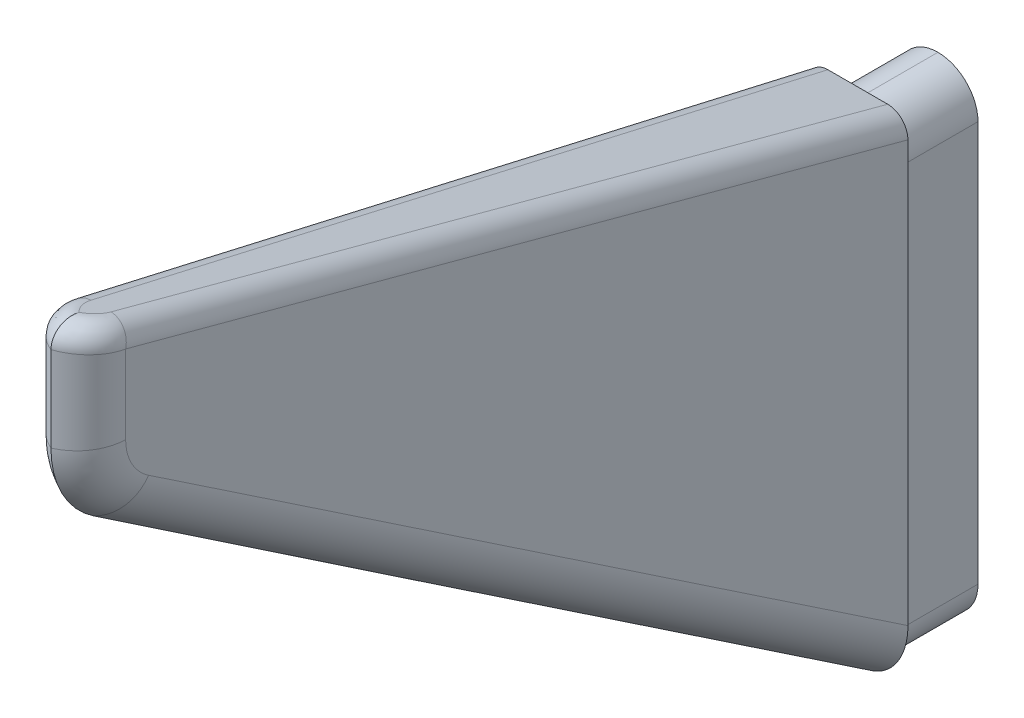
ISO-10303-21;
HEADER;
FILE_DESCRIPTION(('STEP AP214'),'2;1');
FILE_NAME('part.step','',(''),(''),'','','');
FILE_SCHEMA(('AUTOMOTIVE_DESIGN { 1 0 10303 214 1 1 1 1 }'));
ENDSEC;
DATA;
#1=APPLICATION_CONTEXT('core data for automotive mechanical design processes');
#2=APPLICATION_PROTOCOL_DEFINITION('international standard','automotive_design',2000,#1);
#3=PRODUCT_CONTEXT('',#1,'mechanical');
#4=PRODUCT('Part','Part','',(#3));
#5=PRODUCT_RELATED_PRODUCT_CATEGORY('part','',(#4));
#6=PRODUCT_DEFINITION_FORMATION('','',#4);
#7=PRODUCT_DEFINITION_CONTEXT('part definition',#1,'design');
#8=PRODUCT_DEFINITION('design','',#6,#7);
#9=PRODUCT_DEFINITION_SHAPE('','',#8);
#10=(LENGTH_UNIT() NAMED_UNIT(*) SI_UNIT(.MILLI.,.METRE.));
#11=(NAMED_UNIT(*) PLANE_ANGLE_UNIT() SI_UNIT($,.RADIAN.));
#12=(NAMED_UNIT(*) SI_UNIT($,.STERADIAN.) SOLID_ANGLE_UNIT());
#13=UNCERTAINTY_MEASURE_WITH_UNIT(LENGTH_MEASURE(1.E-05),#10,'distance_accuracy_value','');
#14=(GEOMETRIC_REPRESENTATION_CONTEXT(3) GLOBAL_UNCERTAINTY_ASSIGNED_CONTEXT((#13)) GLOBAL_UNIT_ASSIGNED_CONTEXT((#10,
#11,#12)) REPRESENTATION_CONTEXT('',''));
#15=CARTESIAN_POINT('',(0.,0.,0.));
#16=DIRECTION('',(0.,0.,1.));
#17=DIRECTION('',(1.,0.,0.));
#18=AXIS2_PLACEMENT_3D('',#15,#16,#17);
#19=CARTESIAN_POINT('',(-2.,12.,-4.));
#20=DIRECTION('',(-1.,0.,0.));
#21=DIRECTION('',(0.,-1.,0.));
#22=AXIS2_PLACEMENT_3D('',#19,#20,#21);
#23=PLANE('',#22);
#24=DIRECTION('',(0.,-1.,0.));
#25=VECTOR('',#24,1.);
#26=CARTESIAN_POINT('',(-2.,12.,0.));
#27=LINE('',#26,#25);
#28=CARTESIAN_POINT('',(-2.,10.,0.));
#29=VERTEX_POINT('',#28);
#30=CARTESIAN_POINT('',(-2.,-10.,0.));
#31=VERTEX_POINT('',#30);
#32=EDGE_CURVE('E178',#29,#31,#27,.T.);
#33=ORIENTED_EDGE('',*,*,#32,.F.);
#34=DIRECTION('',(0.,0.,1.));
#35=VECTOR('',#34,1.);
#36=CARTESIAN_POINT('',(-2.,10.,-4.));
#37=LINE('',#36,#35);
#38=CARTESIAN_POINT('',(-2.,10.,-4.));
#39=VERTEX_POINT('',#38);
#40=EDGE_CURVE('E195',#29,#39,#37,.F.);
#41=ORIENTED_EDGE('',*,*,#40,.T.);
#42=DIRECTION('',(0.,-1.,0.));
#43=VECTOR('',#42,1.);
#44=CARTESIAN_POINT('',(-2.,12.,-4.));
#45=LINE('',#44,#43);
#46=CARTESIAN_POINT('',(-2.,-10.,-4.));
#47=VERTEX_POINT('',#46);
#48=EDGE_CURVE('E177',#39,#47,#45,.T.);
#49=ORIENTED_EDGE('',*,*,#48,.T.);
#50=DIRECTION('',(0.,0.,1.));
#51=VECTOR('',#50,1.);
#52=CARTESIAN_POINT('',(-2.,-10.,-4.));
#53=LINE('',#52,#51);
#54=EDGE_CURVE('E193',#47,#31,#53,.T.);
#55=ORIENTED_EDGE('',*,*,#54,.T.);
#56=EDGE_LOOP('',(#33,#41,#49,#55));
#57=FACE_BOUND('',#56,.T.);
#58=ADVANCED_FACE('F35',(#57),#23,.T.);
#59=CARTESIAN_POINT('',(2.,12.,-4.));
#60=DIRECTION('',(1.,0.,0.));
#61=DIRECTION('',(0.,1.,0.));
#62=AXIS2_PLACEMENT_3D('',#59,#60,#61);
#63=PLANE('',#62);
#64=DIRECTION('',(0.,1.,0.));
#65=VECTOR('',#64,1.);
#66=CARTESIAN_POINT('',(2.,12.,-4.));
#67=LINE('',#66,#65);
#68=CARTESIAN_POINT('',(2.,-10.,-4.));
#69=VERTEX_POINT('',#68);
#70=CARTESIAN_POINT('',(2.,10.,-4.));
#71=VERTEX_POINT('',#70);
#72=EDGE_CURVE('E188',#69,#71,#67,.T.);
#73=ORIENTED_EDGE('',*,*,#72,.T.);
#74=DIRECTION('',(0.,0.,1.));
#75=VECTOR('',#74,1.);
#76=CARTESIAN_POINT('',(2.,10.,-4.));
#77=LINE('',#76,#75);
#78=CARTESIAN_POINT('',(2.,10.,0.));
#79=VERTEX_POINT('',#78);
#80=EDGE_CURVE('E167',#71,#79,#77,.T.);
#81=ORIENTED_EDGE('',*,*,#80,.T.);
#82=DIRECTION('',(0.,1.,0.));
#83=VECTOR('',#82,1.);
#84=CARTESIAN_POINT('',(2.,12.,0.));
#85=LINE('',#84,#83);
#86=CARTESIAN_POINT('',(2.,-10.,0.));
#87=VERTEX_POINT('',#86);
#88=EDGE_CURVE('E171',#87,#79,#85,.T.);
#89=ORIENTED_EDGE('',*,*,#88,.F.);
#90=DIRECTION('',(0.,0.,1.));
#91=VECTOR('',#90,1.);
#92=CARTESIAN_POINT('',(2.,-10.,-4.));
#93=LINE('',#92,#91);
#94=EDGE_CURVE('E156',#87,#69,#93,.F.);
#95=ORIENTED_EDGE('',*,*,#94,.T.);
#96=EDGE_LOOP('',(#73,#81,#89,#95));
#97=FACE_BOUND('',#96,.T.);
#98=ADVANCED_FACE('F172',(#97),#63,.T.);
#99=CARTESIAN_POINT('',(0.,0.,-4.));
#100=DIRECTION('',(0.,0.,1.));
#101=DIRECTION('',(1.,0.,0.));
#102=AXIS2_PLACEMENT_3D('',#99,#100,#101);
#103=PLANE('',#102);
#104=ORIENTED_EDGE('',*,*,#48,.F.);
#105=CARTESIAN_POINT('',(0.,10.,-4.));
#106=DIRECTION('',(0.,0.,1.));
#107=DIRECTION('',(1.,0.,0.));
#108=AXIS2_PLACEMENT_3D('',#105,#106,#107);
#109=CIRCLE('',#108,2.);
#110=CARTESIAN_POINT('',(0.,12.,-4.));
#111=VERTEX_POINT('',#110);
#112=EDGE_CURVE('E168',#39,#111,#109,.F.);
#113=ORIENTED_EDGE('',*,*,#112,.T.);
#114=CARTESIAN_POINT('',(0.,10.,-4.));
#115=DIRECTION('',(0.,0.,1.));
#116=DIRECTION('',(1.,0.,0.));
#117=AXIS2_PLACEMENT_3D('',#114,#115,#116);
#118=CIRCLE('',#117,2.);
#119=EDGE_CURVE('E201',#111,#71,#118,.F.);
#120=ORIENTED_EDGE('',*,*,#119,.T.);
#121=ORIENTED_EDGE('',*,*,#72,.F.);
#122=CARTESIAN_POINT('',(0.,-10.,-4.));
#123=DIRECTION('',(0.,0.,1.));
#124=DIRECTION('',(1.,0.,0.));
#125=AXIS2_PLACEMENT_3D('',#122,#123,#124);
#126=CIRCLE('',#125,2.);
#127=CARTESIAN_POINT('',(0.,-12.,-4.));
#128=VERTEX_POINT('',#127);
#129=EDGE_CURVE('E163',#69,#128,#126,.F.);
#130=ORIENTED_EDGE('',*,*,#129,.T.);
#131=CARTESIAN_POINT('',(0.,-10.,-4.));
#132=DIRECTION('',(0.,0.,1.));
#133=DIRECTION('',(1.,0.,0.));
#134=AXIS2_PLACEMENT_3D('',#131,#132,#133);
#135=CIRCLE('',#134,2.);
#136=EDGE_CURVE('E198',#128,#47,#135,.F.);
#137=ORIENTED_EDGE('',*,*,#136,.T.);
#138=EDGE_LOOP('',(#104,#113,#120,#121,#130,#137));
#139=FACE_BOUND('',#138,.T.);
#140=ADVANCED_FACE('F362',(#139),#103,.F.);
#141=CARTESIAN_POINT('',(0.,10.,-4.));
#142=DIRECTION('',(0.,0.,1.));
#143=DIRECTION('',(1.,0.,0.));
#144=AXIS2_PLACEMENT_3D('',#141,#142,#143);
#145=CYLINDRICAL_SURFACE('',#144,2.);
#146=ORIENTED_EDGE('',*,*,#80,.F.);
#147=ORIENTED_EDGE('',*,*,#119,.F.);
#148=DIRECTION('',(0.,0.,1.));
#149=VECTOR('',#148,1.);
#150=CARTESIAN_POINT('',(0.,12.,-4.));
#151=LINE('',#150,#149);
#152=CARTESIAN_POINT('',(0.,12.,0.));
#153=VERTEX_POINT('',#152);
#154=EDGE_CURVE('E206',#153,#111,#151,.F.);
#155=ORIENTED_EDGE('',*,*,#154,.F.);
#156=CARTESIAN_POINT('',(0.,10.,0.));
#157=DIRECTION('',(0.,0.,1.));
#158=DIRECTION('',(1.,0.,0.));
#159=AXIS2_PLACEMENT_3D('',#156,#157,#158);
#160=CIRCLE('',#159,2.);
#161=EDGE_CURVE('E184',#79,#153,#160,.T.);
#162=ORIENTED_EDGE('',*,*,#161,.F.);
#163=EDGE_LOOP('',(#146,#147,#155,#162));
#164=FACE_BOUND('',#163,.T.);
#165=ADVANCED_FACE('F364',(#164),#145,.T.);
#166=CARTESIAN_POINT('',(0.,10.,-4.));
#167=DIRECTION('',(0.,0.,1.));
#168=DIRECTION('',(1.,0.,0.));
#169=AXIS2_PLACEMENT_3D('',#166,#167,#168);
#170=CYLINDRICAL_SURFACE('',#169,2.);
#171=ORIENTED_EDGE('',*,*,#112,.F.);
#172=ORIENTED_EDGE('',*,*,#40,.F.);
#173=CARTESIAN_POINT('',(0.,10.,0.));
#174=DIRECTION('',(0.,0.,1.));
#175=DIRECTION('',(1.,0.,0.));
#176=AXIS2_PLACEMENT_3D('',#173,#174,#175);
#177=CIRCLE('',#176,2.);
#178=EDGE_CURVE('E186',#153,#29,#177,.T.);
#179=ORIENTED_EDGE('',*,*,#178,.F.);
#180=ORIENTED_EDGE('',*,*,#154,.T.);
#181=EDGE_LOOP('',(#171,#172,#179,#180));
#182=FACE_BOUND('',#181,.T.);
#183=ADVANCED_FACE('F359',(#182),#170,.T.);
#184=CARTESIAN_POINT('',(0.,-10.,-4.));
#185=DIRECTION('',(0.,0.,1.));
#186=DIRECTION('',(1.,0.,0.));
#187=AXIS2_PLACEMENT_3D('',#184,#185,#186);
#188=CYLINDRICAL_SURFACE('',#187,2.);
#189=ORIENTED_EDGE('',*,*,#54,.F.);
#190=ORIENTED_EDGE('',*,*,#136,.F.);
#191=DIRECTION('',(0.,0.,1.));
#192=VECTOR('',#191,1.);
#193=CARTESIAN_POINT('',(0.,-12.,-4.));
#194=LINE('',#193,#192);
#195=CARTESIAN_POINT('',(0.,-12.,0.));
#196=VERTEX_POINT('',#195);
#197=EDGE_CURVE('E209',#196,#128,#194,.F.);
#198=ORIENTED_EDGE('',*,*,#197,.F.);
#199=CARTESIAN_POINT('',(0.,-10.,0.));
#200=DIRECTION('',(0.,0.,1.));
#201=DIRECTION('',(1.,0.,0.));
#202=AXIS2_PLACEMENT_3D('',#199,#200,#201);
#203=CIRCLE('',#202,2.);
#204=EDGE_CURVE('E183',#31,#196,#203,.T.);
#205=ORIENTED_EDGE('',*,*,#204,.F.);
#206=EDGE_LOOP('',(#189,#190,#198,#205));
#207=FACE_BOUND('',#206,.T.);
#208=ADVANCED_FACE('F371',(#207),#188,.T.);
#209=CARTESIAN_POINT('',(0.,-10.,-4.));
#210=DIRECTION('',(0.,0.,1.));
#211=DIRECTION('',(1.,0.,0.));
#212=AXIS2_PLACEMENT_3D('',#209,#210,#211);
#213=CYLINDRICAL_SURFACE('',#212,2.);
#214=ORIENTED_EDGE('',*,*,#129,.F.);
#215=ORIENTED_EDGE('',*,*,#94,.F.);
#216=CARTESIAN_POINT('',(0.,-10.,0.));
#217=DIRECTION('',(0.,0.,1.));
#218=DIRECTION('',(1.,0.,0.));
#219=AXIS2_PLACEMENT_3D('',#216,#217,#218);
#220=CIRCLE('',#219,2.);
#221=EDGE_CURVE('E161',#196,#87,#220,.T.);
#222=ORIENTED_EDGE('',*,*,#221,.F.);
#223=ORIENTED_EDGE('',*,*,#197,.T.);
#224=EDGE_LOOP('',(#214,#215,#222,#223));
#225=FACE_BOUND('',#224,.T.);
#226=ADVANCED_FACE('F158',(#225),#213,.T.);
#227=CARTESIAN_POINT('',(2.5,10.,0.));
#228=DIRECTION('',(0.,0.,1.));
#229=DIRECTION('',(1.,0.,0.));
#230=AXIS2_PLACEMENT_3D('',#227,#228,#229);
#231=PLANE('',#230);
#232=ORIENTED_EDGE('',*,*,#161,.T.);
#233=ORIENTED_EDGE('',*,*,#178,.T.);
#234=ORIENTED_EDGE('',*,*,#32,.T.);
#235=ORIENTED_EDGE('',*,*,#204,.T.);
#236=ORIENTED_EDGE('',*,*,#221,.T.);
#237=ORIENTED_EDGE('',*,*,#88,.T.);
#238=EDGE_LOOP('',(#232,#233,#234,#235,#236,#237));
#239=FACE_BOUND('',#238,.T.);
#240=DIRECTION('',(0.,1.,0.));
#241=VECTOR('',#240,1.);
#242=CARTESIAN_POINT('',(-2.5,10.,0.));
#243=LINE('',#242,#241);
#244=CARTESIAN_POINT('',(-2.5,-9.5439580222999,0.));
#245=VERTEX_POINT('',#244);
#246=CARTESIAN_POINT('',(-2.5,11.462859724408,0.));
#247=VERTEX_POINT('',#246);
#248=EDGE_CURVE('E285',#245,#247,#243,.T.);
#249=ORIENTED_EDGE('',*,*,#248,.T.);
#250=CARTESIAN_POINT('',(-1.49965720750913,11.4693863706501,0.));
#251=DIRECTION('',(0.,0.,1.));
#252=DIRECTION('',(-0.104451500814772,-0.994529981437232,0.));
#253=AXIS2_PLACEMENT_3D('',#250,#251,#252);
#254=ELLIPSE('',#253,1.03094624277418,1.);
#255=CARTESIAN_POINT('',(-1.49332225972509,12.5,0.));
#256=VERTEX_POINT('',#255);
#257=EDGE_CURVE('E44',#247,#256,#254,.F.);
#258=ORIENTED_EDGE('',*,*,#257,.T.);
#259=DIRECTION('',(-1.,0.,0.));
#260=VECTOR('',#259,1.);
#261=CARTESIAN_POINT('',(2.5,12.5,0.));
#262=LINE('',#261,#260);
#263=CARTESIAN_POINT('',(1.49332225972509,12.5,0.));
#264=VERTEX_POINT('',#263);
#265=EDGE_CURVE('E211',#264,#256,#262,.T.);
#266=ORIENTED_EDGE('',*,*,#265,.F.);
#267=CARTESIAN_POINT('',(1.49965720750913,11.4693863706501,0.));
#268=DIRECTION('',(0.,0.,1.));
#269=DIRECTION('',(0.104451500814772,-0.994529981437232,0.));
#270=AXIS2_PLACEMENT_3D('',#267,#268,#269);
#271=ELLIPSE('',#270,1.03094624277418,1.);
#272=CARTESIAN_POINT('',(2.5,11.462859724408,0.));
#273=VERTEX_POINT('',#272);
#274=EDGE_CURVE('E52',#264,#273,#271,.F.);
#275=ORIENTED_EDGE('',*,*,#274,.T.);
#276=DIRECTION('',(0.,1.,0.));
#277=VECTOR('',#276,1.);
#278=CARTESIAN_POINT('',(2.5,-10.,0.));
#279=LINE('',#278,#277);
#280=CARTESIAN_POINT('',(2.5,-9.5439580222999,0.));
#281=VERTEX_POINT('',#280);
#282=EDGE_CURVE('E346',#281,#273,#279,.T.);
#283=ORIENTED_EDGE('',*,*,#282,.F.);
#284=CARTESIAN_POINT('',(-0.000856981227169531,-9.50057573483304,0.));
#285=DIRECTION('',(0.,0.,1.));
#286=DIRECTION('',(-0.0394707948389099,0.999220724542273,0.));
#287=AXIS2_PLACEMENT_3D('',#284,#285,#286);
#288=ELLIPSE('',#287,3.00013859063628,2.5);
#289=CARTESIAN_POINT('',(0.0353142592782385,-12.5,0.));
#290=VERTEX_POINT('',#289);
#291=EDGE_CURVE('E227',#281,#290,#288,.F.);
#292=ORIENTED_EDGE('',*,*,#291,.T.);
#293=DIRECTION('',(-1.,0.,0.));
#294=VECTOR('',#293,1.);
#295=CARTESIAN_POINT('',(2.5,-12.5,0.));
#296=LINE('',#295,#294);
#297=CARTESIAN_POINT('',(-0.0353142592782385,-12.5,0.));
#298=VERTEX_POINT('',#297);
#299=EDGE_CURVE('E343',#290,#298,#296,.T.);
#300=ORIENTED_EDGE('',*,*,#299,.T.);
#301=CARTESIAN_POINT('',(0.000856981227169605,-9.50057573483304,0.));
#302=DIRECTION('',(0.,0.,1.));
#303=DIRECTION('',(0.03947079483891,0.999220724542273,0.));
#304=AXIS2_PLACEMENT_3D('',#301,#302,#303);
#305=ELLIPSE('',#304,3.00013859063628,2.5);
#306=EDGE_CURVE('E229',#298,#245,#305,.F.);
#307=ORIENTED_EDGE('',*,*,#306,.T.);
#308=EDGE_LOOP('',(#249,#258,#266,#275,#283,#292,#300,#307));
#309=FACE_BOUND('',#308,.T.);
#310=ADVANCED_FACE('F180',(#239,#309),#231,.F.);
#311=CARTESIAN_POINT('',(2.5,12.5,0.));
#312=DIRECTION('',(0.,-0.970295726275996,0.241921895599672));
#313=DIRECTION('',(0.,-0.241921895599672,-0.970295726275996));
#314=AXIS2_PLACEMENT_3D('',#311,#312,#313);
#315=PLANE('',#314);
#316=ORIENTED_EDGE('',*,*,#265,.T.);
#317=DIRECTION('',(0.0253998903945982,0.241843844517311,0.969982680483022));
#318=VECTOR('',#317,1.);
#319=CARTESIAN_POINT('',(-0.497193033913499,21.9845968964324,38.0406403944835));
#320=LINE('',#319,#318);
#321=CARTESIAN_POINT('',(-0.50356398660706,21.9239361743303,37.7973435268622));
#322=VERTEX_POINT('',#321);
#323=EDGE_CURVE('E292',#256,#322,#320,.T.);
#324=ORIENTED_EDGE('',*,*,#323,.T.);
#325=CARTESIAN_POINT('',(0.995922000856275,21.9141462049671,37.7580781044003));
#326=DIRECTION('',(0.,-0.970295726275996,0.241921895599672));
#327=DIRECTION('',(0.,0.241921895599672,0.970295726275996));
#328=AXIS2_PLACEMENT_3D('',#325,#326,#327);
#329=ELLIPSE('',#328,1.54592044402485,1.5);
#330=CARTESIAN_POINT('',(0.,22.1938094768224,38.8797462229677));
#331=VERTEX_POINT('',#330);
#332=EDGE_CURVE('E289',#322,#331,#329,.F.);
#333=ORIENTED_EDGE('',*,*,#332,.T.);
#334=CARTESIAN_POINT('',(-0.995922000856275,21.9141462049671,37.7580781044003));
#335=DIRECTION('',(0.,-0.970295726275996,0.241921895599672));
#336=DIRECTION('',(0.,0.241921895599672,0.970295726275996));
#337=AXIS2_PLACEMENT_3D('',#334,#335,#336);
#338=ELLIPSE('',#337,1.54592044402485,1.5);
#339=CARTESIAN_POINT('',(0.50356398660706,21.9239361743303,37.7973435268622));
#340=VERTEX_POINT('',#339);
#341=EDGE_CURVE('E287',#331,#340,#338,.F.);
#342=ORIENTED_EDGE('',*,*,#341,.T.);
#343=DIRECTION('',(0.0253998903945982,-0.241843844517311,-0.969982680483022));
#344=VECTOR('',#343,1.);
#345=CARTESIAN_POINT('',(1.49397172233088,12.493816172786,-0.0248019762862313));
#346=LINE('',#345,#344);
#347=EDGE_CURVE('E231',#340,#264,#346,.T.);
#348=ORIENTED_EDGE('',*,*,#347,.T.);
#349=EDGE_LOOP('',(#316,#324,#333,#342,#348));
#350=FACE_BOUND('',#349,.T.);
#351=ADVANCED_FACE('F319',(#350),#315,.F.);
#352=CARTESIAN_POINT('',(2.5,-12.5,0.));
#353=DIRECTION('',(0.,0.833493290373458,-0.552529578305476));
#354=DIRECTION('',(0.,0.552529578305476,0.833493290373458));
#355=AXIS2_PLACEMENT_3D('',#352,#353,#354);
#356=PLANE('',#355);
#357=DIRECTION('',(-0.0218205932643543,0.552398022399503,0.833294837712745));
#358=VECTOR('',#357,1.);
#359=CARTESIAN_POINT('',(0.0364877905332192,-12.529708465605,-0.0448153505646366));
#360=LINE('',#359,#358);
#361=CARTESIAN_POINT('',(0.,-11.6060038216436,1.3485971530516));
#362=VERTEX_POINT('',#361);
#363=EDGE_CURVE('E223',#290,#362,#360,.T.);
#364=ORIENTED_EDGE('',*,*,#363,.T.);
#365=DIRECTION('',(-0.0218205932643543,-0.552398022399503,-0.833294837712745));
#366=VECTOR('',#365,1.);
#367=CARTESIAN_POINT('',(-0.0364877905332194,-12.529708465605,-0.0448153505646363));
#368=LINE('',#367,#366);
#369=EDGE_CURVE('E225',#362,#298,#368,.T.);
#370=ORIENTED_EDGE('',*,*,#369,.T.);
#371=ORIENTED_EDGE('',*,*,#299,.F.);
#372=EDGE_LOOP('',(#364,#370,#371));
#373=FACE_BOUND('',#372,.T.);
#374=ADVANCED_FACE('F386',(#373),#356,.F.);
#375=CARTESIAN_POINT('',(2.5,-10.,0.));
#376=DIRECTION('',(0.999657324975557,0.,0.0261769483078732));
#377=DIRECTION('',(0.0261769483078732,0.,-0.999657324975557));
#378=AXIS2_PLACEMENT_3D('',#375,#376,#377);
#379=PLANE('',#378);
#380=ORIENTED_EDGE('',*,*,#282,.T.);
#381=DIRECTION('',(-0.0253998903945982,0.241843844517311,0.969982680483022));
#382=VECTOR('',#381,1.);
#383=CARTESIAN_POINT('',(2.63184220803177,10.2075304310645,-5.03485079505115));
#384=LINE('',#383,#382);
#385=CARTESIAN_POINT('',(1.50322131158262,20.9536404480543,38.0654423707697));
#386=VERTEX_POINT('',#385);
#387=EDGE_CURVE('E11',#273,#386,#384,.T.);
#388=ORIENTED_EDGE('',*,*,#387,.T.);
#389=DIRECTION('',(0.,-1.,0.));
#390=VECTOR('',#389,1.);
#391=CARTESIAN_POINT('',(1.50322131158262,-10.,38.0654423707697));
#392=LINE('',#391,#390);
#393=CARTESIAN_POINT('',(1.50322131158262,17.0320913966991,38.0654423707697));
#394=VERTEX_POINT('',#393);
#395=EDGE_CURVE('E221',#386,#394,#392,.T.);
#396=ORIENTED_EDGE('',*,*,#395,.T.);
#397=CARTESIAN_POINT('',(1.56868611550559,17.0320913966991,35.5654423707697));
#398=DIRECTION('',(0.999657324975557,0.,0.0261769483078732));
#399=DIRECTION('',(-0.0261769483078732,0.,0.999657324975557));
#400=AXIS2_PLACEMENT_3D('',#397,#398,#399);
#401=ELLIPSE('',#400,2.50085698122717,2.5);
#402=CARTESIAN_POINT('',(1.53251487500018,14.9483581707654,36.9467663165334));
#403=VERTEX_POINT('',#402);
#404=EDGE_CURVE('E219',#394,#403,#401,.T.);
#405=ORIENTED_EDGE('',*,*,#404,.T.);
#406=DIRECTION('',(0.0218205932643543,-0.552398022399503,-0.833294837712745));
#407=VECTOR('',#406,1.);
#408=CARTESIAN_POINT('',(2.50549697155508,-9.68311630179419,-0.209920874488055));
#409=LINE('',#408,#407);
#410=EDGE_CURVE('E217',#403,#281,#409,.T.);
#411=ORIENTED_EDGE('',*,*,#410,.T.);
#412=EDGE_LOOP('',(#380,#388,#396,#405,#411));
#413=FACE_BOUND('',#412,.T.);
#414=ADVANCED_FACE('F269',(#413),#379,.T.);
#415=CARTESIAN_POINT('',(-2.5,10.,0.));
#416=DIRECTION('',(-0.999657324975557,0.,0.0261769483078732));
#417=DIRECTION('',(0.0261769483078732,0.,0.999657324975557));
#418=AXIS2_PLACEMENT_3D('',#415,#416,#417);
#419=PLANE('',#418);
#420=DIRECTION('',(0.,-1.,0.));
#421=VECTOR('',#420,1.);
#422=CARTESIAN_POINT('',(-1.50322131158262,22.597784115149,38.0654423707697));
#423=LINE('',#422,#421);
#424=CARTESIAN_POINT('',(-1.50322131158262,17.0320913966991,38.0654423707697));
#425=VERTEX_POINT('',#424);
#426=CARTESIAN_POINT('',(-1.50322131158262,20.9536404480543,38.0654423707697));
#427=VERTEX_POINT('',#426);
#428=EDGE_CURVE('E215',#425,#427,#423,.F.);
#429=ORIENTED_EDGE('',*,*,#428,.T.);
#430=DIRECTION('',(0.0253998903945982,0.241843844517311,0.969982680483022));
#431=VECTOR('',#430,1.);
#432=CARTESIAN_POINT('',(-2.49362904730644,11.52352044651,0.243296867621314));
#433=LINE('',#432,#431);
#434=EDGE_CURVE('E60',#427,#247,#433,.F.);
#435=ORIENTED_EDGE('',*,*,#434,.T.);
#436=ORIENTED_EDGE('',*,*,#248,.F.);
#437=DIRECTION('',(-0.0218205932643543,-0.552398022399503,-0.833294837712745));
#438=VECTOR('',#437,1.);
#439=CARTESIAN_POINT('',(-1.53368840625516,14.9186497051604,36.9019509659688));
#440=LINE('',#439,#438);
#441=CARTESIAN_POINT('',(-1.53251487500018,14.9483581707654,36.9467663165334));
#442=VERTEX_POINT('',#441);
#443=EDGE_CURVE('E205',#245,#442,#440,.F.);
#444=ORIENTED_EDGE('',*,*,#443,.T.);
#445=CARTESIAN_POINT('',(-1.56868611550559,17.0320913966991,35.5654423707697));
#446=DIRECTION('',(-0.999657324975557,0.,0.0261769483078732));
#447=DIRECTION('',(-0.0261769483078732,0.,-0.999657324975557));
#448=AXIS2_PLACEMENT_3D('',#445,#446,#447);
#449=ELLIPSE('',#448,2.50085698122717,2.5);
#450=EDGE_CURVE('E213',#442,#425,#449,.T.);
#451=ORIENTED_EDGE('',*,*,#450,.T.);
#452=EDGE_LOOP('',(#429,#435,#436,#444,#451));
#453=FACE_BOUND('',#452,.T.);
#454=ADVANCED_FACE('F392',(#453),#419,.T.);
#455=CARTESIAN_POINT('',(0.0063536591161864,-9.68311630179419,-0.275363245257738));
#456=DIRECTION('',(-0.0218205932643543,0.552398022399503,0.833294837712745));
#457=DIRECTION('',(0.,-0.833493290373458,0.552529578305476));
#458=AXIS2_PLACEMENT_3D('',#455,#456,#457);
#459=CYLINDRICAL_SURFACE('',#458,2.5);
#460=ORIENTED_EDGE('',*,*,#291,.F.);
#461=ORIENTED_EDGE('',*,*,#410,.F.);
#462=CARTESIAN_POINT('',(-0.966628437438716,14.9483581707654,36.8813239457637));
#463=DIRECTION('',(-0.0218205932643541,0.552398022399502,0.833294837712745));
#464=DIRECTION('',(0.,-0.833493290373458,0.552529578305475));
#465=AXIS2_PLACEMENT_3D('',#462,#463,#464);
#466=CIRCLE('',#465,2.5);
#467=CARTESIAN_POINT('',(4.36282954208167E-13,13.0384227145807,38.1727479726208));
#468=VERTEX_POINT('',#467);
#469=EDGE_CURVE('E282',#468,#403,#466,.T.);
#470=ORIENTED_EDGE('',*,*,#469,.F.);
#471=CARTESIAN_POINT('',(0.,-9.52227059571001,-0.0327267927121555));
#472=DIRECTION('',(1.,0.,0.));
#473=DIRECTION('',(0.,0.552529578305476,0.833493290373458));
#474=AXIS2_PLACEMENT_3D('',#471,#472,#473);
#475=ELLIPSE('',#474,114.570670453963,2.5);
#476=EDGE_CURVE('E279',#362,#468,#475,.F.);
#477=ORIENTED_EDGE('',*,*,#476,.F.);
#478=ORIENTED_EDGE('',*,*,#363,.F.);
#479=EDGE_LOOP('',(#460,#461,#470,#477,#478));
#480=FACE_BOUND('',#479,.T.);
#481=ADVANCED_FACE('F262',(#480),#459,.T.);
#482=CARTESIAN_POINT('',(-0.995922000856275,17.0320913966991,40.5));
#483=CARTESIAN_POINT('',(1.43947017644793,17.0320913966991,40.5));
#484=CARTESIAN_POINT('',(1.50322131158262,17.0320913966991,38.0654423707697));
#485=CARTESIAN_POINT('',(-0.995922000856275,16.8139251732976,40.5));
#486=CARTESIAN_POINT('',(1.43947017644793,16.8167077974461,40.5));
#487=CARTESIAN_POINT('',(1.50322131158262,16.9230082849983,38.0654423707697));
#488=CARTESIAN_POINT('',(-0.995734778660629,16.595758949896,40.4857005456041));
#489=CARTESIAN_POINT('',(1.4398350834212,16.6013084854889,40.486064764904));
#490=CARTESIAN_POINT('',(1.50340853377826,16.8139251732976,38.0582926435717));
#491=CARTESIAN_POINT('',(-0.994989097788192,16.1631594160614,40.4287477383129));
#492=CARTESIAN_POINT('',(1.44128871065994,16.1740881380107,40.4305529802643));
#493=CARTESIAN_POINT('',(1.5041542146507,16.5976254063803,38.0298162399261));
#494=CARTESIAN_POINT('',(-0.994430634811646,15.9487261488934,40.3860940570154));
#495=CARTESIAN_POINT('',(1.44237764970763,15.9622367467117,40.3889680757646));
#496=CARTESIAN_POINT('',(1.50471267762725,16.4904087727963,38.0084893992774));
#497=CARTESIAN_POINT('',(-0.992952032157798,15.5272614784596,40.2731629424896));
#498=CARTESIAN_POINT('',(1.44526186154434,15.5456051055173,40.2788244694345));
#499=CARTESIAN_POINT('',(1.50619128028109,16.2796764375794,37.9520238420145));
#500=CARTESIAN_POINT('',(-0.99203188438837,15.3202302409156,40.2028848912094));
#501=CARTESIAN_POINT('',(1.44705755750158,15.3407976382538,40.2102496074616));
#502=CARTESIAN_POINT('',(1.50711142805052,16.1761608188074,37.9168848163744));
#503=CARTESIAN_POINT('',(-0.989845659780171,14.9171118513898,40.0359077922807));
#504=CARTESIAN_POINT('',(1.4513265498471,14.9416413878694,40.0472233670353));
#505=CARTESIAN_POINT('',(1.50929765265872,15.9746016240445,37.83339626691));
#506=CARTESIAN_POINT('',(-0.988579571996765,14.7210250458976,39.9392079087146));
#507=CARTESIAN_POINT('',(1.4538004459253,14.7472703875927,39.9527490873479));
#508=CARTESIAN_POINT('',(1.51056374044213,15.8765582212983,37.785046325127));
#509=CARTESIAN_POINT('',(-0.985723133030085,14.3431504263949,39.7210419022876));
#510=CARTESIAN_POINT('',(1.45938621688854,14.3722188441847,39.7394371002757));
#511=CARTESIAN_POINT('',(1.51342017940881,15.687620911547,37.6759633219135));
#512=CARTESIAN_POINT('',(-0.98413276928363,14.1613631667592,39.5995748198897));
#513=CARTESIAN_POINT('',(1.46249882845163,14.1915226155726,39.6205712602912));
#514=CARTESIAN_POINT('',(1.51501054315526,15.5967272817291,37.6152297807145));
#515=CARTESIAN_POINT('',(-0.980654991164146,13.8151978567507,39.3339528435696));
#516=CARTESIAN_POINT('',(1.46931202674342,13.8468474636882,39.3603857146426));
#517=CARTESIAN_POINT('',(1.51848832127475,15.4236446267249,37.4824187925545));
#518=CARTESIAN_POINT('',(-0.978767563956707,13.6508205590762,39.1897969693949));
#519=CARTESIAN_POINT('',(1.4730134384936,13.682860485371,39.2190345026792));
#520=CARTESIAN_POINT('',(1.52037574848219,15.3414559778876,37.4103408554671));
#521=CARTESIAN_POINT('',(-0.974727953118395,13.3422875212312,38.8812639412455));
#522=CARTESIAN_POINT('',(1.48094449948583,13.3743783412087,38.9161595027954));
#523=CARTESIAN_POINT('',(1.5244153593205,15.1871894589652,37.2560743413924));
#524=CARTESIAN_POINT('',(-0.972575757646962,13.1981326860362,38.7168858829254));
#525=CARTESIAN_POINT('',(1.48517500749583,13.2298833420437,38.7546029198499));
#526=CARTESIAN_POINT('',(1.52656755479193,15.1151120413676,37.1738853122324));
#527=CARTESIAN_POINT('',(-0.968043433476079,12.9325109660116,38.370720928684));
#528=CARTESIAN_POINT('',(1.49409557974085,12.9628621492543,38.4139400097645));
#529=CARTESIAN_POINT('',(1.53109987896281,14.9823011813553,37.0008028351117));
#530=CARTESIAN_POINT('',(-0.965663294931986,12.8110450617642,38.1889332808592));
#531=CARTESIAN_POINT('',(1.49878647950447,12.8403443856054,38.2348017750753));
#532=CARTESIAN_POINT('',(1.53348001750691,14.9215682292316,36.9099090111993));
#533=CARTESIAN_POINT('',(-0.960715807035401,12.5928794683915,37.8110594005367));
#534=CARTESIAN_POINT('',(1.50855114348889,12.619414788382,37.8619043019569));
#535=CARTESIAN_POINT('',(1.53842750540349,14.8124854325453,36.720972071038));
#536=CARTESIAN_POINT('',(-0.958148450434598,12.4961807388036,37.6149726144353));
#537=CARTESIAN_POINT('',(1.51362566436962,12.5210191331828,37.6681161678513));
#538=CARTESIAN_POINT('',(1.5409948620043,14.7641360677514,36.6229286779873));
#539=CARTESIAN_POINT('',(-0.952870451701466,12.3292040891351,37.2118553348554));
#540=CARTESIAN_POINT('',(1.52407394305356,12.3500921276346,37.2691125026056));
#541=CARTESIAN_POINT('',(1.54627286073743,14.6806477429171,36.4213700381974));
#542=CARTESIAN_POINT('',(-0.95015980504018,12.2589270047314,37.0048244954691));
#543=CARTESIAN_POINT('',(1.52944832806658,12.2775836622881,37.0638730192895));
#544=CARTESIAN_POINT('',(1.54898350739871,14.6455092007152,36.3178546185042));
#545=CARTESIAN_POINT('',(-0.944641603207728,12.1459962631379,36.5833612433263));
#546=CARTESIAN_POINT('',(1.54040698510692,12.1597759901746,36.6453787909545));
#547=CARTESIAN_POINT('',(1.55450170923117,14.5890438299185,36.1071229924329));
#548=CARTESIAN_POINT('',(-0.941834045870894,12.1033432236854,36.3689286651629));
#549=CARTESIAN_POINT('',(1.5459917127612,12.1145048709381,36.432106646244));
#550=CARTESIAN_POINT('',(1.557309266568,14.5677173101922,35.9999067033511));
#551=CARTESIAN_POINT('',(-0.936170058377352,12.0463906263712,35.9363307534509));
#552=CARTESIAN_POINT('',(1.55727732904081,12.0520737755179,36.0011263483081));
#553=CARTESIAN_POINT('',(1.56297325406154,14.5392410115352,35.7836077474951));
#554=CARTESIAN_POINT('',(-0.93331362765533,12.0320913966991,35.7181653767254));
#555=CARTESIAN_POINT('',(1.56297847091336,12.0349452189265,35.7834085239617));
#556=CARTESIAN_POINT('',(1.56582968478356,14.5320913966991,35.6745250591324));
#557=CARTESIAN_POINT('',(-0.927600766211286,12.0320913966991,35.2818346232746));
#558=CARTESIAN_POINT('',(1.57440028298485,12.0292343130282,35.3472271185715));
#559=CARTESIAN_POINT('',(1.57154254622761,14.5320913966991,35.456359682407));
#560=CARTESIAN_POINT('',(-0.924744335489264,12.0463906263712,35.0636692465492));
#561=CARTESIAN_POINT('',(1.58012098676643,12.0406846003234,35.128762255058));
#562=CARTESIAN_POINT('',(1.57439897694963,14.5392410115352,35.3472769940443));
#563=CARTESIAN_POINT('',(-0.919080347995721,12.1033432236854,34.6310713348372));
#564=CARTESIAN_POINT('',(1.59148396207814,12.0920826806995,34.6948277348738));
#565=CARTESIAN_POINT('',(1.58006296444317,14.5677173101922,35.1309780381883));
#566=CARTESIAN_POINT('',(-0.916272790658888,12.1459962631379,34.4166387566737));
#567=CARTESIAN_POINT('',(1.5971260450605,12.1320621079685,34.4793652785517));
#568=CARTESIAN_POINT('',(1.58287052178,14.5890438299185,35.0237617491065));
#569=CARTESIAN_POINT('',(-0.910754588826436,12.2589270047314,33.995175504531));
#570=CARTESIAN_POINT('',(1.6082341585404,12.2399767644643,34.0551635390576));
#571=CARTESIAN_POINT('',(1.58838872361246,14.6455092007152,34.8130301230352));
#572=CARTESIAN_POINT('',(-0.90804394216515,12.3292040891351,33.7881446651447));
#573=CARTESIAN_POINT('',(1.61369979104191,12.3079404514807,33.8464394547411));
#574=CARTESIAN_POINT('',(1.59109937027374,14.6806477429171,34.709514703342));
#575=CARTESIAN_POINT('',(-0.902765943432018,12.4961807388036,33.3850273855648));
#576=CARTESIAN_POINT('',(1.6243594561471,12.4707882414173,33.4393632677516));
#577=CARTESIAN_POINT('',(1.59637736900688,14.7641360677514,34.5079560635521));
#578=CARTESIAN_POINT('',(-0.900198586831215,12.5928794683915,33.1889405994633));
#579=CARTESIAN_POINT('',(1.62955290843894,12.5656956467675,33.2410333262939));
#580=CARTESIAN_POINT('',(1.59894472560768,14.8124854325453,34.4099126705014));
#581=CARTESIAN_POINT('',(-0.89525109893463,12.8110450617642,32.8110667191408));
#582=CARTESIAN_POINT('',(1.63957650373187,12.7809104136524,32.8582476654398));
#583=CARTESIAN_POINT('',(1.60389221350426,14.9215682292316,34.2209757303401));
#584=CARTESIAN_POINT('',(-0.892870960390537,12.9325109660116,32.6292790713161));
#585=CARTESIAN_POINT('',(1.64440592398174,12.9012342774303,32.6738195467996));
#586=CARTESIAN_POINT('',(1.60627235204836,14.9823011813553,34.1300819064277));
#587=CARTESIAN_POINT('',(-0.888338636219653,13.1981326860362,32.2831141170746));
#588=CARTESIAN_POINT('',(1.65361534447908,13.1652948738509,32.3221259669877));
#589=CARTESIAN_POINT('',(1.61080467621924,15.1151120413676,33.956999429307));
#590=CARTESIAN_POINT('',(-0.88618644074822,13.3422875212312,32.1187360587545));
#591=CARTESIAN_POINT('',(1.65799452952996,13.3090401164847,32.154891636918));
#592=CARTESIAN_POINT('',(1.61295687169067,15.1871894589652,33.8748104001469));
#593=CARTESIAN_POINT('',(-0.882146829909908,13.6508205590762,31.8102030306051));
#594=CARTESIAN_POINT('',(1.66622468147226,13.617518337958,31.8405948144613));
#595=CARTESIAN_POINT('',(1.61699648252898,15.3414559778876,33.7205438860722));
#596=CARTESIAN_POINT('',(-0.88025940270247,13.8151978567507,31.6660471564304));
#597=CARTESIAN_POINT('',(1.67007479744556,13.7822511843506,31.6935648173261));
#598=CARTESIAN_POINT('',(1.61888390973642,15.4236446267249,33.6484659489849));
#599=CARTESIAN_POINT('',(-0.876781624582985,14.1613631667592,31.4004251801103));
#600=CARTESIAN_POINT('',(1.67717694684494,14.1298801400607,31.4223446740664));
#601=CARTESIAN_POINT('',(1.62236168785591,15.5967272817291,33.5156549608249));
#602=CARTESIAN_POINT('',(-0.875191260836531,14.3431504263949,31.2789580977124));
#603=CARTESIAN_POINT('',(1.68042815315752,14.3127674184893,31.2981861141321));
#604=CARTESIAN_POINT('',(1.62395205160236,15.687620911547,33.4549214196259));
#605=CARTESIAN_POINT('',(-0.87233482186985,14.7210250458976,31.0607920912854));
#606=CARTESIAN_POINT('',(1.68627303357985,14.6935298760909,31.074979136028));
#607=CARTESIAN_POINT('',(1.62680849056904,15.8765582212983,33.3458384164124));
#608=CARTESIAN_POINT('',(-0.871068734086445,14.9171118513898,30.9640922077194));
#609=CARTESIAN_POINT('',(1.68886596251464,14.8913880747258,30.9759591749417));
#610=CARTESIAN_POINT('',(1.62807457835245,15.9746016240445,33.2974884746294));
#611=CARTESIAN_POINT('',(-0.868882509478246,15.3202302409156,30.7971151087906));
#612=CARTESIAN_POINT('',(1.69334654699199,15.2986235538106,30.8048525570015));
#613=CARTESIAN_POINT('',(1.63026080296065,16.1761608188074,33.213999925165));
#614=CARTESIAN_POINT('',(-0.867962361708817,15.5272614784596,30.7268370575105));
#615=CARTESIAN_POINT('',(1.69523359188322,15.5079768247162,30.7327892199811));
#616=CARTESIAN_POINT('',(1.63118095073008,16.2796764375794,33.1788608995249));
#617=CARTESIAN_POINT('',(-0.86648375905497,15.9487261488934,30.6139059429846));
#618=CARTESIAN_POINT('',(1.69826743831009,15.9345054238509,30.6169312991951));
#619=CARTESIAN_POINT('',(1.63265955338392,16.4904087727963,33.122395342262));
#620=CARTESIAN_POINT('',(-0.865925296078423,16.1631594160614,30.5712522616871));
#621=CARTESIAN_POINT('',(1.69941380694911,16.1516513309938,30.5731532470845));
#622=CARTESIAN_POINT('',(1.63321801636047,16.5976254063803,33.1010685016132));
#623=CARTESIAN_POINT('',(-0.865179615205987,16.595758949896,30.5142994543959));
#624=CARTESIAN_POINT('',(1.70094489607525,16.5899115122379,30.514683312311));
#625=CARTESIAN_POINT('',(1.63396369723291,16.8139251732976,33.0725920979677));
#626=CARTESIAN_POINT('',(-0.86499239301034,16.8139251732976,30.5));
#627=CARTESIAN_POINT('',(1.7013293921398,16.8109929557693,30.5));
#628=CARTESIAN_POINT('',(1.63415091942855,16.9230082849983,33.0654423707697));
#629=CARTESIAN_POINT('',(-0.86499239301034,17.2502576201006,30.5));
#630=CARTESIAN_POINT('',(1.7013293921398,17.2531898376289,30.5));
#631=CARTESIAN_POINT('',(1.63415091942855,17.1411745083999,33.0654423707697));
#632=CARTESIAN_POINT('',(-0.865179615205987,17.4684238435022,30.5142994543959));
#633=CARTESIAN_POINT('',(1.70094489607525,17.4742712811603,30.514683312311));
#634=CARTESIAN_POINT('',(1.63396369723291,17.2502576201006,33.0725920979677));
#635=CARTESIAN_POINT('',(-0.865925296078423,17.9010233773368,30.5712522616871));
#636=CARTESIAN_POINT('',(1.69941380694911,17.9125314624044,30.5731532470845));
#637=CARTESIAN_POINT('',(1.63321801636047,17.4665573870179,33.1010685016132));
#638=CARTESIAN_POINT('',(-0.86648375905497,18.1154566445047,30.6139059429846));
#639=CARTESIAN_POINT('',(1.69826743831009,18.1296773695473,30.6169312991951));
#640=CARTESIAN_POINT('',(1.63265955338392,17.5737740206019,33.122395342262));
#641=CARTESIAN_POINT('',(-0.867962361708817,18.5369213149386,30.7268370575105));
#642=CARTESIAN_POINT('',(1.69523359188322,18.556205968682,30.7327892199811));
#643=CARTESIAN_POINT('',(1.63118095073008,17.7845063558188,33.1788608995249));
#644=CARTESIAN_POINT('',(-0.868882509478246,18.7439525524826,30.7971151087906));
#645=CARTESIAN_POINT('',(1.69334654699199,18.7655592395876,30.8048525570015));
#646=CARTESIAN_POINT('',(1.63026080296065,17.8880219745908,33.213999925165));
#647=CARTESIAN_POINT('',(-0.871068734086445,19.1470709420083,30.9640922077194));
#648=CARTESIAN_POINT('',(1.68886596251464,19.1727947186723,30.9759591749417));
#649=CARTESIAN_POINT('',(1.62807457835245,18.0895811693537,33.2974884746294));
#650=CARTESIAN_POINT('',(-0.87233482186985,19.3431577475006,31.0607920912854));
#651=CARTESIAN_POINT('',(1.68627303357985,19.3706529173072,31.074979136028));
#652=CARTESIAN_POINT('',(1.62680849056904,18.1876245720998,33.3458384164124));
#653=CARTESIAN_POINT('',(-0.875191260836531,19.7210323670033,31.2789580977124));
#654=CARTESIAN_POINT('',(1.68042815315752,19.7514153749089,31.298186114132));
#655=CARTESIAN_POINT('',(1.62395205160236,18.3765618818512,33.4549214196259));
#656=CARTESIAN_POINT('',(-0.876781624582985,19.902819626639,31.4004251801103));
#657=CARTESIAN_POINT('',(1.67717694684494,19.9343026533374,31.4223446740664));
#658=CARTESIAN_POINT('',(1.62236168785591,18.4674555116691,33.5156549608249));
#659=CARTESIAN_POINT('',(-0.88025940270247,20.2489849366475,31.6660471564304));
#660=CARTESIAN_POINT('',(1.67007479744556,20.2819316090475,31.6935648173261));
#661=CARTESIAN_POINT('',(1.61888390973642,18.6405381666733,33.6484659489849));
#662=CARTESIAN_POINT('',(-0.882146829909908,20.413362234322,31.8102030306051));
#663=CARTESIAN_POINT('',(1.66622468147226,20.4466644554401,31.8405948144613));
#664=CARTESIAN_POINT('',(1.61699648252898,18.7227268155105,33.7205438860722));
#665=CARTESIAN_POINT('',(-0.88618644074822,20.721895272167,32.1187360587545));
#666=CARTESIAN_POINT('',(1.65799452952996,20.7551426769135,32.154891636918));
#667=CARTESIAN_POINT('',(1.61295687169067,18.876993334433,33.8748104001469));
#668=CARTESIAN_POINT('',(-0.888338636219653,20.866050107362,32.2831141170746));
#669=CARTESIAN_POINT('',(1.65361534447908,20.8988879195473,32.3221259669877));
#670=CARTESIAN_POINT('',(1.61080467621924,18.9490707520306,33.956999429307));
#671=CARTESIAN_POINT('',(-0.892870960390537,21.1316718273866,32.6292790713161));
#672=CARTESIAN_POINT('',(1.64440592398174,21.1629485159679,32.6738195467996));
#673=CARTESIAN_POINT('',(1.60627235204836,19.0818816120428,34.1300819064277));
#674=CARTESIAN_POINT('',(-0.89525109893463,21.253137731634,32.8110667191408));
#675=CARTESIAN_POINT('',(1.63957650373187,21.2832723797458,32.8582476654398));
#676=CARTESIAN_POINT('',(1.60389221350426,19.1426145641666,34.2209757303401));
#677=CARTESIAN_POINT('',(-0.900198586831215,21.4713033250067,33.1889405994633));
#678=CARTESIAN_POINT('',(1.62955290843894,21.4984871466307,33.2410333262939));
#679=CARTESIAN_POINT('',(1.59894472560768,19.2516973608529,34.4099126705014));
#680=CARTESIAN_POINT('',(-0.902765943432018,21.5680020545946,33.3850273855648));
#681=CARTESIAN_POINT('',(1.6243594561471,21.5933945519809,33.4393632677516));
#682=CARTESIAN_POINT('',(1.59637736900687,19.3000467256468,34.5079560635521));
#683=CARTESIAN_POINT('',(-0.90804394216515,21.7349787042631,33.7881446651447));
#684=CARTESIAN_POINT('',(1.61369979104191,21.7562423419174,33.8464394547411));
#685=CARTESIAN_POINT('',(1.59109937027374,19.3835350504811,34.709514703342));
#686=CARTESIAN_POINT('',(-0.910754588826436,21.8052557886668,33.995175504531));
#687=CARTESIAN_POINT('',(1.6082341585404,21.8242060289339,34.0551635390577));
#688=CARTESIAN_POINT('',(1.58838872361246,19.4186735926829,34.8130301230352));
#689=CARTESIAN_POINT('',(-0.916272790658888,21.9181865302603,34.4166387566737));
#690=CARTESIAN_POINT('',(1.5971260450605,21.9321206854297,34.4793652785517));
#691=CARTESIAN_POINT('',(1.58287052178,19.4751389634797,35.0237617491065));
#692=CARTESIAN_POINT('',(-0.919080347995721,21.9608395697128,34.6310713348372));
#693=CARTESIAN_POINT('',(1.59148396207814,21.9721001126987,34.6948277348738));
#694=CARTESIAN_POINT('',(1.58006296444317,19.4964654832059,35.1309780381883));
#695=CARTESIAN_POINT('',(-0.924744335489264,22.017792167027,35.0636692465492));
#696=CARTESIAN_POINT('',(1.58012098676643,22.0234981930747,35.128762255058));
#697=CARTESIAN_POINT('',(1.57439897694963,19.524941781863,35.3472769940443));
#698=CARTESIAN_POINT('',(-0.927600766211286,22.0320913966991,35.2818346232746));
#699=CARTESIAN_POINT('',(1.57440028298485,22.03494848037,35.3472271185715));
#700=CARTESIAN_POINT('',(1.57154254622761,19.5320913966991,35.456359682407));
#701=CARTESIAN_POINT('',(-0.93331362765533,22.0320913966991,35.7181653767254));
#702=CARTESIAN_POINT('',(1.56297847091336,22.0292375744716,35.7834085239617));
#703=CARTESIAN_POINT('',(1.56582968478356,19.5320913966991,35.6745250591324));
#704=CARTESIAN_POINT('',(-0.936170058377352,22.017792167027,35.9363307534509));
#705=CARTESIAN_POINT('',(1.55727732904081,22.0121090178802,36.0011263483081));
#706=CARTESIAN_POINT('',(1.56297325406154,19.524941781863,35.7836077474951));
#707=CARTESIAN_POINT('',(-0.941834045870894,21.9608395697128,36.3689286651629));
#708=CARTESIAN_POINT('',(1.5459917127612,21.9496779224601,36.432106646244));
#709=CARTESIAN_POINT('',(1.557309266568,19.4964654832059,35.9999067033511));
#710=CARTESIAN_POINT('',(-0.944641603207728,21.9181865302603,36.5833612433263));
#711=CARTESIAN_POINT('',(1.54040698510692,21.9044068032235,36.6453787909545));
#712=CARTESIAN_POINT('',(1.55450170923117,19.4751389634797,36.1071229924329));
#713=CARTESIAN_POINT('',(-0.95015980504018,21.8052557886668,37.0048244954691));
#714=CARTESIAN_POINT('',(1.52944832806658,21.7865991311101,37.0638730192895));
#715=CARTESIAN_POINT('',(1.54898350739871,19.4186735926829,36.3178546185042));
#716=CARTESIAN_POINT('',(-0.952870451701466,21.7349787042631,37.2118553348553));
#717=CARTESIAN_POINT('',(1.52407394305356,21.7140906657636,37.2691125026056));
#718=CARTESIAN_POINT('',(1.54627286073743,19.3835350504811,36.4213700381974));
#719=CARTESIAN_POINT('',(-0.958148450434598,21.5680020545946,37.6149726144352));
#720=CARTESIAN_POINT('',(1.51362566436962,21.5431636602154,37.6681161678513));
#721=CARTESIAN_POINT('',(1.5409948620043,19.3000467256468,36.6229286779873));
#722=CARTESIAN_POINT('',(-0.9607158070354,21.4713033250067,37.8110594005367));
#723=CARTESIAN_POINT('',(1.50855114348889,21.4447680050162,37.8619043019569));
#724=CARTESIAN_POINT('',(1.53842750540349,19.2516973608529,36.720972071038));
#725=CARTESIAN_POINT('',(-0.965663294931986,21.253137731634,38.1889332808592));
#726=CARTESIAN_POINT('',(1.49878647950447,21.2238384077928,38.2348017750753));
#727=CARTESIAN_POINT('',(1.53348001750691,19.1426145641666,36.9099090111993));
#728=CARTESIAN_POINT('',(-0.968043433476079,21.1316718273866,38.370720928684));
#729=CARTESIAN_POINT('',(1.49409557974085,21.1013206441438,38.4139400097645));
#730=CARTESIAN_POINT('',(1.53109987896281,19.0818816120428,37.0008028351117));
#731=CARTESIAN_POINT('',(-0.972575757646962,20.866050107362,38.7168858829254));
#732=CARTESIAN_POINT('',(1.48517500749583,20.8342994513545,38.7546029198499));
#733=CARTESIAN_POINT('',(1.52656755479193,18.9490707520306,37.1738853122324));
#734=CARTESIAN_POINT('',(-0.974727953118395,20.721895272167,38.8812639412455));
#735=CARTESIAN_POINT('',(1.48094449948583,20.6898044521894,38.9161595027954));
#736=CARTESIAN_POINT('',(1.5244153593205,18.876993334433,37.2560743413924));
#737=CARTESIAN_POINT('',(-0.978767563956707,20.413362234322,39.1897969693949));
#738=CARTESIAN_POINT('',(1.4730134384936,20.3813223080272,39.2190345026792));
#739=CARTESIAN_POINT('',(1.52037574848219,18.7227268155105,37.4103408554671));
#740=CARTESIAN_POINT('',(-0.980654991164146,20.2489849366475,39.3339528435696));
#741=CARTESIAN_POINT('',(1.46931202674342,20.21733532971,39.3603857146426));
#742=CARTESIAN_POINT('',(1.51848832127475,18.6405381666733,37.4824187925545));
#743=CARTESIAN_POINT('',(-0.98413276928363,19.902819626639,39.5995748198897));
#744=CARTESIAN_POINT('',(1.46249882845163,19.8726601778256,39.6205712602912));
#745=CARTESIAN_POINT('',(1.51501054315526,18.4674555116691,37.6152297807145));
#746=CARTESIAN_POINT('',(-0.985723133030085,19.7210323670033,39.7210419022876));
#747=CARTESIAN_POINT('',(1.45938621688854,19.6919639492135,39.7394371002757));
#748=CARTESIAN_POINT('',(1.51342017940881,18.3765618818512,37.6759633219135));
#749=CARTESIAN_POINT('',(-0.988579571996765,19.3431577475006,39.9392079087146));
#750=CARTESIAN_POINT('',(1.4538004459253,19.3169124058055,39.9527490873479));
#751=CARTESIAN_POINT('',(1.51056374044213,18.1876245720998,37.785046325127));
#752=CARTESIAN_POINT('',(-0.989845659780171,19.1470709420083,40.0359077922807));
#753=CARTESIAN_POINT('',(1.4513265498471,19.1225414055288,40.0472233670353));
#754=CARTESIAN_POINT('',(1.50929765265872,18.0895811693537,37.83339626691));
#755=CARTESIAN_POINT('',(-0.99203188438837,18.7439525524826,40.2028848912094));
#756=CARTESIAN_POINT('',(1.44705755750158,18.7233851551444,40.2102496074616));
#757=CARTESIAN_POINT('',(1.50711142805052,17.8880219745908,37.9168848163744));
#758=CARTESIAN_POINT('',(-0.992952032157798,18.5369213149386,40.2731629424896));
#759=CARTESIAN_POINT('',(1.44526186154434,18.5185776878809,40.2788244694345));
#760=CARTESIAN_POINT('',(1.50619128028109,17.7845063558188,37.9520238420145));
#761=CARTESIAN_POINT('',(-0.994430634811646,18.1154566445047,40.3860940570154));
#762=CARTESIAN_POINT('',(1.44237764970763,18.1019460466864,40.3889680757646));
#763=CARTESIAN_POINT('',(1.50471267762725,17.5737740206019,38.0084893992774));
#764=CARTESIAN_POINT('',(-0.994989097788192,17.9010233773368,40.4287477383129));
#765=CARTESIAN_POINT('',(1.44128871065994,17.8900946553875,40.4305529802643));
#766=CARTESIAN_POINT('',(1.5041542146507,17.4665573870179,38.0298162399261));
#767=CARTESIAN_POINT('',(-0.995734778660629,17.4684238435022,40.4857005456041));
#768=CARTESIAN_POINT('',(1.4398350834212,17.4628743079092,40.486064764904));
#769=CARTESIAN_POINT('',(1.50340853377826,17.2502576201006,38.0582926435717));
#770=CARTESIAN_POINT('',(-0.995922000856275,17.2502576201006,40.5));
#771=CARTESIAN_POINT('',(1.43947017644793,17.2474749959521,40.5));
#772=CARTESIAN_POINT('',(1.50322131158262,17.1411745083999,38.0654423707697));
#773=CARTESIAN_POINT('',(-0.995922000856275,17.0320913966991,40.5));
#774=CARTESIAN_POINT('',(1.43947017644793,17.0320913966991,40.5));
#775=CARTESIAN_POINT('',(1.50322131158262,17.0320913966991,38.0654423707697));
#776=(BOUNDED_SURFACE() B_SPLINE_SURFACE(3,2,((#482,#483,#484),(#485,#486,#487),(#488,#489,
#490),(#491,#492,#493),(#494,#495,#496),(#497,#498,#499),(#500,#501,#502),(#503,#504,#505),
(#506,#507,#508),(#509,#510,#511),(#512,#513,#514),(#515,#516,#517),(#518,#519,#520),(#521,#522,
#523),(#524,#525,#526),(#527,#528,#529),(#530,#531,#532),(#533,#534,#535),(#536,#537,#538),
(#539,#540,#541),(#542,#543,#544),(#545,#546,#547),(#548,#549,#550),(#551,#552,#553),(#554,#555,
#556),(#557,#558,#559),(#560,#561,#562),(#563,#564,#565),(#566,#567,#568),(#569,#570,#571),
(#572,#573,#574),(#575,#576,#577),(#578,#579,#580),(#581,#582,#583),(#584,#585,#586),(#587,#588,
#589),(#590,#591,#592),(#593,#594,#595),(#596,#597,#598),(#599,#600,#601),(#602,#603,#604),
(#605,#606,#607),(#608,#609,#610),(#611,#612,#613),(#614,#615,#616),(#617,#618,#619),(#620,#621,
#622),(#623,#624,#625),(#626,#627,#628),(#629,#630,#631),(#632,#633,#634),(#635,#636,#637),
(#638,#639,#640),(#641,#642,#643),(#644,#645,#646),(#647,#648,#649),(#650,#651,#652),(#653,#654,
#655),(#656,#657,#658),(#659,#660,#661),(#662,#663,#664),(#665,#666,#667),(#668,#669,#670),
(#671,#672,#673),(#674,#675,#676),(#677,#678,#679),(#680,#681,#682),(#683,#684,#685),(#686,#687,
#688),(#689,#690,#691),(#692,#693,#694),(#695,#696,#697),(#698,#699,#700),(#701,#702,#703),
(#704,#705,#706),(#707,#708,#709),(#710,#711,#712),(#713,#714,#715),(#716,#717,#718),(#719,#720,
#721),(#722,#723,#724),(#725,#726,#727),(#728,#729,#730),(#731,#732,#733),(#734,#735,#736),
(#737,#738,#739),(#740,#741,#742),(#743,#744,#745),(#746,#747,#748),(#749,#750,#751),(#752,#753,
#754),(#755,#756,#757),(#758,#759,#760),(#761,#762,#763),(#764,#765,#766),(#767,#768,#769),
(#770,#771,#772),(#773,#774,#775)),.UNSPECIFIED.,.T.,.F.,.F.) B_SPLINE_SURFACE_WITH_KNOTS((4,2,
2,2,2,2,2,2,2,2,2,2,2,2,2,2,2,2,2,2,2,2,2,2,2,2,2,2,2,2,2,2,2,2,2,2,2,2,2,2,2,2,2,2,2,2,2,2,4),
(3,3),(0.,0.327016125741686,0.654036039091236,0.981063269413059,1.30810084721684,
1.63515109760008,1.96221548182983,2.28929449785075,2.61638764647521,2.94349346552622,
3.27060962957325,3.59773310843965,3.92486037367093,4.25198763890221,4.5791111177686,
4.90622728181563,5.23333310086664,5.5604262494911,5.88750526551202,6.21456964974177,
6.54161990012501,6.86865747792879,7.19568470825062,7.52270462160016,7.84972074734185,
8.17673687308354,8.50375678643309,8.83078401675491,9.1578215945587,9.48487184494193,
9.81193622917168,10.1390152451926,10.4661083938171,10.7932142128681,11.1203303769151,
11.4474538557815,11.7745811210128,12.1017083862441,12.4288318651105,12.7559480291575,
13.0830538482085,13.4101469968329,13.7372260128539,14.0642903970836,14.3913406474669,
14.7183782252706,15.0454054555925,15.372425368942,15.6994414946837),(0.,1.),
.UNSPECIFIED.) GEOMETRIC_REPRESENTATION_ITEM() RATIONAL_B_SPLINE_SURFACE(((1.,0.716301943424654,
1.),(1.,0.716301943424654,1.),(1.,0.71627581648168,1.),(1.,0.716171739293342,1.),(1.,
0.716093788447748,1.),(1.,0.715887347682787,1.),(1.,0.715758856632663,1.),(1.,0.715453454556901,
1.),(1.,0.715276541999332,1.),(1.,0.71487721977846,1.),(1.,0.714654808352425,1.),(1.,
0.714168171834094,1.),(1.,0.713903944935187,1.),(1.,0.713338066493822,1.),(1.,0.713036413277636,
1.),(1.,0.712400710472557,1.),(1.,0.712066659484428,1.),(1.,0.711371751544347,1.),(1.,
0.71101089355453,1.),(1.,0.710268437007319,1.),(1.,0.709886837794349,1.),(1.,0.709109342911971,
1.),(1.,0.708713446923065,1.),(1.,0.707914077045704,1.),(1.,0.70751060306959,1.),(1.,
0.706702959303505,1.),(1.,0.706298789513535,1.),(1.,0.705496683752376,1.),(1.,0.705098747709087,
1.),(1.,0.704315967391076,1.),(1.,0.703931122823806,1.),(1.,0.70318119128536,1.),(1.,
0.702816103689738,1.),(1.,0.70211204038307,1.),(1.,0.701773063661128,1.),(1.,0.701127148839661,
1.),(1.,0.700820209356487,1.),(1.,0.700243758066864,1.),(1.,0.699974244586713,1.),(1.,
0.699477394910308,1.),(1.,0.699250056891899,1.),(1.,0.698841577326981,1.),(1.,0.698660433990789,
1.),(1.,0.698347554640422,1.),(1.,0.698215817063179,1.),(1.,0.698004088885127,1.),(1.,
0.697924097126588,1.),(1.,0.697817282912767,1.),(1.,0.69779045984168,1.),(1.,0.69779045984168,
1.),(1.,0.697817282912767,1.),(1.,0.697924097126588,1.),(1.,0.698004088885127,1.),(1.,
0.698215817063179,1.),(1.,0.698347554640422,1.),(1.,0.698660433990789,1.),(1.,0.698841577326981,
1.),(1.,0.699250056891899,1.),(1.,0.699477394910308,1.),(1.,0.699974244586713,1.),(1.,
0.700243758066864,1.),(1.,0.700820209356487,1.),(1.,0.701127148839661,1.),(1.,0.701773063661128,
1.),(1.,0.70211204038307,1.),(1.,0.702816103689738,1.),(1.,0.703181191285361,1.),(1.,
0.703931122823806,1.),(1.,0.704315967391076,1.),(1.,0.705098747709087,1.),(1.,0.705496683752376,
1.),(1.,0.706298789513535,1.),(1.,0.706702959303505,1.),(1.,0.70751060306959,1.),(1.,
0.707914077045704,1.),(1.,0.708713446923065,1.),(1.,0.709109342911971,1.),(1.,0.709886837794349,
1.),(1.,0.710268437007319,1.),(1.,0.71101089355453,1.),(1.,0.711371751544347,1.),(1.,
0.712066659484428,1.),(1.,0.712400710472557,1.),(1.,0.713036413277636,1.),(1.,0.713338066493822,
1.),(1.,0.713903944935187,1.),(1.,0.714168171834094,1.),(1.,0.714654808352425,1.),(1.,
0.71487721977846,1.),(1.,0.715276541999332,1.),(1.,0.715453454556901,1.),(1.,0.715758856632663,
1.),(1.,0.715887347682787,1.),(1.,0.716093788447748,1.),(1.,0.716171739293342,1.),(1.,
0.71627581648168,1.),(1.,0.716301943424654,1.),(1.,0.716301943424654,1.))) REPRESENTATION_ITEM('') SURFACE());
#777=ORIENTED_EDGE('',*,*,#469,.T.);
#778=ORIENTED_EDGE('',*,*,#404,.F.);
#779=CARTESIAN_POINT('',(-0.995922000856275,17.0320913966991,38.));
#780=DIRECTION('',(0.,1.,0.));
#781=DIRECTION('',(0.,0.,1.));
#782=AXIS2_PLACEMENT_3D('',#779,#780,#781);
#783=CIRCLE('',#782,2.5);
#784=CARTESIAN_POINT('',(0.,17.0320913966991,40.2930633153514));
#785=VERTEX_POINT('',#784);
#786=EDGE_CURVE('E249',#785,#394,#783,.T.);
#787=ORIENTED_EDGE('',*,*,#786,.F.);
#788=CARTESIAN_POINT('',(0.86499239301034,17.0320913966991,30.5));
#789=CARTESIAN_POINT('',(-1.7013293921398,17.0320913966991,30.5));
#790=CARTESIAN_POINT('',(-1.63415091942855,17.0320913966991,33.0654423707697));
#791=CARTESIAN_POINT('',(0.86499239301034,16.8139251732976,30.5));
#792=CARTESIAN_POINT('',(-1.7013293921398,16.8109929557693,30.5));
#793=CARTESIAN_POINT('',(-1.63415091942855,16.9230082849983,33.0654423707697));
#794=CARTESIAN_POINT('',(0.865179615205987,16.595758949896,30.5142994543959));
#795=CARTESIAN_POINT('',(-1.70094489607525,16.5899115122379,30.514683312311));
#796=CARTESIAN_POINT('',(-1.63396369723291,16.8139251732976,33.0725920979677));
#797=CARTESIAN_POINT('',(0.865925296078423,16.1631594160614,30.5712522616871));
#798=CARTESIAN_POINT('',(-1.69941380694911,16.1516513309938,30.5731532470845));
#799=CARTESIAN_POINT('',(-1.63321801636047,16.5976254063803,33.1010685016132));
#800=CARTESIAN_POINT('',(0.866483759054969,15.9487261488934,30.6139059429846));
#801=CARTESIAN_POINT('',(-1.69826743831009,15.9345054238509,30.6169312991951));
#802=CARTESIAN_POINT('',(-1.63265955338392,16.4904087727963,33.122395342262));
#803=CARTESIAN_POINT('',(0.867962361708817,15.5272614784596,30.7268370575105));
#804=CARTESIAN_POINT('',(-1.69523359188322,15.5079768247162,30.7327892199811));
#805=CARTESIAN_POINT('',(-1.63118095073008,16.2796764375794,33.1788608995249));
#806=CARTESIAN_POINT('',(0.868882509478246,15.3202302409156,30.7971151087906));
#807=CARTESIAN_POINT('',(-1.69334654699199,15.2986235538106,30.8048525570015));
#808=CARTESIAN_POINT('',(-1.63026080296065,16.1761608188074,33.213999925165));
#809=CARTESIAN_POINT('',(0.871068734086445,14.9171118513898,30.9640922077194));
#810=CARTESIAN_POINT('',(-1.68886596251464,14.8913880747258,30.9759591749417));
#811=CARTESIAN_POINT('',(-1.62807457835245,15.9746016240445,33.2974884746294));
#812=CARTESIAN_POINT('',(0.87233482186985,14.7210250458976,31.0607920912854));
#813=CARTESIAN_POINT('',(-1.68627303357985,14.6935298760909,31.074979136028));
#814=CARTESIAN_POINT('',(-1.62680849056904,15.8765582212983,33.3458384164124));
#815=CARTESIAN_POINT('',(0.87519126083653,14.3431504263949,31.2789580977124));
#816=CARTESIAN_POINT('',(-1.68042815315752,14.3127674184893,31.2981861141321));
#817=CARTESIAN_POINT('',(-1.62395205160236,15.687620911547,33.4549214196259));
#818=CARTESIAN_POINT('',(0.876781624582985,14.1613631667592,31.4004251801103));
#819=CARTESIAN_POINT('',(-1.67717694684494,14.1298801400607,31.4223446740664));
#820=CARTESIAN_POINT('',(-1.62236168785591,15.5967272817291,33.5156549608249));
#821=CARTESIAN_POINT('',(0.88025940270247,13.8151978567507,31.6660471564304));
#822=CARTESIAN_POINT('',(-1.67007479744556,13.7822511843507,31.6935648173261));
#823=CARTESIAN_POINT('',(-1.61888390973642,15.4236446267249,33.6484659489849));
#824=CARTESIAN_POINT('',(0.882146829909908,13.6508205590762,31.8102030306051));
#825=CARTESIAN_POINT('',(-1.66622468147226,13.617518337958,31.8405948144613));
#826=CARTESIAN_POINT('',(-1.61699648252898,15.3414559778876,33.7205438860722));
#827=CARTESIAN_POINT('',(0.88618644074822,13.3422875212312,32.1187360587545));
#828=CARTESIAN_POINT('',(-1.65799452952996,13.3090401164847,32.154891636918));
#829=CARTESIAN_POINT('',(-1.61295687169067,15.1871894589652,33.8748104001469));
#830=CARTESIAN_POINT('',(0.888338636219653,13.1981326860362,32.2831141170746));
#831=CARTESIAN_POINT('',(-1.65361534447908,13.1652948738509,32.3221259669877));
#832=CARTESIAN_POINT('',(-1.61080467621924,15.1151120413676,33.956999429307));
#833=CARTESIAN_POINT('',(0.892870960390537,12.9325109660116,32.6292790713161));
#834=CARTESIAN_POINT('',(-1.64440592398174,12.9012342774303,32.6738195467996));
#835=CARTESIAN_POINT('',(-1.60627235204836,14.9823011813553,34.1300819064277));
#836=CARTESIAN_POINT('',(0.895251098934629,12.8110450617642,32.8110667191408));
#837=CARTESIAN_POINT('',(-1.63957650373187,12.7809104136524,32.8582476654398));
#838=CARTESIAN_POINT('',(-1.60389221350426,14.9215682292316,34.2209757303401));
#839=CARTESIAN_POINT('',(0.900198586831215,12.5928794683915,33.1889405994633));
#840=CARTESIAN_POINT('',(-1.62955290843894,12.5656956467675,33.2410333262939));
#841=CARTESIAN_POINT('',(-1.59894472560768,14.8124854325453,34.4099126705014));
#842=CARTESIAN_POINT('',(0.902765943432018,12.4961807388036,33.3850273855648));
#843=CARTESIAN_POINT('',(-1.6243594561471,12.4707882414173,33.4393632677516));
#844=CARTESIAN_POINT('',(-1.59637736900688,14.7641360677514,34.5079560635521));
#845=CARTESIAN_POINT('',(0.908043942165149,12.3292040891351,33.7881446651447));
#846=CARTESIAN_POINT('',(-1.61369979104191,12.3079404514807,33.8464394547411));
#847=CARTESIAN_POINT('',(-1.59109937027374,14.6806477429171,34.709514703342));
#848=CARTESIAN_POINT('',(0.910754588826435,12.2589270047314,33.995175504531));
#849=CARTESIAN_POINT('',(-1.6082341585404,12.2399767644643,34.0551635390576));
#850=CARTESIAN_POINT('',(-1.58838872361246,14.6455092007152,34.8130301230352));
#851=CARTESIAN_POINT('',(0.916272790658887,12.1459962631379,34.4166387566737));
#852=CARTESIAN_POINT('',(-1.5971260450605,12.1320621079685,34.4793652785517));
#853=CARTESIAN_POINT('',(-1.58287052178,14.5890438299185,35.0237617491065));
#854=CARTESIAN_POINT('',(0.919080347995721,12.1033432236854,34.6310713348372));
#855=CARTESIAN_POINT('',(-1.59148396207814,12.0920826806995,34.6948277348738));
#856=CARTESIAN_POINT('',(-1.58006296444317,14.5677173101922,35.1309780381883));
#857=CARTESIAN_POINT('',(0.924744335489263,12.0463906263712,35.0636692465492));
#858=CARTESIAN_POINT('',(-1.58012098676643,12.0406846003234,35.128762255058));
#859=CARTESIAN_POINT('',(-1.57439897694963,14.5392410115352,35.3472769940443));
#860=CARTESIAN_POINT('',(0.927600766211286,12.0320913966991,35.2818346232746));
#861=CARTESIAN_POINT('',(-1.57440028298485,12.0292343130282,35.3472271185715));
#862=CARTESIAN_POINT('',(-1.57154254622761,14.5320913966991,35.456359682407));
#863=CARTESIAN_POINT('',(0.93331362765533,12.0320913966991,35.7181653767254));
#864=CARTESIAN_POINT('',(-1.56297847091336,12.0349452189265,35.7834085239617));
#865=CARTESIAN_POINT('',(-1.56582968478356,14.5320913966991,35.6745250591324));
#866=CARTESIAN_POINT('',(0.936170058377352,12.0463906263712,35.9363307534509));
#867=CARTESIAN_POINT('',(-1.55727732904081,12.0520737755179,36.0011263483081));
#868=CARTESIAN_POINT('',(-1.56297325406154,14.5392410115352,35.7836077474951));
#869=CARTESIAN_POINT('',(0.941834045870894,12.1033432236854,36.3689286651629));
#870=CARTESIAN_POINT('',(-1.5459917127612,12.1145048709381,36.432106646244));
#871=CARTESIAN_POINT('',(-1.557309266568,14.5677173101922,35.9999067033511));
#872=CARTESIAN_POINT('',(0.944641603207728,12.1459962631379,36.5833612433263));
#873=CARTESIAN_POINT('',(-1.54040698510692,12.1597759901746,36.6453787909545));
#874=CARTESIAN_POINT('',(-1.55450170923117,14.5890438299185,36.1071229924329));
#875=CARTESIAN_POINT('',(0.95015980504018,12.2589270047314,37.0048244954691));
#876=CARTESIAN_POINT('',(-1.52944832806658,12.2775836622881,37.0638730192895));
#877=CARTESIAN_POINT('',(-1.54898350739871,14.6455092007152,36.3178546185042));
#878=CARTESIAN_POINT('',(0.952870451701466,12.3292040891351,37.2118553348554));
#879=CARTESIAN_POINT('',(-1.52407394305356,12.3500921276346,37.2691125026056));
#880=CARTESIAN_POINT('',(-1.54627286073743,14.6806477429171,36.4213700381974));
#881=CARTESIAN_POINT('',(0.958148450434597,12.4961807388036,37.6149726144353));
#882=CARTESIAN_POINT('',(-1.51362566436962,12.5210191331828,37.6681161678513));
#883=CARTESIAN_POINT('',(-1.5409948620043,14.7641360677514,36.6229286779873));
#884=CARTESIAN_POINT('',(0.9607158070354,12.5928794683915,37.8110594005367));
#885=CARTESIAN_POINT('',(-1.50855114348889,12.619414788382,37.8619043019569));
#886=CARTESIAN_POINT('',(-1.53842750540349,14.8124854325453,36.720972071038));
#887=CARTESIAN_POINT('',(0.965663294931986,12.8110450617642,38.1889332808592));
#888=CARTESIAN_POINT('',(-1.49878647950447,12.8403443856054,38.2348017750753));
#889=CARTESIAN_POINT('',(-1.53348001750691,14.9215682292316,36.9099090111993));
#890=CARTESIAN_POINT('',(0.968043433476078,12.9325109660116,38.370720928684));
#891=CARTESIAN_POINT('',(-1.49409557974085,12.9628621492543,38.4139400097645));
#892=CARTESIAN_POINT('',(-1.53109987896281,14.9823011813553,37.0008028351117));
#893=CARTESIAN_POINT('',(0.972575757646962,13.1981326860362,38.7168858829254));
#894=CARTESIAN_POINT('',(-1.48517500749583,13.2298833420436,38.7546029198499));
#895=CARTESIAN_POINT('',(-1.52656755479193,15.1151120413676,37.1738853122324));
#896=CARTESIAN_POINT('',(0.974727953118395,13.3422875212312,38.8812639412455));
#897=CARTESIAN_POINT('',(-1.48094449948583,13.3743783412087,38.9161595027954));
#898=CARTESIAN_POINT('',(-1.5244153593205,15.1871894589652,37.2560743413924));
#899=CARTESIAN_POINT('',(0.978767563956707,13.6508205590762,39.1897969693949));
#900=CARTESIAN_POINT('',(-1.4730134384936,13.682860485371,39.2190345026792));
#901=CARTESIAN_POINT('',(-1.52037574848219,15.3414559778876,37.4103408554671));
#902=CARTESIAN_POINT('',(0.980654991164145,13.8151978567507,39.3339528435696));
#903=CARTESIAN_POINT('',(-1.46931202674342,13.8468474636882,39.3603857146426));
#904=CARTESIAN_POINT('',(-1.51848832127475,15.4236446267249,37.4824187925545));
#905=CARTESIAN_POINT('',(0.98413276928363,14.1613631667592,39.5995748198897));
#906=CARTESIAN_POINT('',(-1.46249882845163,14.1915226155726,39.6205712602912));
#907=CARTESIAN_POINT('',(-1.51501054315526,15.5967272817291,37.6152297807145));
#908=CARTESIAN_POINT('',(0.985723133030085,14.3431504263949,39.7210419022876));
#909=CARTESIAN_POINT('',(-1.45938621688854,14.3722188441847,39.7394371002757));
#910=CARTESIAN_POINT('',(-1.51342017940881,15.687620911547,37.6759633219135));
#911=CARTESIAN_POINT('',(0.988579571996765,14.7210250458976,39.9392079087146));
#912=CARTESIAN_POINT('',(-1.4538004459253,14.7472703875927,39.9527490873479));
#913=CARTESIAN_POINT('',(-1.51056374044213,15.8765582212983,37.785046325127));
#914=CARTESIAN_POINT('',(0.98984565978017,14.9171118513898,40.0359077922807));
#915=CARTESIAN_POINT('',(-1.4513265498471,14.9416413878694,40.0472233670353));
#916=CARTESIAN_POINT('',(-1.50929765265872,15.9746016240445,37.83339626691));
#917=CARTESIAN_POINT('',(0.99203188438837,15.3202302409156,40.2028848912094));
#918=CARTESIAN_POINT('',(-1.44705755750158,15.3407976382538,40.2102496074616));
#919=CARTESIAN_POINT('',(-1.50711142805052,16.1761608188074,37.9168848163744));
#920=CARTESIAN_POINT('',(0.992952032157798,15.5272614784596,40.2731629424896));
#921=CARTESIAN_POINT('',(-1.44526186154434,15.5456051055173,40.2788244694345));
#922=CARTESIAN_POINT('',(-1.50619128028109,16.2796764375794,37.9520238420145));
#923=CARTESIAN_POINT('',(0.994430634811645,15.9487261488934,40.3860940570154));
#924=CARTESIAN_POINT('',(-1.44237764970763,15.9622367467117,40.3889680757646));
#925=CARTESIAN_POINT('',(-1.50471267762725,16.4904087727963,38.0084893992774));
#926=CARTESIAN_POINT('',(0.994989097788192,16.1631594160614,40.4287477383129));
#927=CARTESIAN_POINT('',(-1.44128871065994,16.1740881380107,40.4305529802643));
#928=CARTESIAN_POINT('',(-1.5041542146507,16.5976254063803,38.0298162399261));
#929=CARTESIAN_POINT('',(0.995734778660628,16.595758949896,40.4857005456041));
#930=CARTESIAN_POINT('',(-1.4398350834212,16.6013084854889,40.486064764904));
#931=CARTESIAN_POINT('',(-1.50340853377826,16.8139251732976,38.0582926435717));
#932=CARTESIAN_POINT('',(0.995922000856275,16.8139251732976,40.5));
#933=CARTESIAN_POINT('',(-1.43947017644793,16.8167077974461,40.5));
#934=CARTESIAN_POINT('',(-1.50322131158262,16.9230082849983,38.0654423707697));
#935=CARTESIAN_POINT('',(0.995922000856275,17.2502576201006,40.5));
#936=CARTESIAN_POINT('',(-1.43947017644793,17.2474749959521,40.5));
#937=CARTESIAN_POINT('',(-1.50322131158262,17.1411745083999,38.0654423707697));
#938=CARTESIAN_POINT('',(0.995734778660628,17.4684238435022,40.4857005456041));
#939=CARTESIAN_POINT('',(-1.4398350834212,17.4628743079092,40.486064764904));
#940=CARTESIAN_POINT('',(-1.50340853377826,17.2502576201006,38.0582926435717));
#941=CARTESIAN_POINT('',(0.994989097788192,17.9010233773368,40.4287477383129));
#942=CARTESIAN_POINT('',(-1.44128871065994,17.8900946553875,40.4305529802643));
#943=CARTESIAN_POINT('',(-1.5041542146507,17.4665573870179,38.0298162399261));
#944=CARTESIAN_POINT('',(0.994430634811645,18.1154566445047,40.3860940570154));
#945=CARTESIAN_POINT('',(-1.44237764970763,18.1019460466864,40.3889680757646));
#946=CARTESIAN_POINT('',(-1.50471267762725,17.5737740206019,38.0084893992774));
#947=CARTESIAN_POINT('',(0.992952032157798,18.5369213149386,40.2731629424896));
#948=CARTESIAN_POINT('',(-1.44526186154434,18.5185776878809,40.2788244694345));
#949=CARTESIAN_POINT('',(-1.50619128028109,17.7845063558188,37.9520238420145));
#950=CARTESIAN_POINT('',(0.99203188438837,18.7439525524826,40.2028848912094));
#951=CARTESIAN_POINT('',(-1.44705755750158,18.7233851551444,40.2102496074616));
#952=CARTESIAN_POINT('',(-1.50711142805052,17.8880219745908,37.9168848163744));
#953=CARTESIAN_POINT('',(0.98984565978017,19.1470709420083,40.0359077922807));
#954=CARTESIAN_POINT('',(-1.4513265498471,19.1225414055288,40.0472233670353));
#955=CARTESIAN_POINT('',(-1.50929765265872,18.0895811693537,37.83339626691));
#956=CARTESIAN_POINT('',(0.988579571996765,19.3431577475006,39.9392079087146));
#957=CARTESIAN_POINT('',(-1.4538004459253,19.3169124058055,39.9527490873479));
#958=CARTESIAN_POINT('',(-1.51056374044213,18.1876245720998,37.785046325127));
#959=CARTESIAN_POINT('',(0.985723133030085,19.7210323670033,39.7210419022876));
#960=CARTESIAN_POINT('',(-1.45938621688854,19.6919639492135,39.7394371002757));
#961=CARTESIAN_POINT('',(-1.51342017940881,18.3765618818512,37.6759633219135));
#962=CARTESIAN_POINT('',(0.98413276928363,19.902819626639,39.5995748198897));
#963=CARTESIAN_POINT('',(-1.46249882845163,19.8726601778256,39.6205712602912));
#964=CARTESIAN_POINT('',(-1.51501054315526,18.4674555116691,37.6152297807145));
#965=CARTESIAN_POINT('',(0.980654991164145,20.2489849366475,39.3339528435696));
#966=CARTESIAN_POINT('',(-1.46931202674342,20.21733532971,39.3603857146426));
#967=CARTESIAN_POINT('',(-1.51848832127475,18.6405381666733,37.4824187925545));
#968=CARTESIAN_POINT('',(0.978767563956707,20.413362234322,39.1897969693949));
#969=CARTESIAN_POINT('',(-1.4730134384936,20.3813223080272,39.2190345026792));
#970=CARTESIAN_POINT('',(-1.52037574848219,18.7227268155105,37.4103408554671));
#971=CARTESIAN_POINT('',(0.974727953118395,20.721895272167,38.8812639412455));
#972=CARTESIAN_POINT('',(-1.48094449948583,20.6898044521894,38.9161595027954));
#973=CARTESIAN_POINT('',(-1.5244153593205,18.876993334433,37.2560743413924));
#974=CARTESIAN_POINT('',(0.972575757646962,20.866050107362,38.7168858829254));
#975=CARTESIAN_POINT('',(-1.48517500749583,20.8342994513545,38.7546029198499));
#976=CARTESIAN_POINT('',(-1.52656755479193,18.9490707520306,37.1738853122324));
#977=CARTESIAN_POINT('',(0.968043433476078,21.1316718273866,38.370720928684));
#978=CARTESIAN_POINT('',(-1.49409557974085,21.1013206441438,38.4139400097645));
#979=CARTESIAN_POINT('',(-1.53109987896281,19.0818816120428,37.0008028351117));
#980=CARTESIAN_POINT('',(0.965663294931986,21.253137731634,38.1889332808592));
#981=CARTESIAN_POINT('',(-1.49878647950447,21.2238384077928,38.2348017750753));
#982=CARTESIAN_POINT('',(-1.53348001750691,19.1426145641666,36.9099090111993));
#983=CARTESIAN_POINT('',(0.9607158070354,21.4713033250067,37.8110594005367));
#984=CARTESIAN_POINT('',(-1.50855114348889,21.4447680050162,37.8619043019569));
#985=CARTESIAN_POINT('',(-1.53842750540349,19.2516973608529,36.720972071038));
#986=CARTESIAN_POINT('',(0.958148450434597,21.5680020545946,37.6149726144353));
#987=CARTESIAN_POINT('',(-1.51362566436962,21.5431636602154,37.6681161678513));
#988=CARTESIAN_POINT('',(-1.5409948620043,19.3000467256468,36.6229286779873));
#989=CARTESIAN_POINT('',(0.952870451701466,21.7349787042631,37.2118553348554));
#990=CARTESIAN_POINT('',(-1.52407394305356,21.7140906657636,37.2691125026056));
#991=CARTESIAN_POINT('',(-1.54627286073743,19.3835350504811,36.4213700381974));
#992=CARTESIAN_POINT('',(0.95015980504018,21.8052557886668,37.0048244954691));
#993=CARTESIAN_POINT('',(-1.52944832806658,21.7865991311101,37.0638730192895));
#994=CARTESIAN_POINT('',(-1.54898350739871,19.4186735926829,36.3178546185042));
#995=CARTESIAN_POINT('',(0.944641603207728,21.9181865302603,36.5833612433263));
#996=CARTESIAN_POINT('',(-1.54040698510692,21.9044068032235,36.6453787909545));
#997=CARTESIAN_POINT('',(-1.55450170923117,19.4751389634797,36.1071229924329));
#998=CARTESIAN_POINT('',(0.941834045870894,21.9608395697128,36.3689286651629));
#999=CARTESIAN_POINT('',(-1.5459917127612,21.9496779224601,36.432106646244));
#1000=CARTESIAN_POINT('',(-1.557309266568,19.4964654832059,35.9999067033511));
#1001=CARTESIAN_POINT('',(0.936170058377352,22.017792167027,35.9363307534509));
#1002=CARTESIAN_POINT('',(-1.55727732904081,22.0121090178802,36.0011263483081));
#1003=CARTESIAN_POINT('',(-1.56297325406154,19.524941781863,35.7836077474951));
#1004=CARTESIAN_POINT('',(0.93331362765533,22.0320913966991,35.7181653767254));
#1005=CARTESIAN_POINT('',(-1.56297847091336,22.0292375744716,35.7834085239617));
#1006=CARTESIAN_POINT('',(-1.56582968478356,19.5320913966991,35.6745250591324));
#1007=CARTESIAN_POINT('',(0.927600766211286,22.0320913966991,35.2818346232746));
#1008=CARTESIAN_POINT('',(-1.57440028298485,22.03494848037,35.3472271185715));
#1009=CARTESIAN_POINT('',(-1.57154254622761,19.5320913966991,35.456359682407));
#1010=CARTESIAN_POINT('',(0.924744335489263,22.017792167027,35.0636692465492));
#1011=CARTESIAN_POINT('',(-1.58012098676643,22.0234981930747,35.128762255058));
#1012=CARTESIAN_POINT('',(-1.57439897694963,19.524941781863,35.3472769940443));
#1013=CARTESIAN_POINT('',(0.919080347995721,21.9608395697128,34.6310713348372));
#1014=CARTESIAN_POINT('',(-1.59148396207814,21.9721001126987,34.6948277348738));
#1015=CARTESIAN_POINT('',(-1.58006296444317,19.4964654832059,35.1309780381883));
#1016=CARTESIAN_POINT('',(0.916272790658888,21.9181865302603,34.4166387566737));
#1017=CARTESIAN_POINT('',(-1.5971260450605,21.9321206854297,34.4793652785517));
#1018=CARTESIAN_POINT('',(-1.58287052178,19.4751389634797,35.0237617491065));
#1019=CARTESIAN_POINT('',(0.910754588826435,21.8052557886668,33.995175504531));
#1020=CARTESIAN_POINT('',(-1.6082341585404,21.8242060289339,34.0551635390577));
#1021=CARTESIAN_POINT('',(-1.58838872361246,19.4186735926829,34.8130301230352));
#1022=CARTESIAN_POINT('',(0.908043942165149,21.7349787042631,33.7881446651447));
#1023=CARTESIAN_POINT('',(-1.61369979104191,21.7562423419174,33.8464394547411));
#1024=CARTESIAN_POINT('',(-1.59109937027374,19.3835350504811,34.709514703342));
#1025=CARTESIAN_POINT('',(0.902765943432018,21.5680020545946,33.3850273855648));
#1026=CARTESIAN_POINT('',(-1.6243594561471,21.5933945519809,33.4393632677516));
#1027=CARTESIAN_POINT('',(-1.59637736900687,19.3000467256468,34.5079560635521));
#1028=CARTESIAN_POINT('',(0.900198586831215,21.4713033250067,33.1889405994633));
#1029=CARTESIAN_POINT('',(-1.62955290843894,21.4984871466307,33.2410333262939));
#1030=CARTESIAN_POINT('',(-1.59894472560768,19.2516973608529,34.4099126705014));
#1031=CARTESIAN_POINT('',(0.895251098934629,21.253137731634,32.8110667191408));
#1032=CARTESIAN_POINT('',(-1.63957650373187,21.2832723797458,32.8582476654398));
#1033=CARTESIAN_POINT('',(-1.60389221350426,19.1426145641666,34.2209757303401));
#1034=CARTESIAN_POINT('',(0.892870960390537,21.1316718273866,32.6292790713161));
#1035=CARTESIAN_POINT('',(-1.64440592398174,21.1629485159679,32.6738195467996));
#1036=CARTESIAN_POINT('',(-1.60627235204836,19.0818816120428,34.1300819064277));
#1037=CARTESIAN_POINT('',(0.888338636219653,20.866050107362,32.2831141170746));
#1038=CARTESIAN_POINT('',(-1.65361534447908,20.8988879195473,32.3221259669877));
#1039=CARTESIAN_POINT('',(-1.61080467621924,18.9490707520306,33.956999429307));
#1040=CARTESIAN_POINT('',(0.88618644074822,20.721895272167,32.1187360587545));
#1041=CARTESIAN_POINT('',(-1.65799452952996,20.7551426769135,32.154891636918));
#1042=CARTESIAN_POINT('',(-1.61295687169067,18.876993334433,33.8748104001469));
#1043=CARTESIAN_POINT('',(0.882146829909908,20.413362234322,31.8102030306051));
#1044=CARTESIAN_POINT('',(-1.66622468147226,20.4466644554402,31.8405948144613));
#1045=CARTESIAN_POINT('',(-1.61699648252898,18.7227268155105,33.7205438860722));
#1046=CARTESIAN_POINT('',(0.88025940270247,20.2489849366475,31.6660471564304));
#1047=CARTESIAN_POINT('',(-1.67007479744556,20.2819316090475,31.6935648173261));
#1048=CARTESIAN_POINT('',(-1.61888390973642,18.6405381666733,33.6484659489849));
#1049=CARTESIAN_POINT('',(0.876781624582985,19.902819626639,31.4004251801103));
#1050=CARTESIAN_POINT('',(-1.67717694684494,19.9343026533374,31.4223446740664));
#1051=CARTESIAN_POINT('',(-1.62236168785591,18.4674555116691,33.5156549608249));
#1052=CARTESIAN_POINT('',(0.87519126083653,19.7210323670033,31.2789580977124));
#1053=CARTESIAN_POINT('',(-1.68042815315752,19.7514153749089,31.298186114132));
#1054=CARTESIAN_POINT('',(-1.62395205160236,18.3765618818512,33.4549214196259));
#1055=CARTESIAN_POINT('',(0.87233482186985,19.3431577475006,31.0607920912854));
#1056=CARTESIAN_POINT('',(-1.68627303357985,19.3706529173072,31.074979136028));
#1057=CARTESIAN_POINT('',(-1.62680849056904,18.1876245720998,33.3458384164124));
#1058=CARTESIAN_POINT('',(0.871068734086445,19.1470709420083,30.9640922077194));
#1059=CARTESIAN_POINT('',(-1.68886596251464,19.1727947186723,30.9759591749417));
#1060=CARTESIAN_POINT('',(-1.62807457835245,18.0895811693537,33.2974884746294));
#1061=CARTESIAN_POINT('',(0.868882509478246,18.7439525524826,30.7971151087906));
#1062=CARTESIAN_POINT('',(-1.69334654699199,18.7655592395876,30.8048525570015));
#1063=CARTESIAN_POINT('',(-1.63026080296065,17.8880219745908,33.213999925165));
#1064=CARTESIAN_POINT('',(0.867962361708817,18.5369213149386,30.7268370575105));
#1065=CARTESIAN_POINT('',(-1.69523359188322,18.556205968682,30.7327892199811));
#1066=CARTESIAN_POINT('',(-1.63118095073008,17.7845063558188,33.1788608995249));
#1067=CARTESIAN_POINT('',(0.86648375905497,18.1154566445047,30.6139059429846));
#1068=CARTESIAN_POINT('',(-1.69826743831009,18.1296773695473,30.6169312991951));
#1069=CARTESIAN_POINT('',(-1.63265955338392,17.5737740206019,33.122395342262));
#1070=CARTESIAN_POINT('',(0.865925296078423,17.9010233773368,30.5712522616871));
#1071=CARTESIAN_POINT('',(-1.69941380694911,17.9125314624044,30.5731532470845));
#1072=CARTESIAN_POINT('',(-1.63321801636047,17.4665573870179,33.1010685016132));
#1073=CARTESIAN_POINT('',(0.865179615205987,17.4684238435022,30.5142994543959));
#1074=CARTESIAN_POINT('',(-1.70094489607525,17.4742712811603,30.514683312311));
#1075=CARTESIAN_POINT('',(-1.63396369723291,17.2502576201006,33.0725920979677));
#1076=CARTESIAN_POINT('',(0.86499239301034,17.2502576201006,30.5));
#1077=CARTESIAN_POINT('',(-1.7013293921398,17.2531898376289,30.5));
#1078=CARTESIAN_POINT('',(-1.63415091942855,17.1411745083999,33.0654423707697));
#1079=CARTESIAN_POINT('',(0.86499239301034,17.0320913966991,30.5));
#1080=CARTESIAN_POINT('',(-1.7013293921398,17.0320913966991,30.5));
#1081=CARTESIAN_POINT('',(-1.63415091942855,17.0320913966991,33.0654423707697));
#1082=(BOUNDED_SURFACE() B_SPLINE_SURFACE(3,2,((#788,#789,#790),(#791,#792,#793),(#794,#795,
#796),(#797,#798,#799),(#800,#801,#802),(#803,#804,#805),(#806,#807,#808),(#809,#810,#811),
(#812,#813,#814),(#815,#816,#817),(#818,#819,#820),(#821,#822,#823),(#824,#825,#826),(#827,#828,
#829),(#830,#831,#832),(#833,#834,#835),(#836,#837,#838),(#839,#840,#841),(#842,#843,#844),
(#845,#846,#847),(#848,#849,#850),(#851,#852,#853),(#854,#855,#856),(#857,#858,#859),(#860,#861,
#862),(#863,#864,#865),(#866,#867,#868),(#869,#870,#871),(#872,#873,#874),(#875,#876,#877),
(#878,#879,#880),(#881,#882,#883),(#884,#885,#886),(#887,#888,#889),(#890,#891,#892),(#893,#894,
#895),(#896,#897,#898),(#899,#900,#901),(#902,#903,#904),(#905,#906,#907),(#908,#909,#910),
(#911,#912,#913),(#914,#915,#916),(#917,#918,#919),(#920,#921,#922),(#923,#924,#925),(#926,#927,
#928),(#929,#930,#931),(#932,#933,#934),(#935,#936,#937),(#938,#939,#940),(#941,#942,#943),
(#944,#945,#946),(#947,#948,#949),(#950,#951,#952),(#953,#954,#955),(#956,#957,#958),(#959,#960,
#961),(#962,#963,#964),(#965,#966,#967),(#968,#969,#970),(#971,#972,#973),(#974,#975,#976),
(#977,#978,#979),(#980,#981,#982),(#983,#984,#985),(#986,#987,#988),(#989,#990,#991),(#992,#993,
#994),(#995,#996,#997),(#998,#999,#1000),(#1001,#1002,#1003),(#1004,#1005,#1006),(#1007,#1008,
#1009),(#1010,#1011,#1012),(#1013,#1014,#1015),(#1016,#1017,#1018),(#1019,#1020,#1021),(#1022,
#1023,#1024),(#1025,#1026,#1027),(#1028,#1029,#1030),(#1031,#1032,#1033),(#1034,#1035,#1036),
(#1037,#1038,#1039),(#1040,#1041,#1042),(#1043,#1044,#1045),(#1046,#1047,#1048),(#1049,#1050,
#1051),(#1052,#1053,#1054),(#1055,#1056,#1057),(#1058,#1059,#1060),(#1061,#1062,#1063),(#1064,
#1065,#1066),(#1067,#1068,#1069),(#1070,#1071,#1072),(#1073,#1074,#1075),(#1076,#1077,#1078),
(#1079,#1080,#1081)),.UNSPECIFIED.,.T.,.F.,.F.) B_SPLINE_SURFACE_WITH_KNOTS((4,2,2,2,2,2,2,2,2,
2,2,2,2,2,2,2,2,2,2,2,2,2,2,2,2,2,2,2,2,2,2,2,2,2,2,2,2,2,2,2,2,2,2,2,2,2,2,2,4),(3,3),(0.,
0.327016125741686,0.654036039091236,0.981063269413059,1.30810084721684,1.63515109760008,
1.96221548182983,2.28929449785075,2.61638764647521,2.94349346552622,3.27060962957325,
3.59773310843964,3.92486037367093,4.25198763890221,4.5791111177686,4.90622728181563,
5.23333310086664,5.5604262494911,5.88750526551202,6.21456964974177,6.54161990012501,
6.86865747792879,7.19568470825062,7.52270462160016,7.84972074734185,8.17673687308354,
8.50375678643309,8.83078401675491,9.1578215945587,9.48487184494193,9.81193622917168,
10.1390152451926,10.4661083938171,10.7932142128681,11.1203303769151,11.4474538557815,
11.7745811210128,12.1017083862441,12.4288318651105,12.7559480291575,13.0830538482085,
13.4101469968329,13.7372260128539,14.0642903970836,14.3913406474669,14.7183782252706,
15.0454054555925,15.372425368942,15.6994414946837),(0.,1.),
.UNSPECIFIED.) GEOMETRIC_REPRESENTATION_ITEM() RATIONAL_B_SPLINE_SURFACE(((1.,0.69779045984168,
1.),(1.,0.69779045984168,1.),(1.,0.697817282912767,1.),(1.,0.697924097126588,1.),(1.,
0.698004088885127,1.),(1.,0.698215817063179,1.),(1.,0.698347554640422,1.),(1.,0.698660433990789,
1.),(1.,0.698841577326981,1.),(1.,0.699250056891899,1.),(1.,0.699477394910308,1.),(1.,
0.699974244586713,1.),(1.,0.700243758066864,1.),(1.,0.700820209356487,1.),(1.,0.701127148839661,
1.),(1.,0.701773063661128,1.),(1.,0.70211204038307,1.),(1.,0.702816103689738,1.),(1.,
0.70318119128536,1.),(1.,0.703931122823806,1.),(1.,0.704315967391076,1.),(1.,0.705098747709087,
1.),(1.,0.705496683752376,1.),(1.,0.706298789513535,1.),(1.,0.706702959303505,1.),(1.,
0.70751060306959,1.),(1.,0.707914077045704,1.),(1.,0.708713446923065,1.),(1.,0.709109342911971,
1.),(1.,0.709886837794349,1.),(1.,0.710268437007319,1.),(1.,0.71101089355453,1.),(1.,
0.711371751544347,1.),(1.,0.712066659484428,1.),(1.,0.712400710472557,1.),(1.,0.713036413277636,
1.),(1.,0.713338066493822,1.),(1.,0.713903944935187,1.),(1.,0.714168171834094,1.),(1.,
0.714654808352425,1.),(1.,0.71487721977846,1.),(1.,0.715276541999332,1.),(1.,0.715453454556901,
1.),(1.,0.715758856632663,1.),(1.,0.715887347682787,1.),(1.,0.716093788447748,1.),(1.,
0.716171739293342,1.),(1.,0.71627581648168,1.),(1.,0.716301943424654,1.),(1.,0.716301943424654,
1.),(1.,0.71627581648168,1.),(1.,0.716171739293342,1.),(1.,0.716093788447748,1.),(1.,
0.715887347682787,1.),(1.,0.715758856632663,1.),(1.,0.715453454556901,1.),(1.,0.715276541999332,
1.),(1.,0.71487721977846,1.),(1.,0.714654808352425,1.),(1.,0.714168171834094,1.),(1.,
0.713903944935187,1.),(1.,0.713338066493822,1.),(1.,0.713036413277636,1.),(1.,0.712400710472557,
1.),(1.,0.712066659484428,1.),(1.,0.711371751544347,1.),(1.,0.71101089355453,1.),(1.,
0.710268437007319,1.),(1.,0.709886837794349,1.),(1.,0.709109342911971,1.),(1.,0.708713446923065,
1.),(1.,0.707914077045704,1.),(1.,0.70751060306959,1.),(1.,0.706702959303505,1.),(1.,
0.706298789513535,1.),(1.,0.705496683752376,1.),(1.,0.705098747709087,1.),(1.,0.704315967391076,
1.),(1.,0.703931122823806,1.),(1.,0.703181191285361,1.),(1.,0.702816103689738,1.),(1.,
0.70211204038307,1.),(1.,0.701773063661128,1.),(1.,0.701127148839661,1.),(1.,0.700820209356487,
1.),(1.,0.700243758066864,1.),(1.,0.699974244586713,1.),(1.,0.699477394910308,1.),(1.,
0.699250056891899,1.),(1.,0.698841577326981,1.),(1.,0.698660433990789,1.),(1.,0.698347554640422,
1.),(1.,0.698215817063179,1.),(1.,0.698004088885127,1.),(1.,0.697924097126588,1.),(1.,
0.697817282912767,1.),(1.,0.69779045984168,1.),(1.,0.69779045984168,1.))) REPRESENTATION_ITEM('') SURFACE());
#1083=CARTESIAN_POINT('',(0.,12.8468651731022,37.8651201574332));
#1084=CARTESIAN_POINT('',(0.,12.9141414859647,37.9828296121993));
#1085=CARTESIAN_POINT('',(0.,12.9864076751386,38.0976841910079));
#1086=CARTESIAN_POINT('',(0.,13.140349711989,38.3208963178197));
#1087=CARTESIAN_POINT('',(0.,13.2220251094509,38.429254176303));
#1088=CARTESIAN_POINT('',(0.,13.3941205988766,38.6385736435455));
#1089=CARTESIAN_POINT('',(0.,13.4845302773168,38.7395438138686));
#1090=CARTESIAN_POINT('',(0.,13.6735262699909,38.9335143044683));
#1091=CARTESIAN_POINT('',(0.,13.7721124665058,39.0265147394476));
#1092=CARTESIAN_POINT('',(0.,13.9767870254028,39.2039058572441));
#1093=CARTESIAN_POINT('',(0.,14.0828770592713,39.2882946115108));
#1094=CARTESIAN_POINT('',(0.,14.3018230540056,39.4478688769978));
#1095=CARTESIAN_POINT('',(0.,14.4146813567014,39.5230511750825));
#1096=CARTESIAN_POINT('',(0.,14.6463629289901,39.6636641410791));
#1097=CARTESIAN_POINT('',(0.,14.7651879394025,39.729091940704));
#1098=CARTESIAN_POINT('',(0.,15.0079260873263,39.8497078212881));
#1099=CARTESIAN_POINT('',(0.,15.1318392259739,39.9048958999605));
#1100=CARTESIAN_POINT('',(0.,15.3840372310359,40.0047012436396));
#1101=CARTESIAN_POINT('',(0.,15.5123275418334,40.0493047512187));
#1102=CARTESIAN_POINT('',(0.,15.7721675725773,40.1275198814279));
#1103=CARTESIAN_POINT('',(0.,15.9037161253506,40.1611353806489));
#1104=CARTESIAN_POINT('',(0.,16.1689390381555,40.2171088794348));
#1105=CARTESIAN_POINT('',(0.,16.3026092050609,40.2394867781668));
#1106=CARTESIAN_POINT('',(0.,16.5713095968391,40.2729037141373));
#1107=CARTESIAN_POINT('',(0.,16.7063391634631,40.2839479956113));
#1108=CARTESIAN_POINT('',(0.,16.9109667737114,40.2920432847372));
#1109=CARTESIAN_POINT('',(0.,16.9804169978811,40.2932890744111));
#1110=CARTESIAN_POINT('',(0.,17.04985116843,40.2930306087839));
#1111=B_SPLINE_CURVE_WITH_KNOTS('',3,(#1083,#1084,#1085,#1086,#1087,#1088,#1089,#1090,#1091,
#1092,#1093,#1094,#1095,#1096,#1097,#1098,#1099,#1100,#1101,#1102,#1103,#1104,#1105,#1106,#1107,
#1108,#1109,#1110),.UNSPECIFIED.,.F.,.F.,(4,2,2,2,2,2,2,2,2,2,2,2,2,4),(0.,0.406612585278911,
0.813205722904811,1.21931994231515,1.62542831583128,2.03162743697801,2.43796792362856,
2.84442765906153,3.25088748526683,3.65787275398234,4.06471428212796,4.47083282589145,
4.87676336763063,5.08507858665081),.UNSPECIFIED.);
#1112=EDGE_CURVE('E241',#468,#785,#1111,.T.);
#1113=ORIENTED_EDGE('',*,*,#1112,.F.);
#1114=EDGE_LOOP('',(#777,#778,#787,#1113));
#1115=FACE_BOUND('',#1114,.T.);
#1116=ADVANCED_FACE('F256',(#1115),#776,.T.);
#1117=CARTESIAN_POINT('',(-0.0341070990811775,-10.3857069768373,-1.33522435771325));
#1118=DIRECTION('',(0.0218205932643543,0.552398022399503,0.833294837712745));
#1119=DIRECTION('',(0.,-0.833493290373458,0.552529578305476));
#1120=AXIS2_PLACEMENT_3D('',#1117,#1118,#1119);
#1121=CYLINDRICAL_SURFACE('',#1120,2.5);
#1122=ORIENTED_EDGE('',*,*,#369,.F.);
#1123=ORIENTED_EDGE('',*,*,#476,.T.);
#1124=CARTESIAN_POINT('',(0.966628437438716,14.9483581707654,36.8813239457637));
#1125=DIRECTION('',(0.0218205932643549,0.552398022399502,0.833294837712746));
#1126=DIRECTION('',(0.,-0.833493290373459,0.552529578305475));
#1127=AXIS2_PLACEMENT_3D('',#1124,#1125,#1126);
#1128=CIRCLE('',#1127,2.5);
#1129=EDGE_CURVE('E238',#442,#468,#1128,.T.);
#1130=ORIENTED_EDGE('',*,*,#1129,.F.);
#1131=ORIENTED_EDGE('',*,*,#443,.F.);
#1132=ORIENTED_EDGE('',*,*,#306,.F.);
#1133=EDGE_LOOP('',(#1122,#1123,#1130,#1131,#1132));
#1134=FACE_BOUND('',#1133,.T.);
#1135=ADVANCED_FACE('F261',(#1134),#1121,.T.);
#1136=CARTESIAN_POINT('',(-0.995922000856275,-10.,38.));
#1137=DIRECTION('',(0.,1.,0.));
#1138=DIRECTION('',(-1.,0.,0.));
#1139=AXIS2_PLACEMENT_3D('',#1136,#1137,#1138);
#1140=CYLINDRICAL_SURFACE('',#1139,2.5);
#1141=ORIENTED_EDGE('',*,*,#395,.F.);
#1142=CARTESIAN_POINT('',(-0.995922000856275,20.9438504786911,38.));
#1143=DIRECTION('',(0.,0.988994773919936,-0.147950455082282));
#1144=DIRECTION('',(0.,0.147950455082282,0.988994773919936));
#1145=AXIS2_PLACEMENT_3D('',#1142,#1143,#1144);
#1146=ELLIPSE('',#1145,2.52781922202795,2.5);
#1147=CARTESIAN_POINT('',(0.,21.2868854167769,40.2930633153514));
#1148=VERTEX_POINT('',#1147);
#1149=EDGE_CURVE('E296',#386,#1148,#1146,.F.);
#1150=ORIENTED_EDGE('',*,*,#1149,.T.);
#1151=DIRECTION('',(0.,1.,0.));
#1152=VECTOR('',#1151,1.);
#1153=CARTESIAN_POINT('',(0.,19.8316348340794,40.2930633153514));
#1154=LINE('',#1153,#1152);
#1155=EDGE_CURVE('E235',#785,#1148,#1154,.T.);
#1156=ORIENTED_EDGE('',*,*,#1155,.F.);
#1157=ORIENTED_EDGE('',*,*,#786,.T.);
#1158=EDGE_LOOP('',(#1141,#1150,#1156,#1157));
#1159=FACE_BOUND('',#1158,.T.);
#1160=ADVANCED_FACE('F322',(#1159),#1140,.T.);
#1161=CARTESIAN_POINT('',(0.86499239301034,17.0320913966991,30.5));
#1162=CARTESIAN_POINT('',(-1.7013293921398,17.0320913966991,30.5));
#1163=CARTESIAN_POINT('',(-1.63415091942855,17.0320913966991,33.0654423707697));
#1164=CARTESIAN_POINT('',(0.86499239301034,16.8139251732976,30.5));
#1165=CARTESIAN_POINT('',(-1.7013293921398,16.8109929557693,30.5));
#1166=CARTESIAN_POINT('',(-1.63415091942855,16.9230082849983,33.0654423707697));
#1167=CARTESIAN_POINT('',(0.865179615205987,16.595758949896,30.5142994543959));
#1168=CARTESIAN_POINT('',(-1.70094489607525,16.5899115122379,30.514683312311));
#1169=CARTESIAN_POINT('',(-1.63396369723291,16.8139251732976,33.0725920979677));
#1170=CARTESIAN_POINT('',(0.865925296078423,16.1631594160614,30.5712522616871));
#1171=CARTESIAN_POINT('',(-1.69941380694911,16.1516513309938,30.5731532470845));
#1172=CARTESIAN_POINT('',(-1.63321801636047,16.5976254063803,33.1010685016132));
#1173=CARTESIAN_POINT('',(0.866483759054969,15.9487261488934,30.6139059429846));
#1174=CARTESIAN_POINT('',(-1.69826743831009,15.9345054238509,30.6169312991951));
#1175=CARTESIAN_POINT('',(-1.63265955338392,16.4904087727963,33.122395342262));
#1176=CARTESIAN_POINT('',(0.867962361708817,15.5272614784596,30.7268370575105));
#1177=CARTESIAN_POINT('',(-1.69523359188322,15.5079768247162,30.7327892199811));
#1178=CARTESIAN_POINT('',(-1.63118095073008,16.2796764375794,33.1788608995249));
#1179=CARTESIAN_POINT('',(0.868882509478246,15.3202302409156,30.7971151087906));
#1180=CARTESIAN_POINT('',(-1.69334654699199,15.2986235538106,30.8048525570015));
#1181=CARTESIAN_POINT('',(-1.63026080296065,16.1761608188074,33.213999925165));
#1182=CARTESIAN_POINT('',(0.871068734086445,14.9171118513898,30.9640922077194));
#1183=CARTESIAN_POINT('',(-1.68886596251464,14.8913880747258,30.9759591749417));
#1184=CARTESIAN_POINT('',(-1.62807457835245,15.9746016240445,33.2974884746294));
#1185=CARTESIAN_POINT('',(0.87233482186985,14.7210250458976,31.0607920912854));
#1186=CARTESIAN_POINT('',(-1.68627303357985,14.6935298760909,31.074979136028));
#1187=CARTESIAN_POINT('',(-1.62680849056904,15.8765582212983,33.3458384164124));
#1188=CARTESIAN_POINT('',(0.87519126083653,14.3431504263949,31.2789580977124));
#1189=CARTESIAN_POINT('',(-1.68042815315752,14.3127674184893,31.2981861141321));
#1190=CARTESIAN_POINT('',(-1.62395205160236,15.687620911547,33.4549214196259));
#1191=CARTESIAN_POINT('',(0.876781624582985,14.1613631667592,31.4004251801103));
#1192=CARTESIAN_POINT('',(-1.67717694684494,14.1298801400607,31.4223446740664));
#1193=CARTESIAN_POINT('',(-1.62236168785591,15.5967272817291,33.5156549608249));
#1194=CARTESIAN_POINT('',(0.88025940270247,13.8151978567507,31.6660471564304));
#1195=CARTESIAN_POINT('',(-1.67007479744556,13.7822511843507,31.6935648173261));
#1196=CARTESIAN_POINT('',(-1.61888390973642,15.4236446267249,33.6484659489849));
#1197=CARTESIAN_POINT('',(0.882146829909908,13.6508205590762,31.8102030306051));
#1198=CARTESIAN_POINT('',(-1.66622468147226,13.617518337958,31.8405948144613));
#1199=CARTESIAN_POINT('',(-1.61699648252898,15.3414559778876,33.7205438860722));
#1200=CARTESIAN_POINT('',(0.88618644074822,13.3422875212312,32.1187360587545));
#1201=CARTESIAN_POINT('',(-1.65799452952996,13.3090401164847,32.154891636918));
#1202=CARTESIAN_POINT('',(-1.61295687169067,15.1871894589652,33.8748104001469));
#1203=CARTESIAN_POINT('',(0.888338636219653,13.1981326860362,32.2831141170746));
#1204=CARTESIAN_POINT('',(-1.65361534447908,13.1652948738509,32.3221259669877));
#1205=CARTESIAN_POINT('',(-1.61080467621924,15.1151120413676,33.956999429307));
#1206=CARTESIAN_POINT('',(0.892870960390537,12.9325109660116,32.6292790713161));
#1207=CARTESIAN_POINT('',(-1.64440592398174,12.9012342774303,32.6738195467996));
#1208=CARTESIAN_POINT('',(-1.60627235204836,14.9823011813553,34.1300819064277));
#1209=CARTESIAN_POINT('',(0.895251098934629,12.8110450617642,32.8110667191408));
#1210=CARTESIAN_POINT('',(-1.63957650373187,12.7809104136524,32.8582476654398));
#1211=CARTESIAN_POINT('',(-1.60389221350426,14.9215682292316,34.2209757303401));
#1212=CARTESIAN_POINT('',(0.900198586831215,12.5928794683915,33.1889405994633));
#1213=CARTESIAN_POINT('',(-1.62955290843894,12.5656956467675,33.2410333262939));
#1214=CARTESIAN_POINT('',(-1.59894472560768,14.8124854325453,34.4099126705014));
#1215=CARTESIAN_POINT('',(0.902765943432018,12.4961807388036,33.3850273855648));
#1216=CARTESIAN_POINT('',(-1.6243594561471,12.4707882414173,33.4393632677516));
#1217=CARTESIAN_POINT('',(-1.59637736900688,14.7641360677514,34.5079560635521));
#1218=CARTESIAN_POINT('',(0.908043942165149,12.3292040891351,33.7881446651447));
#1219=CARTESIAN_POINT('',(-1.61369979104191,12.3079404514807,33.8464394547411));
#1220=CARTESIAN_POINT('',(-1.59109937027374,14.6806477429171,34.709514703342));
#1221=CARTESIAN_POINT('',(0.910754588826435,12.2589270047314,33.995175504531));
#1222=CARTESIAN_POINT('',(-1.6082341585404,12.2399767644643,34.0551635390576));
#1223=CARTESIAN_POINT('',(-1.58838872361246,14.6455092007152,34.8130301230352));
#1224=CARTESIAN_POINT('',(0.916272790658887,12.1459962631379,34.4166387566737));
#1225=CARTESIAN_POINT('',(-1.5971260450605,12.1320621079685,34.4793652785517));
#1226=CARTESIAN_POINT('',(-1.58287052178,14.5890438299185,35.0237617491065));
#1227=CARTESIAN_POINT('',(0.919080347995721,12.1033432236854,34.6310713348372));
#1228=CARTESIAN_POINT('',(-1.59148396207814,12.0920826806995,34.6948277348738));
#1229=CARTESIAN_POINT('',(-1.58006296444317,14.5677173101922,35.1309780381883));
#1230=CARTESIAN_POINT('',(0.924744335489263,12.0463906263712,35.0636692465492));
#1231=CARTESIAN_POINT('',(-1.58012098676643,12.0406846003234,35.128762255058));
#1232=CARTESIAN_POINT('',(-1.57439897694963,14.5392410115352,35.3472769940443));
#1233=CARTESIAN_POINT('',(0.927600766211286,12.0320913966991,35.2818346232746));
#1234=CARTESIAN_POINT('',(-1.57440028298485,12.0292343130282,35.3472271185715));
#1235=CARTESIAN_POINT('',(-1.57154254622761,14.5320913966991,35.456359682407));
#1236=CARTESIAN_POINT('',(0.93331362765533,12.0320913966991,35.7181653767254));
#1237=CARTESIAN_POINT('',(-1.56297847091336,12.0349452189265,35.7834085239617));
#1238=CARTESIAN_POINT('',(-1.56582968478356,14.5320913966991,35.6745250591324));
#1239=CARTESIAN_POINT('',(0.936170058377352,12.0463906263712,35.9363307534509));
#1240=CARTESIAN_POINT('',(-1.55727732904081,12.0520737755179,36.0011263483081));
#1241=CARTESIAN_POINT('',(-1.56297325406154,14.5392410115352,35.7836077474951));
#1242=CARTESIAN_POINT('',(0.941834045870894,12.1033432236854,36.3689286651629));
#1243=CARTESIAN_POINT('',(-1.5459917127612,12.1145048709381,36.432106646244));
#1244=CARTESIAN_POINT('',(-1.557309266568,14.5677173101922,35.9999067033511));
#1245=CARTESIAN_POINT('',(0.944641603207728,12.1459962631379,36.5833612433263));
#1246=CARTESIAN_POINT('',(-1.54040698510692,12.1597759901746,36.6453787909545));
#1247=CARTESIAN_POINT('',(-1.55450170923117,14.5890438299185,36.1071229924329));
#1248=CARTESIAN_POINT('',(0.95015980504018,12.2589270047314,37.0048244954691));
#1249=CARTESIAN_POINT('',(-1.52944832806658,12.2775836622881,37.0638730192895));
#1250=CARTESIAN_POINT('',(-1.54898350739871,14.6455092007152,36.3178546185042));
#1251=CARTESIAN_POINT('',(0.952870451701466,12.3292040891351,37.2118553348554));
#1252=CARTESIAN_POINT('',(-1.52407394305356,12.3500921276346,37.2691125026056));
#1253=CARTESIAN_POINT('',(-1.54627286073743,14.6806477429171,36.4213700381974));
#1254=CARTESIAN_POINT('',(0.958148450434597,12.4961807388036,37.6149726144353));
#1255=CARTESIAN_POINT('',(-1.51362566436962,12.5210191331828,37.6681161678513));
#1256=CARTESIAN_POINT('',(-1.5409948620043,14.7641360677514,36.6229286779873));
#1257=CARTESIAN_POINT('',(0.9607158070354,12.5928794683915,37.8110594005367));
#1258=CARTESIAN_POINT('',(-1.50855114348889,12.619414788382,37.8619043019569));
#1259=CARTESIAN_POINT('',(-1.53842750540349,14.8124854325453,36.720972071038));
#1260=CARTESIAN_POINT('',(0.965663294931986,12.8110450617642,38.1889332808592));
#1261=CARTESIAN_POINT('',(-1.49878647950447,12.8403443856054,38.2348017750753));
#1262=CARTESIAN_POINT('',(-1.53348001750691,14.9215682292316,36.9099090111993));
#1263=CARTESIAN_POINT('',(0.968043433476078,12.9325109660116,38.370720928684));
#1264=CARTESIAN_POINT('',(-1.49409557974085,12.9628621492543,38.4139400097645));
#1265=CARTESIAN_POINT('',(-1.53109987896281,14.9823011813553,37.0008028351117));
#1266=CARTESIAN_POINT('',(0.972575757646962,13.1981326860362,38.7168858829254));
#1267=CARTESIAN_POINT('',(-1.48517500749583,13.2298833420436,38.7546029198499));
#1268=CARTESIAN_POINT('',(-1.52656755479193,15.1151120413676,37.1738853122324));
#1269=CARTESIAN_POINT('',(0.974727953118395,13.3422875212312,38.8812639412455));
#1270=CARTESIAN_POINT('',(-1.48094449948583,13.3743783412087,38.9161595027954));
#1271=CARTESIAN_POINT('',(-1.5244153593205,15.1871894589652,37.2560743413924));
#1272=CARTESIAN_POINT('',(0.978767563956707,13.6508205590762,39.1897969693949));
#1273=CARTESIAN_POINT('',(-1.4730134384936,13.682860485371,39.2190345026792));
#1274=CARTESIAN_POINT('',(-1.52037574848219,15.3414559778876,37.4103408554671));
#1275=CARTESIAN_POINT('',(0.980654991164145,13.8151978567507,39.3339528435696));
#1276=CARTESIAN_POINT('',(-1.46931202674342,13.8468474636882,39.3603857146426));
#1277=CARTESIAN_POINT('',(-1.51848832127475,15.4236446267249,37.4824187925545));
#1278=CARTESIAN_POINT('',(0.98413276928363,14.1613631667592,39.5995748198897));
#1279=CARTESIAN_POINT('',(-1.46249882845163,14.1915226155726,39.6205712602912));
#1280=CARTESIAN_POINT('',(-1.51501054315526,15.5967272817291,37.6152297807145));
#1281=CARTESIAN_POINT('',(0.985723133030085,14.3431504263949,39.7210419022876));
#1282=CARTESIAN_POINT('',(-1.45938621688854,14.3722188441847,39.7394371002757));
#1283=CARTESIAN_POINT('',(-1.51342017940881,15.687620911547,37.6759633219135));
#1284=CARTESIAN_POINT('',(0.988579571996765,14.7210250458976,39.9392079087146));
#1285=CARTESIAN_POINT('',(-1.4538004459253,14.7472703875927,39.9527490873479));
#1286=CARTESIAN_POINT('',(-1.51056374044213,15.8765582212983,37.785046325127));
#1287=CARTESIAN_POINT('',(0.98984565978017,14.9171118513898,40.0359077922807));
#1288=CARTESIAN_POINT('',(-1.4513265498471,14.9416413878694,40.0472233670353));
#1289=CARTESIAN_POINT('',(-1.50929765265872,15.9746016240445,37.83339626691));
#1290=CARTESIAN_POINT('',(0.99203188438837,15.3202302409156,40.2028848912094));
#1291=CARTESIAN_POINT('',(-1.44705755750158,15.3407976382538,40.2102496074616));
#1292=CARTESIAN_POINT('',(-1.50711142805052,16.1761608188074,37.9168848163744));
#1293=CARTESIAN_POINT('',(0.992952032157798,15.5272614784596,40.2731629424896));
#1294=CARTESIAN_POINT('',(-1.44526186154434,15.5456051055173,40.2788244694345));
#1295=CARTESIAN_POINT('',(-1.50619128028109,16.2796764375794,37.9520238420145));
#1296=CARTESIAN_POINT('',(0.994430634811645,15.9487261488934,40.3860940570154));
#1297=CARTESIAN_POINT('',(-1.44237764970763,15.9622367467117,40.3889680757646));
#1298=CARTESIAN_POINT('',(-1.50471267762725,16.4904087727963,38.0084893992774));
#1299=CARTESIAN_POINT('',(0.994989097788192,16.1631594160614,40.4287477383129));
#1300=CARTESIAN_POINT('',(-1.44128871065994,16.1740881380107,40.4305529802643));
#1301=CARTESIAN_POINT('',(-1.5041542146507,16.5976254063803,38.0298162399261));
#1302=CARTESIAN_POINT('',(0.995734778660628,16.595758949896,40.4857005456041));
#1303=CARTESIAN_POINT('',(-1.4398350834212,16.6013084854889,40.486064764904));
#1304=CARTESIAN_POINT('',(-1.50340853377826,16.8139251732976,38.0582926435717));
#1305=CARTESIAN_POINT('',(0.995922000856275,16.8139251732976,40.5));
#1306=CARTESIAN_POINT('',(-1.43947017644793,16.8167077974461,40.5));
#1307=CARTESIAN_POINT('',(-1.50322131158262,16.9230082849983,38.0654423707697));
#1308=CARTESIAN_POINT('',(0.995922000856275,17.2502576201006,40.5));
#1309=CARTESIAN_POINT('',(-1.43947017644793,17.2474749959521,40.5));
#1310=CARTESIAN_POINT('',(-1.50322131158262,17.1411745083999,38.0654423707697));
#1311=CARTESIAN_POINT('',(0.995734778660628,17.4684238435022,40.4857005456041));
#1312=CARTESIAN_POINT('',(-1.4398350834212,17.4628743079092,40.486064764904));
#1313=CARTESIAN_POINT('',(-1.50340853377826,17.2502576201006,38.0582926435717));
#1314=CARTESIAN_POINT('',(0.994989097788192,17.9010233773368,40.4287477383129));
#1315=CARTESIAN_POINT('',(-1.44128871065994,17.8900946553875,40.4305529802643));
#1316=CARTESIAN_POINT('',(-1.5041542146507,17.4665573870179,38.0298162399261));
#1317=CARTESIAN_POINT('',(0.994430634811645,18.1154566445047,40.3860940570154));
#1318=CARTESIAN_POINT('',(-1.44237764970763,18.1019460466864,40.3889680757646));
#1319=CARTESIAN_POINT('',(-1.50471267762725,17.5737740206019,38.0084893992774));
#1320=CARTESIAN_POINT('',(0.992952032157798,18.5369213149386,40.2731629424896));
#1321=CARTESIAN_POINT('',(-1.44526186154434,18.5185776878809,40.2788244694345));
#1322=CARTESIAN_POINT('',(-1.50619128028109,17.7845063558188,37.9520238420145));
#1323=CARTESIAN_POINT('',(0.99203188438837,18.7439525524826,40.2028848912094));
#1324=CARTESIAN_POINT('',(-1.44705755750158,18.7233851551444,40.2102496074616));
#1325=CARTESIAN_POINT('',(-1.50711142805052,17.8880219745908,37.9168848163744));
#1326=CARTESIAN_POINT('',(0.98984565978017,19.1470709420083,40.0359077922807));
#1327=CARTESIAN_POINT('',(-1.4513265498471,19.1225414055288,40.0472233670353));
#1328=CARTESIAN_POINT('',(-1.50929765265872,18.0895811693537,37.83339626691));
#1329=CARTESIAN_POINT('',(0.988579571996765,19.3431577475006,39.9392079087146));
#1330=CARTESIAN_POINT('',(-1.4538004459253,19.3169124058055,39.9527490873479));
#1331=CARTESIAN_POINT('',(-1.51056374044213,18.1876245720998,37.785046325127));
#1332=CARTESIAN_POINT('',(0.985723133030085,19.7210323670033,39.7210419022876));
#1333=CARTESIAN_POINT('',(-1.45938621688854,19.6919639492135,39.7394371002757));
#1334=CARTESIAN_POINT('',(-1.51342017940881,18.3765618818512,37.6759633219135));
#1335=CARTESIAN_POINT('',(0.98413276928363,19.902819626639,39.5995748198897));
#1336=CARTESIAN_POINT('',(-1.46249882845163,19.8726601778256,39.6205712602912));
#1337=CARTESIAN_POINT('',(-1.51501054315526,18.4674555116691,37.6152297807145));
#1338=CARTESIAN_POINT('',(0.980654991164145,20.2489849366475,39.3339528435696));
#1339=CARTESIAN_POINT('',(-1.46931202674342,20.21733532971,39.3603857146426));
#1340=CARTESIAN_POINT('',(-1.51848832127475,18.6405381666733,37.4824187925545));
#1341=CARTESIAN_POINT('',(0.978767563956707,20.413362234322,39.1897969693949));
#1342=CARTESIAN_POINT('',(-1.4730134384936,20.3813223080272,39.2190345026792));
#1343=CARTESIAN_POINT('',(-1.52037574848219,18.7227268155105,37.4103408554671));
#1344=CARTESIAN_POINT('',(0.974727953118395,20.721895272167,38.8812639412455));
#1345=CARTESIAN_POINT('',(-1.48094449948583,20.6898044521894,38.9161595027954));
#1346=CARTESIAN_POINT('',(-1.5244153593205,18.876993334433,37.2560743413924));
#1347=CARTESIAN_POINT('',(0.972575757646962,20.866050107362,38.7168858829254));
#1348=CARTESIAN_POINT('',(-1.48517500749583,20.8342994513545,38.7546029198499));
#1349=CARTESIAN_POINT('',(-1.52656755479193,18.9490707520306,37.1738853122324));
#1350=CARTESIAN_POINT('',(0.968043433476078,21.1316718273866,38.370720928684));
#1351=CARTESIAN_POINT('',(-1.49409557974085,21.1013206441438,38.4139400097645));
#1352=CARTESIAN_POINT('',(-1.53109987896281,19.0818816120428,37.0008028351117));
#1353=CARTESIAN_POINT('',(0.965663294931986,21.253137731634,38.1889332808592));
#1354=CARTESIAN_POINT('',(-1.49878647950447,21.2238384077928,38.2348017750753));
#1355=CARTESIAN_POINT('',(-1.53348001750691,19.1426145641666,36.9099090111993));
#1356=CARTESIAN_POINT('',(0.9607158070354,21.4713033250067,37.8110594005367));
#1357=CARTESIAN_POINT('',(-1.50855114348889,21.4447680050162,37.8619043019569));
#1358=CARTESIAN_POINT('',(-1.53842750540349,19.2516973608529,36.720972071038));
#1359=CARTESIAN_POINT('',(0.958148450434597,21.5680020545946,37.6149726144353));
#1360=CARTESIAN_POINT('',(-1.51362566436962,21.5431636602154,37.6681161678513));
#1361=CARTESIAN_POINT('',(-1.5409948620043,19.3000467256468,36.6229286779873));
#1362=CARTESIAN_POINT('',(0.952870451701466,21.7349787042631,37.2118553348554));
#1363=CARTESIAN_POINT('',(-1.52407394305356,21.7140906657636,37.2691125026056));
#1364=CARTESIAN_POINT('',(-1.54627286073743,19.3835350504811,36.4213700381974));
#1365=CARTESIAN_POINT('',(0.95015980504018,21.8052557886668,37.0048244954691));
#1366=CARTESIAN_POINT('',(-1.52944832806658,21.7865991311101,37.0638730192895));
#1367=CARTESIAN_POINT('',(-1.54898350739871,19.4186735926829,36.3178546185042));
#1368=CARTESIAN_POINT('',(0.944641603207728,21.9181865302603,36.5833612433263));
#1369=CARTESIAN_POINT('',(-1.54040698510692,21.9044068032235,36.6453787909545));
#1370=CARTESIAN_POINT('',(-1.55450170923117,19.4751389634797,36.1071229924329));
#1371=CARTESIAN_POINT('',(0.941834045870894,21.9608395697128,36.3689286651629));
#1372=CARTESIAN_POINT('',(-1.5459917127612,21.9496779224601,36.432106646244));
#1373=CARTESIAN_POINT('',(-1.557309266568,19.4964654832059,35.9999067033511));
#1374=CARTESIAN_POINT('',(0.936170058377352,22.017792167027,35.9363307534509));
#1375=CARTESIAN_POINT('',(-1.55727732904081,22.0121090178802,36.0011263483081));
#1376=CARTESIAN_POINT('',(-1.56297325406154,19.524941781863,35.7836077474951));
#1377=CARTESIAN_POINT('',(0.93331362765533,22.0320913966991,35.7181653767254));
#1378=CARTESIAN_POINT('',(-1.56297847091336,22.0292375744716,35.7834085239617));
#1379=CARTESIAN_POINT('',(-1.56582968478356,19.5320913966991,35.6745250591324));
#1380=CARTESIAN_POINT('',(0.927600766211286,22.0320913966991,35.2818346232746));
#1381=CARTESIAN_POINT('',(-1.57440028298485,22.03494848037,35.3472271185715));
#1382=CARTESIAN_POINT('',(-1.57154254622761,19.5320913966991,35.456359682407));
#1383=CARTESIAN_POINT('',(0.924744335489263,22.017792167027,35.0636692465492));
#1384=CARTESIAN_POINT('',(-1.58012098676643,22.0234981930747,35.128762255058));
#1385=CARTESIAN_POINT('',(-1.57439897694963,19.524941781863,35.3472769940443));
#1386=CARTESIAN_POINT('',(0.919080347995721,21.9608395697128,34.6310713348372));
#1387=CARTESIAN_POINT('',(-1.59148396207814,21.9721001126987,34.6948277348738));
#1388=CARTESIAN_POINT('',(-1.58006296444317,19.4964654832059,35.1309780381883));
#1389=CARTESIAN_POINT('',(0.916272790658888,21.9181865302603,34.4166387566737));
#1390=CARTESIAN_POINT('',(-1.5971260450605,21.9321206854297,34.4793652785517));
#1391=CARTESIAN_POINT('',(-1.58287052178,19.4751389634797,35.0237617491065));
#1392=CARTESIAN_POINT('',(0.910754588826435,21.8052557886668,33.995175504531));
#1393=CARTESIAN_POINT('',(-1.6082341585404,21.8242060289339,34.0551635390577));
#1394=CARTESIAN_POINT('',(-1.58838872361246,19.4186735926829,34.8130301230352));
#1395=CARTESIAN_POINT('',(0.908043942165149,21.7349787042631,33.7881446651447));
#1396=CARTESIAN_POINT('',(-1.61369979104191,21.7562423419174,33.8464394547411));
#1397=CARTESIAN_POINT('',(-1.59109937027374,19.3835350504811,34.709514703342));
#1398=CARTESIAN_POINT('',(0.902765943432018,21.5680020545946,33.3850273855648));
#1399=CARTESIAN_POINT('',(-1.6243594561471,21.5933945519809,33.4393632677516));
#1400=CARTESIAN_POINT('',(-1.59637736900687,19.3000467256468,34.5079560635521));
#1401=CARTESIAN_POINT('',(0.900198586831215,21.4713033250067,33.1889405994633));
#1402=CARTESIAN_POINT('',(-1.62955290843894,21.4984871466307,33.2410333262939));
#1403=CARTESIAN_POINT('',(-1.59894472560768,19.2516973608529,34.4099126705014));
#1404=CARTESIAN_POINT('',(0.895251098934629,21.253137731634,32.8110667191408));
#1405=CARTESIAN_POINT('',(-1.63957650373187,21.2832723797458,32.8582476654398));
#1406=CARTESIAN_POINT('',(-1.60389221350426,19.1426145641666,34.2209757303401));
#1407=CARTESIAN_POINT('',(0.892870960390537,21.1316718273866,32.6292790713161));
#1408=CARTESIAN_POINT('',(-1.64440592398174,21.1629485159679,32.6738195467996));
#1409=CARTESIAN_POINT('',(-1.60627235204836,19.0818816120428,34.1300819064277));
#1410=CARTESIAN_POINT('',(0.888338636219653,20.866050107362,32.2831141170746));
#1411=CARTESIAN_POINT('',(-1.65361534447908,20.8988879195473,32.3221259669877));
#1412=CARTESIAN_POINT('',(-1.61080467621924,18.9490707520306,33.956999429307));
#1413=CARTESIAN_POINT('',(0.88618644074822,20.721895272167,32.1187360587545));
#1414=CARTESIAN_POINT('',(-1.65799452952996,20.7551426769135,32.154891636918));
#1415=CARTESIAN_POINT('',(-1.61295687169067,18.876993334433,33.8748104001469));
#1416=CARTESIAN_POINT('',(0.882146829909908,20.413362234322,31.8102030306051));
#1417=CARTESIAN_POINT('',(-1.66622468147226,20.4466644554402,31.8405948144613));
#1418=CARTESIAN_POINT('',(-1.61699648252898,18.7227268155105,33.7205438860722));
#1419=CARTESIAN_POINT('',(0.88025940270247,20.2489849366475,31.6660471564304));
#1420=CARTESIAN_POINT('',(-1.67007479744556,20.2819316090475,31.6935648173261));
#1421=CARTESIAN_POINT('',(-1.61888390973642,18.6405381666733,33.6484659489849));
#1422=CARTESIAN_POINT('',(0.876781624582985,19.902819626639,31.4004251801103));
#1423=CARTESIAN_POINT('',(-1.67717694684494,19.9343026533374,31.4223446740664));
#1424=CARTESIAN_POINT('',(-1.62236168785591,18.4674555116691,33.5156549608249));
#1425=CARTESIAN_POINT('',(0.87519126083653,19.7210323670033,31.2789580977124));
#1426=CARTESIAN_POINT('',(-1.68042815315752,19.7514153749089,31.298186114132));
#1427=CARTESIAN_POINT('',(-1.62395205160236,18.3765618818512,33.4549214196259));
#1428=CARTESIAN_POINT('',(0.87233482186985,19.3431577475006,31.0607920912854));
#1429=CARTESIAN_POINT('',(-1.68627303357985,19.3706529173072,31.074979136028));
#1430=CARTESIAN_POINT('',(-1.62680849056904,18.1876245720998,33.3458384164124));
#1431=CARTESIAN_POINT('',(0.871068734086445,19.1470709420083,30.9640922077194));
#1432=CARTESIAN_POINT('',(-1.68886596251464,19.1727947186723,30.9759591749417));
#1433=CARTESIAN_POINT('',(-1.62807457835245,18.0895811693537,33.2974884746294));
#1434=CARTESIAN_POINT('',(0.868882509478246,18.7439525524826,30.7971151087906));
#1435=CARTESIAN_POINT('',(-1.69334654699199,18.7655592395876,30.8048525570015));
#1436=CARTESIAN_POINT('',(-1.63026080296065,17.8880219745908,33.213999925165));
#1437=CARTESIAN_POINT('',(0.867962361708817,18.5369213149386,30.7268370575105));
#1438=CARTESIAN_POINT('',(-1.69523359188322,18.556205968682,30.7327892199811));
#1439=CARTESIAN_POINT('',(-1.63118095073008,17.7845063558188,33.1788608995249));
#1440=CARTESIAN_POINT('',(0.86648375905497,18.1154566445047,30.6139059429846));
#1441=CARTESIAN_POINT('',(-1.69826743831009,18.1296773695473,30.6169312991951));
#1442=CARTESIAN_POINT('',(-1.63265955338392,17.5737740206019,33.122395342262));
#1443=CARTESIAN_POINT('',(0.865925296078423,17.9010233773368,30.5712522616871));
#1444=CARTESIAN_POINT('',(-1.69941380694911,17.9125314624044,30.5731532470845));
#1445=CARTESIAN_POINT('',(-1.63321801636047,17.4665573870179,33.1010685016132));
#1446=CARTESIAN_POINT('',(0.865179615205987,17.4684238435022,30.5142994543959));
#1447=CARTESIAN_POINT('',(-1.70094489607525,17.4742712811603,30.514683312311));
#1448=CARTESIAN_POINT('',(-1.63396369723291,17.2502576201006,33.0725920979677));
#1449=CARTESIAN_POINT('',(0.86499239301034,17.2502576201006,30.5));
#1450=CARTESIAN_POINT('',(-1.7013293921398,17.2531898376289,30.5));
#1451=CARTESIAN_POINT('',(-1.63415091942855,17.1411745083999,33.0654423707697));
#1452=CARTESIAN_POINT('',(0.86499239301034,17.0320913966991,30.5));
#1453=CARTESIAN_POINT('',(-1.7013293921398,17.0320913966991,30.5));
#1454=CARTESIAN_POINT('',(-1.63415091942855,17.0320913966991,33.0654423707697));
#1455=(BOUNDED_SURFACE() B_SPLINE_SURFACE(3,2,((#1161,#1162,#1163),(#1164,#1165,#1166),(#1167,
#1168,#1169),(#1170,#1171,#1172),(#1173,#1174,#1175),(#1176,#1177,#1178),(#1179,#1180,#1181),
(#1182,#1183,#1184),(#1185,#1186,#1187),(#1188,#1189,#1190),(#1191,#1192,#1193),(#1194,#1195,
#1196),(#1197,#1198,#1199),(#1200,#1201,#1202),(#1203,#1204,#1205),(#1206,#1207,#1208),(#1209,
#1210,#1211),(#1212,#1213,#1214),(#1215,#1216,#1217),(#1218,#1219,#1220),(#1221,#1222,#1223),
(#1224,#1225,#1226),(#1227,#1228,#1229),(#1230,#1231,#1232),(#1233,#1234,#1235),(#1236,#1237,
#1238),(#1239,#1240,#1241),(#1242,#1243,#1244),(#1245,#1246,#1247),(#1248,#1249,#1250),(#1251,
#1252,#1253),(#1254,#1255,#1256),(#1257,#1258,#1259),(#1260,#1261,#1262),(#1263,#1264,#1265),
(#1266,#1267,#1268),(#1269,#1270,#1271),(#1272,#1273,#1274),(#1275,#1276,#1277),(#1278,#1279,
#1280),(#1281,#1282,#1283),(#1284,#1285,#1286),(#1287,#1288,#1289),(#1290,#1291,#1292),(#1293,
#1294,#1295),(#1296,#1297,#1298),(#1299,#1300,#1301),(#1302,#1303,#1304),(#1305,#1306,#1307),
(#1308,#1309,#1310),(#1311,#1312,#1313),(#1314,#1315,#1316),(#1317,#1318,#1319),(#1320,#1321,
#1322),(#1323,#1324,#1325),(#1326,#1327,#1328),(#1329,#1330,#1331),(#1332,#1333,#1334),(#1335,
#1336,#1337),(#1338,#1339,#1340),(#1341,#1342,#1343),(#1344,#1345,#1346),(#1347,#1348,#1349),
(#1350,#1351,#1352),(#1353,#1354,#1355),(#1356,#1357,#1358),(#1359,#1360,#1361),(#1362,#1363,
#1364),(#1365,#1366,#1367),(#1368,#1369,#1370),(#1371,#1372,#1373),(#1374,#1375,#1376),(#1377,
#1378,#1379),(#1380,#1381,#1382),(#1383,#1384,#1385),(#1386,#1387,#1388),(#1389,#1390,#1391),
(#1392,#1393,#1394),(#1395,#1396,#1397),(#1398,#1399,#1400),(#1401,#1402,#1403),(#1404,#1405,
#1406),(#1407,#1408,#1409),(#1410,#1411,#1412),(#1413,#1414,#1415),(#1416,#1417,#1418),(#1419,
#1420,#1421),(#1422,#1423,#1424),(#1425,#1426,#1427),(#1428,#1429,#1430),(#1431,#1432,#1433),
(#1434,#1435,#1436),(#1437,#1438,#1439),(#1440,#1441,#1442),(#1443,#1444,#1445),(#1446,#1447,
#1448),(#1449,#1450,#1451),(#1452,#1453,#1454)),.UNSPECIFIED.,.T.,.F.,
.F.) B_SPLINE_SURFACE_WITH_KNOTS((4,2,2,2,2,2,2,2,2,2,2,2,2,2,2,2,2,2,2,2,2,2,2,2,2,2,2,2,2,2,2,
2,2,2,2,2,2,2,2,2,2,2,2,2,2,2,2,2,4),(3,3),(0.,0.327016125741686,0.654036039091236,
0.981063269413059,1.30810084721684,1.63515109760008,1.96221548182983,2.28929449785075,
2.61638764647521,2.94349346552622,3.27060962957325,3.59773310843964,3.92486037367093,
4.25198763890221,4.5791111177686,4.90622728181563,5.23333310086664,5.5604262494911,
5.88750526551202,6.21456964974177,6.54161990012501,6.86865747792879,7.19568470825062,
7.52270462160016,7.84972074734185,8.17673687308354,8.50375678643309,8.83078401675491,
9.1578215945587,9.48487184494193,9.81193622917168,10.1390152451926,10.4661083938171,
10.7932142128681,11.1203303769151,11.4474538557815,11.7745811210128,12.1017083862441,
12.4288318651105,12.7559480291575,13.0830538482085,13.4101469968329,13.7372260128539,
14.0642903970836,14.3913406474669,14.7183782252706,15.0454054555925,15.372425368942,
15.6994414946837),(0.,1.),
.UNSPECIFIED.) GEOMETRIC_REPRESENTATION_ITEM() RATIONAL_B_SPLINE_SURFACE(((1.,0.69779045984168,
1.),(1.,0.69779045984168,1.),(1.,0.697817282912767,1.),(1.,0.697924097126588,1.),(1.,
0.698004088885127,1.),(1.,0.698215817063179,1.),(1.,0.698347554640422,1.),(1.,0.698660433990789,
1.),(1.,0.698841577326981,1.),(1.,0.699250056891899,1.),(1.,0.699477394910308,1.),(1.,
0.699974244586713,1.),(1.,0.700243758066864,1.),(1.,0.700820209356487,1.),(1.,0.701127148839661,
1.),(1.,0.701773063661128,1.),(1.,0.70211204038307,1.),(1.,0.702816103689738,1.),(1.,
0.70318119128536,1.),(1.,0.703931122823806,1.),(1.,0.704315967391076,1.),(1.,0.705098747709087,
1.),(1.,0.705496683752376,1.),(1.,0.706298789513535,1.),(1.,0.706702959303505,1.),(1.,
0.70751060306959,1.),(1.,0.707914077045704,1.),(1.,0.708713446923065,1.),(1.,0.709109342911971,
1.),(1.,0.709886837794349,1.),(1.,0.710268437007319,1.),(1.,0.71101089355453,1.),(1.,
0.711371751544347,1.),(1.,0.712066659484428,1.),(1.,0.712400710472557,1.),(1.,0.713036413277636,
1.),(1.,0.713338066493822,1.),(1.,0.713903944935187,1.),(1.,0.714168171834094,1.),(1.,
0.714654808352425,1.),(1.,0.71487721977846,1.),(1.,0.715276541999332,1.),(1.,0.715453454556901,
1.),(1.,0.715758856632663,1.),(1.,0.715887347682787,1.),(1.,0.716093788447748,1.),(1.,
0.716171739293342,1.),(1.,0.71627581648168,1.),(1.,0.716301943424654,1.),(1.,0.716301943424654,
1.),(1.,0.71627581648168,1.),(1.,0.716171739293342,1.),(1.,0.716093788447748,1.),(1.,
0.715887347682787,1.),(1.,0.715758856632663,1.),(1.,0.715453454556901,1.),(1.,0.715276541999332,
1.),(1.,0.71487721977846,1.),(1.,0.714654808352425,1.),(1.,0.714168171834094,1.),(1.,
0.713903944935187,1.),(1.,0.713338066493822,1.),(1.,0.713036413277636,1.),(1.,0.712400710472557,
1.),(1.,0.712066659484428,1.),(1.,0.711371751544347,1.),(1.,0.71101089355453,1.),(1.,
0.710268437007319,1.),(1.,0.709886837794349,1.),(1.,0.709109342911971,1.),(1.,0.708713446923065,
1.),(1.,0.707914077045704,1.),(1.,0.70751060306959,1.),(1.,0.706702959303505,1.),(1.,
0.706298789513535,1.),(1.,0.705496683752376,1.),(1.,0.705098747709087,1.),(1.,0.704315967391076,
1.),(1.,0.703931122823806,1.),(1.,0.703181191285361,1.),(1.,0.702816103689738,1.),(1.,
0.70211204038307,1.),(1.,0.701773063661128,1.),(1.,0.701127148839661,1.),(1.,0.700820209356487,
1.),(1.,0.700243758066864,1.),(1.,0.699974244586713,1.),(1.,0.699477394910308,1.),(1.,
0.699250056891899,1.),(1.,0.698841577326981,1.),(1.,0.698660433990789,1.),(1.,0.698347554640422,
1.),(1.,0.698215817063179,1.),(1.,0.698004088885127,1.),(1.,0.697924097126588,1.),(1.,
0.697817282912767,1.),(1.,0.69779045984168,1.),(1.,0.69779045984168,1.))) REPRESENTATION_ITEM('') SURFACE());
#1456=ORIENTED_EDGE('',*,*,#1129,.T.);
#1457=ORIENTED_EDGE('',*,*,#1112,.T.);
#1458=CARTESIAN_POINT('',(0.995922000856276,17.0320913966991,38.));
#1459=DIRECTION('',(0.,1.,0.));
#1460=DIRECTION('',(0.,0.,1.));
#1461=AXIS2_PLACEMENT_3D('',#1458,#1459,#1460);
#1462=CIRCLE('',#1461,2.5);
#1463=EDGE_CURVE('E232',#425,#785,#1462,.T.);
#1464=ORIENTED_EDGE('',*,*,#1463,.F.);
#1465=ORIENTED_EDGE('',*,*,#450,.F.);
#1466=EDGE_LOOP('',(#1456,#1457,#1464,#1465));
#1467=FACE_BOUND('',#1466,.T.);
#1468=ADVANCED_FACE('F265',(#1467),#1455,.T.);
#1469=CARTESIAN_POINT('',(0.995922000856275,22.597784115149,38.));
#1470=DIRECTION('',(0.,1.,0.));
#1471=DIRECTION('',(0.,0.,1.));
#1472=AXIS2_PLACEMENT_3D('',#1469,#1470,#1471);
#1473=CYLINDRICAL_SURFACE('',#1472,2.5);
#1474=ORIENTED_EDGE('',*,*,#1155,.T.);
#1475=CARTESIAN_POINT('',(0.995922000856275,20.9438504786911,38.));
#1476=DIRECTION('',(0.,0.988994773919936,-0.147950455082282));
#1477=DIRECTION('',(0.,0.147950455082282,0.988994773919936));
#1478=AXIS2_PLACEMENT_3D('',#1475,#1476,#1477);
#1479=ELLIPSE('',#1478,2.52781922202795,2.5);
#1480=EDGE_CURVE('E294',#1148,#427,#1479,.F.);
#1481=ORIENTED_EDGE('',*,*,#1480,.T.);
#1482=ORIENTED_EDGE('',*,*,#428,.F.);
#1483=ORIENTED_EDGE('',*,*,#1463,.T.);
#1484=EDGE_LOOP('',(#1474,#1481,#1482,#1483));
#1485=FACE_BOUND('',#1484,.T.);
#1486=ADVANCED_FACE('F406',(#1485),#1473,.T.);
#1487=CARTESIAN_POINT('',(1.63218488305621,10.2075304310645,-5.06102774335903));
#1488=DIRECTION('',(0.0253998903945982,-0.241843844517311,-0.969982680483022));
#1489=DIRECTION('',(0.,0.970295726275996,-0.241921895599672));
#1490=AXIS2_PLACEMENT_3D('',#1487,#1488,#1489);
#1491=CYLINDRICAL_SURFACE('',#1490,1.);
#1492=ORIENTED_EDGE('',*,*,#274,.F.);
#1493=ORIENTED_EDGE('',*,*,#347,.F.);
#1494=CARTESIAN_POINT('',(0.50356398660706,20.9536404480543,38.0392654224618));
#1495=DIRECTION('',(-0.0253998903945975,0.241843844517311,0.969982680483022));
#1496=DIRECTION('',(0.,-0.970295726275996,0.241921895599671));
#1497=AXIS2_PLACEMENT_3D('',#1494,#1495,#1496);
#1498=CIRCLE('',#1497,1.);
#1499=EDGE_CURVE('E39',#386,#340,#1498,.T.);
#1500=ORIENTED_EDGE('',*,*,#1499,.F.);
#1501=ORIENTED_EDGE('',*,*,#387,.F.);
#1502=EDGE_LOOP('',(#1492,#1493,#1500,#1501));
#1503=FACE_BOUND('',#1502,.T.);
#1504=ADVANCED_FACE('F37',(#1503),#1491,.T.);
#1505=CARTESIAN_POINT('',(-1.49074595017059,11.5542344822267,0.340307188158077));
#1506=DIRECTION('',(-0.0253998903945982,-0.241843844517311,-0.969982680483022));
#1507=DIRECTION('',(0.,0.970295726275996,-0.241921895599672));
#1508=AXIS2_PLACEMENT_3D('',#1505,#1506,#1507);
#1509=CYLINDRICAL_SURFACE('',#1508,1.);
#1510=ORIENTED_EDGE('',*,*,#257,.F.);
#1511=ORIENTED_EDGE('',*,*,#434,.F.);
#1512=CARTESIAN_POINT('',(-0.50356398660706,20.9536404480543,38.0392654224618));
#1513=DIRECTION('',(0.0253998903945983,0.241843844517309,0.969982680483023));
#1514=DIRECTION('',(0.,-0.970295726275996,0.24192189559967));
#1515=AXIS2_PLACEMENT_3D('',#1512,#1513,#1514);
#1516=CIRCLE('',#1515,1.);
#1517=EDGE_CURVE('E308',#322,#427,#1516,.T.);
#1518=ORIENTED_EDGE('',*,*,#1517,.F.);
#1519=ORIENTED_EDGE('',*,*,#323,.F.);
#1520=EDGE_LOOP('',(#1510,#1511,#1518,#1519));
#1521=FACE_BOUND('',#1520,.T.);
#1522=ADVANCED_FACE('F317',(#1521),#1509,.T.);
#1523=CARTESIAN_POINT('',(-0.995922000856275,22.2881382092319,39.2580781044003));
#1524=CARTESIAN_POINT('',(-0.995922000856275,22.597784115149,40.5));
#1525=CARTESIAN_POINT('',(-0.995922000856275,21.3178424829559,40.5));
#1526=CARTESIAN_POINT('',(-1.06138325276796,22.2881382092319,39.2580781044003));
#1527=CARTESIAN_POINT('',(-1.1189509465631,22.597784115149,40.5));
#1528=CARTESIAN_POINT('',(-1.10502408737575,21.3178424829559,40.5));
#1529=CARTESIAN_POINT('',(-1.12684450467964,22.2870678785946,39.2537852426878));
#1530=CARTESIAN_POINT('',(-1.24186750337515,22.5955456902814,40.4910221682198));
#1531=CARTESIAN_POINT('',(-1.21412617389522,21.3167721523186,40.4928452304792));
#1532=CARTESIAN_POINT('',(-1.25664613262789,22.2828071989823,39.2366965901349));
#1533=CARTESIAN_POINT('',(-1.48488542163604,22.5866569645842,40.4553714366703));
#1534=CARTESIAN_POINT('',(-1.43046222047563,21.3125114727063,40.4643641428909));
#1535=CARTESIAN_POINT('',(-1.32098526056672,22.2796146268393,39.2238918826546));
#1536=CARTESIAN_POINT('',(-1.60477077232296,22.5800180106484,40.4287440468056));
#1537=CARTESIAN_POINT('',(-1.53769410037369,21.3093189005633,40.4430229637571));
#1538=CARTESIAN_POINT('',(-1.44744357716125,22.2711663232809,39.1900075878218));
#1539=CARTESIAN_POINT('',(-1.83883376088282,22.5625402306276,40.3586444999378));
#1540=CARTESIAN_POINT('',(-1.74845796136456,21.3008705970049,40.3865491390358));
#1541=CARTESIAN_POINT('',(-1.50955801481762,22.2659064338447,39.1689113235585));
#1542=CARTESIAN_POINT('',(-1.9528205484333,22.5517227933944,40.3152581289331));
#1543=CARTESIAN_POINT('',(-1.85198202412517,21.2956107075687,40.3513886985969));
#1544=CARTESIAN_POINT('',(-1.63050817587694,22.2534153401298,39.1188122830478));
#1545=CARTESIAN_POINT('',(-2.17248539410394,22.5262287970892,40.2130072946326));
#1546=CARTESIAN_POINT('',(-2.05356562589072,21.2831196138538,40.2678902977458));
#1547=CARTESIAN_POINT('',(-1.68933406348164,22.246178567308,39.0897871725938));
#1548=CARTESIAN_POINT('',(-2.27801098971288,22.5115812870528,40.1542593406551));
#1549=CARTESIAN_POINT('',(-2.15160877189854,21.275882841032,40.2195151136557));
#1550=CARTESIAN_POINT('',(-1.80270603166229,22.2298587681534,39.0243320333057));
#1551=CARTESIAN_POINT('',(-2.47854930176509,22.4788692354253,40.0230584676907));
#1552=CARTESIAN_POINT('',(-2.34056205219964,21.2595630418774,40.1104232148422));
#1553=CARTESIAN_POINT('',(-1.85723657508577,22.2207694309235,38.9878766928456));
#1554=CARTESIAN_POINT('',(-2.57345665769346,22.460838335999,39.9507404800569));
#1555=CARTESIAN_POINT('',(-2.43144629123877,21.2504737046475,40.0496643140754));
#1556=CARTESIAN_POINT('',(-1.96109061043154,22.2009005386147,38.9081869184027));
#1557=CARTESIAN_POINT('',(-2.75100951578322,22.4218712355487,39.7944519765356));
#1558=CARTESIAN_POINT('',(-2.60453635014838,21.2306048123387,39.9168480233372));
#1559=CARTESIAN_POINT('',(-2.01039331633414,22.1901146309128,38.8649270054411));
#1560=CARTESIAN_POINT('',(-2.83360048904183,22.4009699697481,39.7106215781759));
#1561=CARTESIAN_POINT('',(-2.68670752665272,21.2198189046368,39.8447481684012));
#1562=CARTESIAN_POINT('',(-2.10295312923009,22.1670369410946,38.7723674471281));
#1563=CARTESIAN_POINT('',(-2.98523955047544,22.3568122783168,39.5335147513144));
#1564=CARTESIAN_POINT('',(-2.8409738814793,21.1967412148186,39.6904822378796));
#1565=CARTESIAN_POINT('',(-2.14618563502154,22.1547393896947,38.7230446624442));
#1566=CARTESIAN_POINT('',(-3.05428303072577,22.3335889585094,39.4403711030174));
#1567=CARTESIAN_POINT('',(-2.91302805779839,21.1844436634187,39.6082775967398));
#1568=CARTESIAN_POINT('',(-2.22586865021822,22.1288480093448,38.6192000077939));
#1569=CARTESIAN_POINT('',(-3.17799027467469,22.2853485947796,39.246889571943));
#1570=CARTESIAN_POINT('',(-3.04583308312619,21.1585522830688,39.4352031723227));
#1571=CARTESIAN_POINT('',(-2.26229291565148,22.1152494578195,38.5646591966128));
#1572=CARTESIAN_POINT('',(-3.23269471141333,22.2603601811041,39.1466665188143));
#1573=CARTESIAN_POINT('',(-3.10654019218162,21.1449537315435,39.3443018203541));
#1574=CARTESIAN_POINT('',(-2.32773715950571,22.0869875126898,38.4513067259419));
#1575=CARTESIAN_POINT('',(-3.32728368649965,22.2091413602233,38.9412390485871));
#1576=CARTESIAN_POINT('',(-3.21561393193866,21.1166917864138,39.1553810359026));
#1577=CARTESIAN_POINT('',(-2.35673182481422,22.0723206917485,38.3924813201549));
#1578=CARTESIAN_POINT('',(-3.36724696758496,22.1829330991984,38.8361234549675));
#1579=CARTESIAN_POINT('',(-3.26393837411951,21.1020249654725,39.0573386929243));
#1580=CARTESIAN_POINT('',(-2.40681901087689,22.0421717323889,38.2715604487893));
#1581=CARTESIAN_POINT('',(-3.43225145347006,22.1298021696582,38.6230269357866));
#1582=CARTESIAN_POINT('',(-3.34741701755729,21.0718760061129,38.855803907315));
#1583=CARTESIAN_POINT('',(-2.42788975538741,22.0266874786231,38.2094564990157));
#1584=CARTESIAN_POINT('',(-3.45740081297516,22.1028938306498,38.5151034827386));
#1585=CARTESIAN_POINT('',(-3.38253492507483,21.0563917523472,38.752297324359));
#1586=CARTESIAN_POINT('',(-2.46176420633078,21.9951672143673,38.0830356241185));
#1587=CARTESIAN_POINT('',(-3.49295378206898,22.0488575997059,38.2983759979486));
#1588=CARTESIAN_POINT('',(-3.43899234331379,21.0248714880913,38.5415958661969));
#1589=CARTESIAN_POINT('',(-2.47455196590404,21.9791302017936,38.0187146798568));
#1590=CARTESIAN_POINT('',(-3.50348576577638,22.0217355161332,38.1895952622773));
#1591=CARTESIAN_POINT('',(-3.46030527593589,21.0088344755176,38.4343942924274));
#1592=CARTESIAN_POINT('',(-2.49163507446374,21.9467777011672,37.8889558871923));
#1593=CARTESIAN_POINT('',(-3.51020520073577,21.9677298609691,37.9729904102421));
#1594=CARTESIAN_POINT('',(-3.48877712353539,20.9764819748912,38.2181296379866));
#1595=CARTESIAN_POINT('',(-2.49592200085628,21.9304619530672,37.8235169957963));
#1596=CARTESIAN_POINT('',(-3.50653214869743,21.9408434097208,37.8651547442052));
#1597=CARTESIAN_POINT('',(-3.49592200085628,20.9601662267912,38.1090648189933));
#1598=CARTESIAN_POINT('',(-2.49592200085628,21.8978304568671,37.6926392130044));
#1599=CARTESIAN_POINT('',(-3.4854232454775,21.8877292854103,37.652125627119));
#1600=CARTESIAN_POINT('',(-3.49592200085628,20.9275347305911,37.8909351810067));
#1601=CARTESIAN_POINT('',(-2.49163507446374,21.8815147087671,37.6272003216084));
#1602=CARTESIAN_POINT('',(-3.46812938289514,21.8614903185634,37.5468868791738));
#1603=CARTESIAN_POINT('',(-3.48877712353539,20.9112189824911,37.7818703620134));
#1604=CARTESIAN_POINT('',(-2.47455196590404,21.8491622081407,37.4974415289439));
#1605=CARTESIAN_POINT('',(-3.42050668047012,21.810054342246,37.340588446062));
#1606=CARTESIAN_POINT('',(-3.46030527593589,20.8788664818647,37.5656057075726));
#1607=CARTESIAN_POINT('',(-2.46176420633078,21.8331251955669,37.4331205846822));
#1608=CARTESIAN_POINT('',(-3.39031434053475,21.7848382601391,37.2394522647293));
#1609=CARTESIAN_POINT('',(-3.43899234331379,20.8628294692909,37.4584041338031));
#1610=CARTESIAN_POINT('',(-2.42788975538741,21.8016049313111,37.306699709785));
#1611=CARTESIAN_POINT('',(-3.31774311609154,21.735795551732,37.0427527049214));
#1612=CARTESIAN_POINT('',(-3.38253492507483,20.8313092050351,37.247702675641));
#1613=CARTESIAN_POINT('',(-2.40681901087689,21.7861206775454,37.2445957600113));
#1614=CARTESIAN_POINT('',(-3.27548800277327,21.711943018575,36.9470854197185));
#1615=CARTESIAN_POINT('',(-3.34741701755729,20.8158249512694,37.144196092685));
#1616=CARTESIAN_POINT('',(-2.35673182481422,21.7559717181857,37.1236748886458));
#1617=CARTESIAN_POINT('',(-3.17974187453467,21.665940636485,36.762579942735));
#1618=CARTESIAN_POINT('',(-3.26393837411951,20.7856759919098,36.9426613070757));
#1619=CARTESIAN_POINT('',(-2.32773715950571,21.7413048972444,37.0648494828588));
#1620=CARTESIAN_POINT('',(-3.12635548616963,21.6437592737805,36.6736153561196));
#1621=CARTESIAN_POINT('',(-3.21561393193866,20.7710091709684,36.8446189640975));
#1622=CARTESIAN_POINT('',(-2.26229291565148,21.7130429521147,36.9514970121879));
#1623=CARTESIAN_POINT('',(-3.00938620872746,21.6013792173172,36.5036382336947));
#1624=CARTESIAN_POINT('',(-3.10654019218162,20.7427472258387,36.6556981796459));
#1625=CARTESIAN_POINT('',(-2.22586865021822,21.6994444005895,36.8969562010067));
#1626=CARTESIAN_POINT('',(-2.9458833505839,21.581144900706,36.4224828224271));
#1627=CARTESIAN_POINT('',(-3.04583308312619,20.7291486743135,36.5647968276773));
#1628=CARTESIAN_POINT('',(-2.14618563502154,21.6735530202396,36.7931115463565));
#1629=CARTESIAN_POINT('',(-2.80979879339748,21.5429061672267,36.2691156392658));
#1630=CARTESIAN_POINT('',(-2.91302805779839,20.7032572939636,36.3917224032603));
#1631=CARTESIAN_POINT('',(-2.10295312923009,21.6612554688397,36.7437887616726));
#1632=CARTESIAN_POINT('',(-2.73726827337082,21.5248637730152,36.1967515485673));
#1633=CARTESIAN_POINT('',(-2.8409738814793,20.6909597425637,36.3095177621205));
#1634=CARTESIAN_POINT('',(-2.01039331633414,21.6381777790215,36.6512292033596));
#1635=CARTESIAN_POINT('',(-2.58431511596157,21.4912233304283,36.0618271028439));
#1636=CARTESIAN_POINT('',(-2.68670752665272,20.6678820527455,36.1552518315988));
#1637=CARTESIAN_POINT('',(-1.96109061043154,21.6273918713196,36.607969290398));
#1638=CARTESIAN_POINT('',(-2.50391205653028,21.4755869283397,35.9991129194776));
#1639=CARTESIAN_POINT('',(-2.60453635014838,20.6570961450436,36.0831519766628));
#1640=CARTESIAN_POINT('',(-1.85723657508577,21.6075229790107,36.5282795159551));
#1641=CARTESIAN_POINT('',(-2.33646050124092,21.446939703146,35.8842151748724));
#1642=CARTESIAN_POINT('',(-2.43144629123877,20.6372272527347,35.9503356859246));
#1643=CARTESIAN_POINT('',(-1.80270603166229,21.5984336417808,36.491824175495));
#1644=CARTESIAN_POINT('',(-2.24939909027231,21.4338922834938,35.8318848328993));
#1645=CARTESIAN_POINT('',(-2.34056205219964,20.6281379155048,35.8895767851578));
#1646=CARTESIAN_POINT('',(-1.68933406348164,21.5821138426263,36.4263690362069));
#1647=CARTESIAN_POINT('',(-2.06992768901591,21.4105703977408,35.7383458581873));
#1648=CARTESIAN_POINT('',(-2.15160877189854,20.6118181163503,35.7804848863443));
#1649=CARTESIAN_POINT('',(-1.63050817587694,21.5748770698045,36.3973439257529));
#1650=CARTESIAN_POINT('',(-1.97747356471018,21.4002632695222,35.6970062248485));
#1651=CARTESIAN_POINT('',(-2.05356562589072,20.6045813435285,35.7321097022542));
#1652=CARTESIAN_POINT('',(-1.50955801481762,21.5623859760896,36.3472448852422));
#1653=CARTESIAN_POINT('',(-1.78855297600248,21.3825348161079,35.6259012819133));
#1654=CARTESIAN_POINT('',(-1.85198202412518,20.5920902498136,35.6486113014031));
#1655=CARTESIAN_POINT('',(-1.44744357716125,21.5571260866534,36.3261486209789));
#1656=CARTESIAN_POINT('',(-1.69201476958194,21.3750868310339,35.5960290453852));
#1657=CARTESIAN_POINT('',(-1.74845796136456,20.5868303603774,35.6134508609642));
#1658=CARTESIAN_POINT('',(-1.32098526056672,21.548677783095,36.2922643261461));
#1659=CARTESIAN_POINT('',(-1.49628986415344,21.3631544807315,35.5481710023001));
#1660=CARTESIAN_POINT('',(-1.53769410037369,20.578382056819,35.556977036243));
#1661=CARTESIAN_POINT('',(-1.25664613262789,21.5454852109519,36.2794596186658));
#1662=CARTESIAN_POINT('',(-1.39700970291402,21.3586512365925,35.5301094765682));
#1663=CARTESIAN_POINT('',(-1.43046222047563,20.5751894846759,35.5356358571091));
#1664=CARTESIAN_POINT('',(-1.12684450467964,21.5412245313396,36.2623709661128));
#1665=CARTESIAN_POINT('',(-1.19717991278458,21.3526509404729,35.5060436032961));
#1666=CARTESIAN_POINT('',(-1.21412617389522,20.5709288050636,35.5071547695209));
#1667=CARTESIAN_POINT('',(-1.06138325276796,21.5401542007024,36.2580781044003));
#1668=CARTESIAN_POINT('',(-1.0965229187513,21.3511441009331,35.5));
#1669=CARTESIAN_POINT('',(-1.10502408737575,20.5698584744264,35.5));
#1670=CARTESIAN_POINT('',(-0.930460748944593,21.5401542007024,36.2580781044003));
#1671=CARTESIAN_POINT('',(-0.895321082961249,21.3511441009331,35.5));
#1672=CARTESIAN_POINT('',(-0.886819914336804,20.5698584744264,35.5));
#1673=CARTESIAN_POINT('',(-0.864999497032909,21.5412245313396,36.2623709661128));
#1674=CARTESIAN_POINT('',(-0.794664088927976,21.3526509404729,35.5060436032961));
#1675=CARTESIAN_POINT('',(-0.777717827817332,20.5709288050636,35.5071547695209));
#1676=CARTESIAN_POINT('',(-0.735197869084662,21.5454852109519,36.2794596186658));
#1677=CARTESIAN_POINT('',(-0.594834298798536,21.3586512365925,35.5301094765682));
#1678=CARTESIAN_POINT('',(-0.56138178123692,20.5751894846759,35.5356358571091));
#1679=CARTESIAN_POINT('',(-0.67085874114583,21.548677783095,36.2922643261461));
#1680=CARTESIAN_POINT('',(-0.495554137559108,21.3631544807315,35.5481710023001));
#1681=CARTESIAN_POINT('',(-0.454149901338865,20.578382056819,35.556977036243));
#1682=CARTESIAN_POINT('',(-0.544400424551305,21.5571260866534,36.3261486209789));
#1683=CARTESIAN_POINT('',(-0.299829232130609,21.3750868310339,35.5960290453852));
#1684=CARTESIAN_POINT('',(-0.24338604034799,20.5868303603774,35.6134508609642));
#1685=CARTESIAN_POINT('',(-0.482285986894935,21.5623859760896,36.3472448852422));
#1686=CARTESIAN_POINT('',(-0.203291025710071,21.3825348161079,35.6259012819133));
#1687=CARTESIAN_POINT('',(-0.139861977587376,20.5920902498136,35.6486113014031));
#1688=CARTESIAN_POINT('',(-0.361335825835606,21.5748770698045,36.3973439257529));
#1689=CARTESIAN_POINT('',(-0.0143704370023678,21.4002632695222,35.6970062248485));
#1690=CARTESIAN_POINT('',(0.0617216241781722,20.6045813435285,35.7321097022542));
#1691=CARTESIAN_POINT('',(-0.302509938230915,21.5821138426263,36.4263690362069));
#1692=CARTESIAN_POINT('',(0.078083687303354,21.4105703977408,35.7383458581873));
#1693=CARTESIAN_POINT('',(0.159764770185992,20.6118181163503,35.7804848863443));
#1694=CARTESIAN_POINT('',(-0.18913797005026,21.5984336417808,36.491824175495));
#1695=CARTESIAN_POINT('',(0.257555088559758,21.4338922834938,35.8318848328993));
#1696=CARTESIAN_POINT('',(0.348718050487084,20.6281379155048,35.8895767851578));
#1697=CARTESIAN_POINT('',(-0.134607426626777,21.6075229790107,36.5282795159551));
#1698=CARTESIAN_POINT('',(0.344616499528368,21.446939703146,35.8842151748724));
#1699=CARTESIAN_POINT('',(0.439602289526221,20.6372272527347,35.9503356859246));
#1700=CARTESIAN_POINT('',(-0.0307533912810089,21.6273918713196,36.607969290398));
#1701=CARTESIAN_POINT('',(0.512068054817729,21.4755869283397,35.9991129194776));
#1702=CARTESIAN_POINT('',(0.612692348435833,20.6570961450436,36.0831519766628));
#1703=CARTESIAN_POINT('',(0.0185493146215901,21.6381777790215,36.6512292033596));
#1704=CARTESIAN_POINT('',(0.592471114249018,21.4912233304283,36.0618271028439));
#1705=CARTESIAN_POINT('',(0.694863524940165,20.6678820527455,36.1552518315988));
#1706=CARTESIAN_POINT('',(0.111109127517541,21.6612554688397,36.7437887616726));
#1707=CARTESIAN_POINT('',(0.745424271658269,21.5248637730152,36.1967515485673));
#1708=CARTESIAN_POINT('',(0.849129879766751,20.6909597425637,36.3095177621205));
#1709=CARTESIAN_POINT('',(0.154341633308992,21.6735530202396,36.7931115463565));
#1710=CARTESIAN_POINT('',(0.817954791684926,21.5429061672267,36.2691156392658));
#1711=CARTESIAN_POINT('',(0.921184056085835,20.7032572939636,36.3917224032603));
#1712=CARTESIAN_POINT('',(0.234024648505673,21.6994444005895,36.8969562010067));
#1713=CARTESIAN_POINT('',(0.954039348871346,21.581144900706,36.4224828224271));
#1714=CARTESIAN_POINT('',(1.05398908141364,20.7291486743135,36.5647968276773));
#1715=CARTESIAN_POINT('',(0.270448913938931,21.7130429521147,36.9514970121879));
#1716=CARTESIAN_POINT('',(1.0175422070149,21.6013792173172,36.5036382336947));
#1717=CARTESIAN_POINT('',(1.11469619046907,20.7427472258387,36.6556981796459));
#1718=CARTESIAN_POINT('',(0.335893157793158,21.7413048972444,37.0648494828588));
#1719=CARTESIAN_POINT('',(1.13451148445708,21.6437592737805,36.6736153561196));
#1720=CARTESIAN_POINT('',(1.22376993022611,20.7710091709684,36.8446189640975));
#1721=CARTESIAN_POINT('',(0.364887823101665,21.7559717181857,37.1236748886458));
#1722=CARTESIAN_POINT('',(1.18789787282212,21.665940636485,36.762579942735));
#1723=CARTESIAN_POINT('',(1.27209437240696,20.7856759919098,36.9426613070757));
#1724=CARTESIAN_POINT('',(0.414975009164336,21.7861206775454,37.2445957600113));
#1725=CARTESIAN_POINT('',(1.28364400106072,21.711943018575,36.9470854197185));
#1726=CARTESIAN_POINT('',(1.35557301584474,20.8158249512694,37.144196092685));
#1727=CARTESIAN_POINT('',(0.436045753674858,21.8016049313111,37.306699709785));
#1728=CARTESIAN_POINT('',(1.32589911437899,21.735795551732,37.0427527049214));
#1729=CARTESIAN_POINT('',(1.39069092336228,20.8313092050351,37.247702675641));
#1730=CARTESIAN_POINT('',(0.469920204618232,21.8331251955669,37.4331205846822));
#1731=CARTESIAN_POINT('',(1.3984703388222,21.7848382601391,37.2394522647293));
#1732=CARTESIAN_POINT('',(1.44714834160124,20.8628294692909,37.4584041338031));
#1733=CARTESIAN_POINT('',(0.482707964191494,21.8491622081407,37.4974415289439));
#1734=CARTESIAN_POINT('',(1.42866267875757,21.810054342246,37.340588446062));
#1735=CARTESIAN_POINT('',(1.46846127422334,20.8788664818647,37.5656057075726));
#1736=CARTESIAN_POINT('',(0.499791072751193,21.8815147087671,37.6272003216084));
#1737=CARTESIAN_POINT('',(1.47628538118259,21.8614903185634,37.5468868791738));
#1738=CARTESIAN_POINT('',(1.49693312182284,20.9112189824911,37.7818703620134));
#1739=CARTESIAN_POINT('',(0.504077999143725,21.8978304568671,37.6926392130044));
#1740=CARTESIAN_POINT('',(1.49357924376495,21.8877292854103,37.652125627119));
#1741=CARTESIAN_POINT('',(1.50407799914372,20.9275347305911,37.8909351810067));
#1742=CARTESIAN_POINT('',(0.504077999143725,21.9304619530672,37.8235169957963));
#1743=CARTESIAN_POINT('',(1.51468814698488,21.9408434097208,37.8651547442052));
#1744=CARTESIAN_POINT('',(1.50407799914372,20.9601662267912,38.1090648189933));
#1745=CARTESIAN_POINT('',(0.499791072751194,21.9467777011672,37.8889558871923));
#1746=CARTESIAN_POINT('',(1.51836119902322,21.9677298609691,37.9729904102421));
#1747=CARTESIAN_POINT('',(1.49693312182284,20.9764819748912,38.2181296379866));
#1748=CARTESIAN_POINT('',(0.482707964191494,21.9791302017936,38.0187146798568));
#1749=CARTESIAN_POINT('',(1.51164176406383,22.0217355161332,38.1895952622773));
#1750=CARTESIAN_POINT('',(1.46846127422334,21.0088344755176,38.4343942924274));
#1751=CARTESIAN_POINT('',(0.469920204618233,21.9951672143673,38.0830356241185));
#1752=CARTESIAN_POINT('',(1.50110978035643,22.0488575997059,38.2983759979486));
#1753=CARTESIAN_POINT('',(1.44714834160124,21.0248714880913,38.5415958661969));
#1754=CARTESIAN_POINT('',(0.436045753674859,22.0266874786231,38.2094564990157));
#1755=CARTESIAN_POINT('',(1.46555681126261,22.1028938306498,38.5151034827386));
#1756=CARTESIAN_POINT('',(1.39069092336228,21.0563917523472,38.752297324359));
#1757=CARTESIAN_POINT('',(0.414975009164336,22.0421717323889,38.2715604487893));
#1758=CARTESIAN_POINT('',(1.44040745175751,22.1298021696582,38.6230269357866));
#1759=CARTESIAN_POINT('',(1.35557301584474,21.0718760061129,38.855803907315));
#1760=CARTESIAN_POINT('',(0.364887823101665,22.0723206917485,38.3924813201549));
#1761=CARTESIAN_POINT('',(1.37540296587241,22.1829330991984,38.8361234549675));
#1762=CARTESIAN_POINT('',(1.27209437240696,21.1020249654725,39.0573386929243));
#1763=CARTESIAN_POINT('',(0.335893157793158,22.0869875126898,38.4513067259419));
#1764=CARTESIAN_POINT('',(1.3354396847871,22.2091413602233,38.9412390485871));
#1765=CARTESIAN_POINT('',(1.22376993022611,21.1166917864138,39.1553810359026));
#1766=CARTESIAN_POINT('',(0.270448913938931,22.1152494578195,38.5646591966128));
#1767=CARTESIAN_POINT('',(1.24085070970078,22.2603601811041,39.1466665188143));
#1768=CARTESIAN_POINT('',(1.11469619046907,21.1449537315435,39.3443018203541));
#1769=CARTESIAN_POINT('',(0.234024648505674,22.1288480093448,38.6192000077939));
#1770=CARTESIAN_POINT('',(1.18614627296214,22.2853485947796,39.246889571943));
#1771=CARTESIAN_POINT('',(1.05398908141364,21.1585522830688,39.4352031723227));
#1772=CARTESIAN_POINT('',(0.154341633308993,22.1547393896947,38.7230446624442));
#1773=CARTESIAN_POINT('',(1.06243902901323,22.3335889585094,39.4403711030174));
#1774=CARTESIAN_POINT('',(0.921184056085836,21.1844436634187,39.6082775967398));
#1775=CARTESIAN_POINT('',(0.111109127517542,22.1670369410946,38.7723674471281));
#1776=CARTESIAN_POINT('',(0.993395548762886,22.3568122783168,39.5335147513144));
#1777=CARTESIAN_POINT('',(0.849129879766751,21.1967412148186,39.6904822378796));
#1778=CARTESIAN_POINT('',(0.0185493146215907,22.1901146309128,38.8649270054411));
#1779=CARTESIAN_POINT('',(0.84175648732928,22.4009699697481,39.7106215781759));
#1780=CARTESIAN_POINT('',(0.694863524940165,21.2198189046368,39.8447481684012));
#1781=CARTESIAN_POINT('',(-0.0307533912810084,22.2009005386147,38.9081869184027));
#1782=CARTESIAN_POINT('',(0.759165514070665,22.4218712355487,39.7944519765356));
#1783=CARTESIAN_POINT('',(0.612692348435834,21.2306048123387,39.9168480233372));
#1784=CARTESIAN_POINT('',(-0.134607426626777,22.2207694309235,38.9878766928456));
#1785=CARTESIAN_POINT('',(0.581612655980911,22.460838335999,39.9507404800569));
#1786=CARTESIAN_POINT('',(0.439602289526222,21.2504737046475,40.0496643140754));
#1787=CARTESIAN_POINT('',(-0.189137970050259,22.2298587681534,39.0243320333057));
#1788=CARTESIAN_POINT('',(0.486705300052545,22.4788692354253,40.0230584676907));
#1789=CARTESIAN_POINT('',(0.348718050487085,21.2595630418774,40.1104232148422));
#1790=CARTESIAN_POINT('',(-0.302509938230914,22.246178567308,39.0897871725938));
#1791=CARTESIAN_POINT('',(0.28616698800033,22.5115812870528,40.1542593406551));
#1792=CARTESIAN_POINT('',(0.159764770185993,21.275882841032,40.2195151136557));
#1793=CARTESIAN_POINT('',(-0.361335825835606,22.2534153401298,39.1188122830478));
#1794=CARTESIAN_POINT('',(0.180641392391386,22.5262287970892,40.2130072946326));
#1795=CARTESIAN_POINT('',(0.0617216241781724,21.2831196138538,40.2678902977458));
#1796=CARTESIAN_POINT('',(-0.482285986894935,22.2659064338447,39.1689113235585));
#1797=CARTESIAN_POINT('',(-0.0390234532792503,22.5517227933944,40.3152581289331));
#1798=CARTESIAN_POINT('',(-0.139861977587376,21.2956107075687,40.3513886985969));
#1799=CARTESIAN_POINT('',(-0.544400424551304,22.2711663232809,39.1900075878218));
#1800=CARTESIAN_POINT('',(-0.153010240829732,22.5625402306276,40.3586444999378));
#1801=CARTESIAN_POINT('',(-0.243386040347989,21.3008705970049,40.3865491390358));
#1802=CARTESIAN_POINT('',(-0.670858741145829,22.2796146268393,39.2238918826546));
#1803=CARTESIAN_POINT('',(-0.387073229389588,22.5800180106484,40.4287440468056));
#1804=CARTESIAN_POINT('',(-0.454149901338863,21.3093189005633,40.4430229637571));
#1805=CARTESIAN_POINT('',(-0.735197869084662,22.2828071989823,39.2366965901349));
#1806=CARTESIAN_POINT('',(-0.506958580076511,22.5866569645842,40.4553714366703));
#1807=CARTESIAN_POINT('',(-0.561381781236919,21.3125114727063,40.4643641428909));
#1808=CARTESIAN_POINT('',(-0.864999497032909,22.2870678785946,39.2537852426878));
#1809=CARTESIAN_POINT('',(-0.749976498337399,22.5955456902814,40.4910221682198));
#1810=CARTESIAN_POINT('',(-0.777717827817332,21.3167721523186,40.4928452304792));
#1811=CARTESIAN_POINT('',(-0.930460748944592,22.2881382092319,39.2580781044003));
#1812=CARTESIAN_POINT('',(-0.872893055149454,22.597784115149,40.5));
#1813=CARTESIAN_POINT('',(-0.886819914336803,21.3178424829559,40.5));
#1814=CARTESIAN_POINT('',(-0.995922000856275,22.2881382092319,39.2580781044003));
#1815=CARTESIAN_POINT('',(-0.995922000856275,22.597784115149,40.5));
#1816=CARTESIAN_POINT('',(-0.995922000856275,21.3178424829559,40.5));
#1817=(BOUNDED_SURFACE() B_SPLINE_SURFACE(3,2,((#1523,#1524,#1525),(#1526,#1527,#1528),(#1529,
#1530,#1531),(#1532,#1533,#1534),(#1535,#1536,#1537),(#1538,#1539,#1540),(#1541,#1542,#1543),
(#1544,#1545,#1546),(#1547,#1548,#1549),(#1550,#1551,#1552),(#1553,#1554,#1555),(#1556,#1557,
#1558),(#1559,#1560,#1561),(#1562,#1563,#1564),(#1565,#1566,#1567),(#1568,#1569,#1570),(#1571,
#1572,#1573),(#1574,#1575,#1576),(#1577,#1578,#1579),(#1580,#1581,#1582),(#1583,#1584,#1585),
(#1586,#1587,#1588),(#1589,#1590,#1591),(#1592,#1593,#1594),(#1595,#1596,#1597),(#1598,#1599,
#1600),(#1601,#1602,#1603),(#1604,#1605,#1606),(#1607,#1608,#1609),(#1610,#1611,#1612),(#1613,
#1614,#1615),(#1616,#1617,#1618),(#1619,#1620,#1621),(#1622,#1623,#1624),(#1625,#1626,#1627),
(#1628,#1629,#1630),(#1631,#1632,#1633),(#1634,#1635,#1636),(#1637,#1638,#1639),(#1640,#1641,
#1642),(#1643,#1644,#1645),(#1646,#1647,#1648),(#1649,#1650,#1651),(#1652,#1653,#1654),(#1655,
#1656,#1657),(#1658,#1659,#1660),(#1661,#1662,#1663),(#1664,#1665,#1666),(#1667,#1668,#1669),
(#1670,#1671,#1672),(#1673,#1674,#1675),(#1676,#1677,#1678),(#1679,#1680,#1681),(#1682,#1683,
#1684),(#1685,#1686,#1687),(#1688,#1689,#1690),(#1691,#1692,#1693),(#1694,#1695,#1696),(#1697,
#1698,#1699),(#1700,#1701,#1702),(#1703,#1704,#1705),(#1706,#1707,#1708),(#1709,#1710,#1711),
(#1712,#1713,#1714),(#1715,#1716,#1717),(#1718,#1719,#1720),(#1721,#1722,#1723),(#1724,#1725,
#1726),(#1727,#1728,#1729),(#1730,#1731,#1732),(#1733,#1734,#1735),(#1736,#1737,#1738),(#1739,
#1740,#1741),(#1742,#1743,#1744),(#1745,#1746,#1747),(#1748,#1749,#1750),(#1751,#1752,#1753),
(#1754,#1755,#1756),(#1757,#1758,#1759),(#1760,#1761,#1762),(#1763,#1764,#1765),(#1766,#1767,
#1768),(#1769,#1770,#1771),(#1772,#1773,#1774),(#1775,#1776,#1777),(#1778,#1779,#1780),(#1781,
#1782,#1783),(#1784,#1785,#1786),(#1787,#1788,#1789),(#1790,#1791,#1792),(#1793,#1794,#1795),
(#1796,#1797,#1798),(#1799,#1800,#1801),(#1802,#1803,#1804),(#1805,#1806,#1807),(#1808,#1809,
#1810),(#1811,#1812,#1813),(#1814,#1815,#1816)),.UNSPECIFIED.,.T.,.F.,
.F.) B_SPLINE_SURFACE_WITH_KNOTS((4,2,2,2,2,2,2,2,2,2,2,2,2,2,2,2,2,2,2,2,2,2,2,2,2,2,2,2,2,2,2,
2,2,2,2,2,2,2,2,2,2,2,2,2,2,2,2,2,4),(3,3),(0.,0.196235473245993,0.392676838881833,
0.589515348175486,0.786914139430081,0.984996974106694,1.18383998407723,1.38346693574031,
1.58384820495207,1.78490337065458,1.98650710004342,2.18849782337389,2.39068857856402,
2.59287933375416,2.79487005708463,2.99647378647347,3.19752895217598,3.39791022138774,
3.59753717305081,3.79638018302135,3.99446301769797,4.19186180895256,4.38870031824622,
4.58514168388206,4.78137715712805,4.97761263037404,5.17405399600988,5.37089250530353,
5.56829129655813,5.76637413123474,5.96521714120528,6.16484409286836,6.36522536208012,
6.56628052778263,6.76788425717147,6.96987498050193,7.17206573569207,7.37425649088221,
7.57624721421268,7.77785094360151,7.97890610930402,8.17928737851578,8.37891433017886,
8.5777573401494,8.77584017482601,8.97323896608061,9.17007747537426,9.3665188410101,
9.5627543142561),(0.,1.),
.UNSPECIFIED.) GEOMETRIC_REPRESENTATION_ITEM() RATIONAL_B_SPLINE_SURFACE(((1.,0.615661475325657,
1.),(1.,0.615661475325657,1.),(1.,0.615942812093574,1.),(1.,0.617060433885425,1.),(1.,
0.61789730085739,1.),(1.,0.620104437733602,1.),(1.,0.621475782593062,1.),(1.,0.624717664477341,
1.),(1.,0.626589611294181,1.),(1.,0.63078751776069,1.),(1.,0.633115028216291,1.),(1.,
0.638169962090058,1.),(1.,0.640898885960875,1.),(1.,0.646695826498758,1.),(1.,0.649765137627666,
1.),(1.,0.656177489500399,1.),(1.,0.659521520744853,1.),(1.,0.666415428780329,1.),(1.,
0.669965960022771,1.),(1.,0.677204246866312,1.),(1.,0.680892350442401,1.),(1.,0.68833793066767,
1.),(1.,0.692095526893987,1.),(1.,0.699614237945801,1.),(1.,0.703375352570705,1.),(1.,
0.71083820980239,1.),(1.,0.714539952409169,1.),(1.,0.721824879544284,1.),(1.,0.725408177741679,
1.),(1.,0.732401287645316,1.),(1.,0.735811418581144,1.),(1.,0.742407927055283,1.),(1.,
0.745594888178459,1.),(1.,0.751699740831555,1.),(1.,0.754618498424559,1.),(1.,0.76014678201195,
1.),(1.,0.762757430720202,1.),(1.,0.767634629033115,1.),(1.,0.769902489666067,1.),(1.,
0.77406463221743,1.),(1.,0.775960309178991,1.),(1.,0.779354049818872,1.),(1.,0.780853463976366,
1.),(1.,0.783436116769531,1.),(1.,0.784520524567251,1.),(1.,0.78626007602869,1.),(1.,
0.786916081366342,1.),(1.,0.787791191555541,1.),(1.,0.788010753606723,1.),(1.,0.788010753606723,
1.),(1.,0.787791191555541,1.),(1.,0.786916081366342,1.),(1.,0.78626007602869,1.),(1.,
0.784520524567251,1.),(1.,0.783436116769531,1.),(1.,0.780853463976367,1.),(1.,0.779354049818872,
1.),(1.,0.775960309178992,1.),(1.,0.77406463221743,1.),(1.,0.769902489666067,1.),(1.,
0.767634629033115,1.),(1.,0.762757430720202,1.),(1.,0.76014678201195,1.),(1.,0.754618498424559,
1.),(1.,0.751699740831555,1.),(1.,0.745594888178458,1.),(1.,0.742407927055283,1.),(1.,
0.735811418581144,1.),(1.,0.732401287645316,1.),(1.,0.725408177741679,1.),(1.,0.721824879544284,
1.),(1.,0.714539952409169,1.),(1.,0.71083820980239,1.),(1.,0.703375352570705,1.),(1.,
0.699614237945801,1.),(1.,0.692095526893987,1.),(1.,0.68833793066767,1.),(1.,0.680892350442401,
1.),(1.,0.677204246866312,1.),(1.,0.669965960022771,1.),(1.,0.666415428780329,1.),(1.,
0.659521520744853,1.),(1.,0.656177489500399,1.),(1.,0.649765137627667,1.),(1.,0.646695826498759,
1.),(1.,0.640898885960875,1.),(1.,0.638169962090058,1.),(1.,0.633115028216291,1.),(1.,
0.63078751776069,1.),(1.,0.626589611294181,1.),(1.,0.624717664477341,1.),(1.,0.621475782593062,
1.),(1.,0.620104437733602,1.),(1.,0.61789730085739,1.),(1.,0.617060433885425,1.),(1.,
0.615942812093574,1.),(1.,0.615661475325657,1.),(1.,0.615661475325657,1.))) REPRESENTATION_ITEM('') SURFACE());
#1818=ORIENTED_EDGE('',*,*,#1499,.T.);
#1819=ORIENTED_EDGE('',*,*,#341,.F.);
#1820=CARTESIAN_POINT('',(0.995922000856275,22.2881382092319,39.2580781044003));
#1821=CARTESIAN_POINT('',(0.995922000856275,22.597784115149,40.5));
#1822=CARTESIAN_POINT('',(0.995922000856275,21.3178424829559,40.5));
#1823=CARTESIAN_POINT('',(0.930460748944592,22.2881382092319,39.2580781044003));
#1824=CARTESIAN_POINT('',(0.872893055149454,22.597784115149,40.5));
#1825=CARTESIAN_POINT('',(0.886819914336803,21.3178424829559,40.5));
#1826=CARTESIAN_POINT('',(0.864999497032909,22.2870678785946,39.2537852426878));
#1827=CARTESIAN_POINT('',(0.749976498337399,22.5955456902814,40.4910221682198));
#1828=CARTESIAN_POINT('',(0.777717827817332,21.3167721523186,40.4928452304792));
#1829=CARTESIAN_POINT('',(0.735197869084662,22.2828071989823,39.2366965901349));
#1830=CARTESIAN_POINT('',(0.506958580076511,22.5866569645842,40.4553714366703));
#1831=CARTESIAN_POINT('',(0.56138178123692,21.3125114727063,40.4643641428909));
#1832=CARTESIAN_POINT('',(0.67085874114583,22.2796146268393,39.2238918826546));
#1833=CARTESIAN_POINT('',(0.387073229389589,22.5800180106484,40.4287440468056));
#1834=CARTESIAN_POINT('',(0.454149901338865,21.3093189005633,40.4430229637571));
#1835=CARTESIAN_POINT('',(0.544400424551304,22.2711663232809,39.1900075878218));
#1836=CARTESIAN_POINT('',(0.153010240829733,22.5625402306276,40.3586444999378));
#1837=CARTESIAN_POINT('',(0.24338604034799,21.3008705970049,40.3865491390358));
#1838=CARTESIAN_POINT('',(0.482285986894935,22.2659064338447,39.1689113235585));
#1839=CARTESIAN_POINT('',(0.0390234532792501,22.5517227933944,40.3152581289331));
#1840=CARTESIAN_POINT('',(0.139861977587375,21.2956107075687,40.3513886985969));
#1841=CARTESIAN_POINT('',(0.361335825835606,22.2534153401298,39.1188122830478));
#1842=CARTESIAN_POINT('',(-0.180641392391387,22.5262287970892,40.2130072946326));
#1843=CARTESIAN_POINT('',(-0.0617216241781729,21.2831196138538,40.2678902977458));
#1844=CARTESIAN_POINT('',(0.302509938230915,22.246178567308,39.0897871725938));
#1845=CARTESIAN_POINT('',(-0.28616698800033,22.5115812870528,40.1542593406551));
#1846=CARTESIAN_POINT('',(-0.159764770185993,21.275882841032,40.2195151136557));
#1847=CARTESIAN_POINT('',(0.189137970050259,22.2298587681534,39.0243320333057));
#1848=CARTESIAN_POINT('',(-0.486705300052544,22.4788692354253,40.0230584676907));
#1849=CARTESIAN_POINT('',(-0.348718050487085,21.2595630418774,40.1104232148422));
#1850=CARTESIAN_POINT('',(0.134607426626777,22.2207694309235,38.9878766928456));
#1851=CARTESIAN_POINT('',(-0.58161265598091,22.460838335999,39.9507404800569));
#1852=CARTESIAN_POINT('',(-0.439602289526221,21.2504737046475,40.0496643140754));
#1853=CARTESIAN_POINT('',(0.0307533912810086,22.2009005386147,38.9081869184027));
#1854=CARTESIAN_POINT('',(-0.759165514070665,22.4218712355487,39.7944519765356));
#1855=CARTESIAN_POINT('',(-0.612692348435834,21.2306048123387,39.9168480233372));
#1856=CARTESIAN_POINT('',(-0.0185493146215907,22.1901146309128,38.8649270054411));
#1857=CARTESIAN_POINT('',(-0.84175648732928,22.4009699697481,39.7106215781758));
#1858=CARTESIAN_POINT('',(-0.694863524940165,21.2198189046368,39.8447481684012));
#1859=CARTESIAN_POINT('',(-0.111109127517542,22.1670369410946,38.7723674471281));
#1860=CARTESIAN_POINT('',(-0.993395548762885,22.3568122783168,39.5335147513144));
#1861=CARTESIAN_POINT('',(-0.849129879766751,21.1967412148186,39.6904822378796));
#1862=CARTESIAN_POINT('',(-0.154341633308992,22.1547393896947,38.7230446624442));
#1863=CARTESIAN_POINT('',(-1.06243902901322,22.3335889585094,39.4403711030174));
#1864=CARTESIAN_POINT('',(-0.921184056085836,21.1844436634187,39.6082775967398));
#1865=CARTESIAN_POINT('',(-0.234024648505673,22.1288480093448,38.6192000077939));
#1866=CARTESIAN_POINT('',(-1.18614627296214,22.2853485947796,39.246889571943));
#1867=CARTESIAN_POINT('',(-1.05398908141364,21.1585522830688,39.4352031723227));
#1868=CARTESIAN_POINT('',(-0.270448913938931,22.1152494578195,38.5646591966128));
#1869=CARTESIAN_POINT('',(-1.24085070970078,22.2603601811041,39.1466665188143));
#1870=CARTESIAN_POINT('',(-1.11469619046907,21.1449537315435,39.3443018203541));
#1871=CARTESIAN_POINT('',(-0.335893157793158,22.0869875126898,38.4513067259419));
#1872=CARTESIAN_POINT('',(-1.3354396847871,22.2091413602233,38.9412390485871));
#1873=CARTESIAN_POINT('',(-1.22376993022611,21.1166917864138,39.1553810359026));
#1874=CARTESIAN_POINT('',(-0.364887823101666,22.0723206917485,38.3924813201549));
#1875=CARTESIAN_POINT('',(-1.37540296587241,22.1829330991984,38.8361234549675));
#1876=CARTESIAN_POINT('',(-1.27209437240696,21.1020249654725,39.0573386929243));
#1877=CARTESIAN_POINT('',(-0.414975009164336,22.0421717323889,38.2715604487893));
#1878=CARTESIAN_POINT('',(-1.44040745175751,22.1298021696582,38.6230269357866));
#1879=CARTESIAN_POINT('',(-1.35557301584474,21.0718760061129,38.855803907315));
#1880=CARTESIAN_POINT('',(-0.436045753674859,22.0266874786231,38.2094564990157));
#1881=CARTESIAN_POINT('',(-1.46555681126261,22.1028938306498,38.5151034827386));
#1882=CARTESIAN_POINT('',(-1.39069092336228,21.0563917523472,38.752297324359));
#1883=CARTESIAN_POINT('',(-0.469920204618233,21.9951672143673,38.0830356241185));
#1884=CARTESIAN_POINT('',(-1.50110978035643,22.0488575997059,38.2983759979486));
#1885=CARTESIAN_POINT('',(-1.44714834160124,21.0248714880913,38.5415958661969));
#1886=CARTESIAN_POINT('',(-0.482707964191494,21.9791302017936,38.0187146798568));
#1887=CARTESIAN_POINT('',(-1.51164176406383,22.0217355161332,38.1895952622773));
#1888=CARTESIAN_POINT('',(-1.46846127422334,21.0088344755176,38.4343942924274));
#1889=CARTESIAN_POINT('',(-0.499791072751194,21.9467777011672,37.8889558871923));
#1890=CARTESIAN_POINT('',(-1.51836119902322,21.9677298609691,37.9729904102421));
#1891=CARTESIAN_POINT('',(-1.49693312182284,20.9764819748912,38.2181296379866));
#1892=CARTESIAN_POINT('',(-0.504077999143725,21.9304619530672,37.8235169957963));
#1893=CARTESIAN_POINT('',(-1.51468814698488,21.9408434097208,37.8651547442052));
#1894=CARTESIAN_POINT('',(-1.50407799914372,20.9601662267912,38.1090648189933));
#1895=CARTESIAN_POINT('',(-0.504077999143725,21.8978304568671,37.6926392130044));
#1896=CARTESIAN_POINT('',(-1.49357924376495,21.8877292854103,37.652125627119));
#1897=CARTESIAN_POINT('',(-1.50407799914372,20.9275347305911,37.8909351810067));
#1898=CARTESIAN_POINT('',(-0.499791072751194,21.8815147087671,37.6272003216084));
#1899=CARTESIAN_POINT('',(-1.47628538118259,21.8614903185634,37.5468868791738));
#1900=CARTESIAN_POINT('',(-1.49693312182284,20.9112189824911,37.7818703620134));
#1901=CARTESIAN_POINT('',(-0.482707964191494,21.8491622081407,37.4974415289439));
#1902=CARTESIAN_POINT('',(-1.42866267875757,21.810054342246,37.340588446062));
#1903=CARTESIAN_POINT('',(-1.46846127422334,20.8788664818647,37.5656057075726));
#1904=CARTESIAN_POINT('',(-0.469920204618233,21.8331251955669,37.4331205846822));
#1905=CARTESIAN_POINT('',(-1.3984703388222,21.7848382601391,37.2394522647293));
#1906=CARTESIAN_POINT('',(-1.44714834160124,20.8628294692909,37.4584041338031));
#1907=CARTESIAN_POINT('',(-0.436045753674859,21.8016049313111,37.306699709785));
#1908=CARTESIAN_POINT('',(-1.32589911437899,21.735795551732,37.0427527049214));
#1909=CARTESIAN_POINT('',(-1.39069092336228,20.8313092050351,37.247702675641));
#1910=CARTESIAN_POINT('',(-0.414975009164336,21.7861206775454,37.2445957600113));
#1911=CARTESIAN_POINT('',(-1.28364400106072,21.711943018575,36.9470854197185));
#1912=CARTESIAN_POINT('',(-1.35557301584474,20.8158249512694,37.144196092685));
#1913=CARTESIAN_POINT('',(-0.364887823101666,21.7559717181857,37.1236748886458));
#1914=CARTESIAN_POINT('',(-1.18789787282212,21.665940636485,36.762579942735));
#1915=CARTESIAN_POINT('',(-1.27209437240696,20.7856759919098,36.9426613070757));
#1916=CARTESIAN_POINT('',(-0.335893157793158,21.7413048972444,37.0648494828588));
#1917=CARTESIAN_POINT('',(-1.13451148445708,21.6437592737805,36.6736153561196));
#1918=CARTESIAN_POINT('',(-1.22376993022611,20.7710091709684,36.8446189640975));
#1919=CARTESIAN_POINT('',(-0.270448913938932,21.7130429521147,36.9514970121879));
#1920=CARTESIAN_POINT('',(-1.01754220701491,21.6013792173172,36.5036382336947));
#1921=CARTESIAN_POINT('',(-1.11469619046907,20.7427472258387,36.6556981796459));
#1922=CARTESIAN_POINT('',(-0.234024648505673,21.6994444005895,36.8969562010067));
#1923=CARTESIAN_POINT('',(-0.954039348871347,21.581144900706,36.4224828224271));
#1924=CARTESIAN_POINT('',(-1.05398908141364,20.7291486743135,36.5647968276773));
#1925=CARTESIAN_POINT('',(-0.154341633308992,21.6735530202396,36.7931115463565));
#1926=CARTESIAN_POINT('',(-0.817954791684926,21.5429061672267,36.2691156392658));
#1927=CARTESIAN_POINT('',(-0.921184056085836,20.7032572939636,36.3917224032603));
#1928=CARTESIAN_POINT('',(-0.111109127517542,21.6612554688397,36.7437887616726));
#1929=CARTESIAN_POINT('',(-0.745424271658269,21.5248637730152,36.1967515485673));
#1930=CARTESIAN_POINT('',(-0.849129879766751,20.6909597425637,36.3095177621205));
#1931=CARTESIAN_POINT('',(-0.018549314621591,21.6381777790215,36.6512292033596));
#1932=CARTESIAN_POINT('',(-0.592471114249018,21.4912233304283,36.0618271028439));
#1933=CARTESIAN_POINT('',(-0.694863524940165,20.6678820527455,36.1552518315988));
#1934=CARTESIAN_POINT('',(0.0307533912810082,21.6273918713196,36.607969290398));
#1935=CARTESIAN_POINT('',(-0.512068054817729,21.4755869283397,35.9991129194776));
#1936=CARTESIAN_POINT('',(-0.612692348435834,20.6570961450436,36.0831519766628));
#1937=CARTESIAN_POINT('',(0.134607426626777,21.6075229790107,36.5282795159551));
#1938=CARTESIAN_POINT('',(-0.344616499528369,21.446939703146,35.8842151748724));
#1939=CARTESIAN_POINT('',(-0.439602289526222,20.6372272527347,35.9503356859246));
#1940=CARTESIAN_POINT('',(0.189137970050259,21.5984336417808,36.491824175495));
#1941=CARTESIAN_POINT('',(-0.257555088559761,21.4338922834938,35.8318848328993));
#1942=CARTESIAN_POINT('',(-0.348718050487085,20.6281379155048,35.8895767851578));
#1943=CARTESIAN_POINT('',(0.302509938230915,21.5821138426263,36.4263690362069));
#1944=CARTESIAN_POINT('',(-0.0780836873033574,21.4105703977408,35.7383458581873));
#1945=CARTESIAN_POINT('',(-0.159764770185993,20.6118181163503,35.7804848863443));
#1946=CARTESIAN_POINT('',(0.361335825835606,21.5748770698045,36.3973439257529));
#1947=CARTESIAN_POINT('',(0.0143704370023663,21.4002632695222,35.6970062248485));
#1948=CARTESIAN_POINT('',(-0.061721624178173,20.6045813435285,35.7321097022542));
#1949=CARTESIAN_POINT('',(0.482285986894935,21.5623859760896,36.3472448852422));
#1950=CARTESIAN_POINT('',(0.203291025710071,21.3825348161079,35.6259012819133));
#1951=CARTESIAN_POINT('',(0.139861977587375,20.5920902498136,35.6486113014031));
#1952=CARTESIAN_POINT('',(0.544400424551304,21.5571260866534,36.3261486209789));
#1953=CARTESIAN_POINT('',(0.299829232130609,21.3750868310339,35.5960290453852));
#1954=CARTESIAN_POINT('',(0.243386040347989,20.5868303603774,35.6134508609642));
#1955=CARTESIAN_POINT('',(0.670858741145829,21.548677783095,36.2922643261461));
#1956=CARTESIAN_POINT('',(0.495554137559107,21.3631544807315,35.5481710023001));
#1957=CARTESIAN_POINT('',(0.454149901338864,20.578382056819,35.556977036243));
#1958=CARTESIAN_POINT('',(0.735197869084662,21.5454852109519,36.2794596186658));
#1959=CARTESIAN_POINT('',(0.594834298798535,21.3586512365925,35.5301094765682));
#1960=CARTESIAN_POINT('',(0.561381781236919,20.5751894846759,35.5356358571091));
#1961=CARTESIAN_POINT('',(0.864999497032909,21.5412245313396,36.2623709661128));
#1962=CARTESIAN_POINT('',(0.794664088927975,21.3526509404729,35.5060436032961));
#1963=CARTESIAN_POINT('',(0.777717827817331,20.5709288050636,35.5071547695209));
#1964=CARTESIAN_POINT('',(0.930460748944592,21.5401542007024,36.2580781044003));
#1965=CARTESIAN_POINT('',(0.895321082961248,21.3511441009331,35.5));
#1966=CARTESIAN_POINT('',(0.886819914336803,20.5698584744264,35.5));
#1967=CARTESIAN_POINT('',(1.06138325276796,21.5401542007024,36.2580781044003));
#1968=CARTESIAN_POINT('',(1.0965229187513,21.3511441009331,35.5));
#1969=CARTESIAN_POINT('',(1.10502408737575,20.5698584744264,35.5));
#1970=CARTESIAN_POINT('',(1.12684450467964,21.5412245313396,36.2623709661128));
#1971=CARTESIAN_POINT('',(1.19717991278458,21.3526509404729,35.5060436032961));
#1972=CARTESIAN_POINT('',(1.21412617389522,20.5709288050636,35.5071547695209));
#1973=CARTESIAN_POINT('',(1.25664613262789,21.5454852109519,36.2794596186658));
#1974=CARTESIAN_POINT('',(1.39700970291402,21.3586512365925,35.5301094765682));
#1975=CARTESIAN_POINT('',(1.43046222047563,20.5751894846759,35.5356358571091));
#1976=CARTESIAN_POINT('',(1.32098526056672,21.548677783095,36.2922643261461));
#1977=CARTESIAN_POINT('',(1.49628986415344,21.3631544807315,35.5481710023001));
#1978=CARTESIAN_POINT('',(1.53769410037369,20.578382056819,35.556977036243));
#1979=CARTESIAN_POINT('',(1.44744357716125,21.5571260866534,36.3261486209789));
#1980=CARTESIAN_POINT('',(1.69201476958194,21.3750868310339,35.5960290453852));
#1981=CARTESIAN_POINT('',(1.74845796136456,20.5868303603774,35.6134508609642));
#1982=CARTESIAN_POINT('',(1.50955801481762,21.5623859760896,36.3472448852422));
#1983=CARTESIAN_POINT('',(1.78855297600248,21.3825348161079,35.6259012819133));
#1984=CARTESIAN_POINT('',(1.85198202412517,20.5920902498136,35.6486113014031));
#1985=CARTESIAN_POINT('',(1.63050817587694,21.5748770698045,36.3973439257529));
#1986=CARTESIAN_POINT('',(1.97747356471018,21.4002632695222,35.6970062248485));
#1987=CARTESIAN_POINT('',(2.05356562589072,20.6045813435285,35.7321097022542));
#1988=CARTESIAN_POINT('',(1.68933406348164,21.5821138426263,36.4263690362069));
#1989=CARTESIAN_POINT('',(2.0699276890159,21.4105703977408,35.7383458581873));
#1990=CARTESIAN_POINT('',(2.15160877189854,20.6118181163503,35.7804848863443));
#1991=CARTESIAN_POINT('',(1.80270603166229,21.5984336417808,36.491824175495));
#1992=CARTESIAN_POINT('',(2.24939909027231,21.4338922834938,35.8318848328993));
#1993=CARTESIAN_POINT('',(2.34056205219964,20.6281379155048,35.8895767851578));
#1994=CARTESIAN_POINT('',(1.85723657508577,21.6075229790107,36.5282795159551));
#1995=CARTESIAN_POINT('',(2.33646050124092,21.446939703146,35.8842151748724));
#1996=CARTESIAN_POINT('',(2.43144629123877,20.6372272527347,35.9503356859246));
#1997=CARTESIAN_POINT('',(1.96109061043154,21.6273918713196,36.607969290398));
#1998=CARTESIAN_POINT('',(2.50391205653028,21.4755869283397,35.9991129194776));
#1999=CARTESIAN_POINT('',(2.60453635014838,20.6570961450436,36.0831519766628));
#2000=CARTESIAN_POINT('',(2.01039331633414,21.6381777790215,36.6512292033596));
#2001=CARTESIAN_POINT('',(2.58431511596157,21.4912233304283,36.0618271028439));
#2002=CARTESIAN_POINT('',(2.68670752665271,20.6678820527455,36.1552518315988));
#2003=CARTESIAN_POINT('',(2.10295312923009,21.6612554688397,36.7437887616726));
#2004=CARTESIAN_POINT('',(2.73726827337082,21.5248637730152,36.1967515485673));
#2005=CARTESIAN_POINT('',(2.8409738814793,20.6909597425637,36.3095177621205));
#2006=CARTESIAN_POINT('',(2.14618563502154,21.6735530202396,36.7931115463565));
#2007=CARTESIAN_POINT('',(2.80979879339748,21.5429061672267,36.2691156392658));
#2008=CARTESIAN_POINT('',(2.91302805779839,20.7032572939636,36.3917224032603));
#2009=CARTESIAN_POINT('',(2.22586865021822,21.6994444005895,36.8969562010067));
#2010=CARTESIAN_POINT('',(2.9458833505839,21.581144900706,36.4224828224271));
#2011=CARTESIAN_POINT('',(3.04583308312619,20.7291486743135,36.5647968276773));
#2012=CARTESIAN_POINT('',(2.26229291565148,21.7130429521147,36.9514970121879));
#2013=CARTESIAN_POINT('',(3.00938620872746,21.6013792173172,36.5036382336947));
#2014=CARTESIAN_POINT('',(3.10654019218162,20.7427472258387,36.6556981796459));
#2015=CARTESIAN_POINT('',(2.32773715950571,21.7413048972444,37.0648494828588));
#2016=CARTESIAN_POINT('',(3.12635548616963,21.6437592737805,36.6736153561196));
#2017=CARTESIAN_POINT('',(3.21561393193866,20.7710091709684,36.8446189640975));
#2018=CARTESIAN_POINT('',(2.35673182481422,21.7559717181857,37.1236748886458));
#2019=CARTESIAN_POINT('',(3.17974187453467,21.665940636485,36.762579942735));
#2020=CARTESIAN_POINT('',(3.26393837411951,20.7856759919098,36.9426613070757));
#2021=CARTESIAN_POINT('',(2.40681901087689,21.7861206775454,37.2445957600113));
#2022=CARTESIAN_POINT('',(3.27548800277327,21.711943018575,36.9470854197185));
#2023=CARTESIAN_POINT('',(3.34741701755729,20.8158249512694,37.144196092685));
#2024=CARTESIAN_POINT('',(2.42788975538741,21.8016049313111,37.306699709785));
#2025=CARTESIAN_POINT('',(3.31774311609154,21.735795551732,37.0427527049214));
#2026=CARTESIAN_POINT('',(3.38253492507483,20.8313092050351,37.247702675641));
#2027=CARTESIAN_POINT('',(2.46176420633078,21.8331251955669,37.4331205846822));
#2028=CARTESIAN_POINT('',(3.39031434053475,21.7848382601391,37.2394522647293));
#2029=CARTESIAN_POINT('',(3.43899234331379,20.8628294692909,37.4584041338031));
#2030=CARTESIAN_POINT('',(2.47455196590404,21.8491622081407,37.4974415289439));
#2031=CARTESIAN_POINT('',(3.42050668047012,21.810054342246,37.340588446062));
#2032=CARTESIAN_POINT('',(3.46030527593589,20.8788664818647,37.5656057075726));
#2033=CARTESIAN_POINT('',(2.49163507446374,21.8815147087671,37.6272003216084));
#2034=CARTESIAN_POINT('',(3.46812938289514,21.8614903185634,37.5468868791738));
#2035=CARTESIAN_POINT('',(3.48877712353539,20.9112189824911,37.7818703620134));
#2036=CARTESIAN_POINT('',(2.49592200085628,21.8978304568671,37.6926392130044));
#2037=CARTESIAN_POINT('',(3.4854232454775,21.8877292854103,37.652125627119));
#2038=CARTESIAN_POINT('',(3.49592200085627,20.9275347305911,37.8909351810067));
#2039=CARTESIAN_POINT('',(2.49592200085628,21.9304619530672,37.8235169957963));
#2040=CARTESIAN_POINT('',(3.50653214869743,21.9408434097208,37.8651547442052));
#2041=CARTESIAN_POINT('',(3.49592200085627,20.9601662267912,38.1090648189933));
#2042=CARTESIAN_POINT('',(2.49163507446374,21.9467777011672,37.8889558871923));
#2043=CARTESIAN_POINT('',(3.51020520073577,21.9677298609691,37.9729904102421));
#2044=CARTESIAN_POINT('',(3.48877712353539,20.9764819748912,38.2181296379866));
#2045=CARTESIAN_POINT('',(2.47455196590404,21.9791302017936,38.0187146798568));
#2046=CARTESIAN_POINT('',(3.50348576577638,22.0217355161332,38.1895952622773));
#2047=CARTESIAN_POINT('',(3.46030527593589,21.0088344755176,38.4343942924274));
#2048=CARTESIAN_POINT('',(2.46176420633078,21.9951672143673,38.0830356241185));
#2049=CARTESIAN_POINT('',(3.49295378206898,22.0488575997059,38.2983759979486));
#2050=CARTESIAN_POINT('',(3.43899234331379,21.0248714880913,38.5415958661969));
#2051=CARTESIAN_POINT('',(2.42788975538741,22.0266874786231,38.2094564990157));
#2052=CARTESIAN_POINT('',(3.45740081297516,22.1028938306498,38.5151034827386));
#2053=CARTESIAN_POINT('',(3.38253492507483,21.0563917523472,38.752297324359));
#2054=CARTESIAN_POINT('',(2.40681901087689,22.0421717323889,38.2715604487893));
#2055=CARTESIAN_POINT('',(3.43225145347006,22.1298021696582,38.6230269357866));
#2056=CARTESIAN_POINT('',(3.34741701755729,21.0718760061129,38.855803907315));
#2057=CARTESIAN_POINT('',(2.35673182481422,22.0723206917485,38.3924813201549));
#2058=CARTESIAN_POINT('',(3.36724696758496,22.1829330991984,38.8361234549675));
#2059=CARTESIAN_POINT('',(3.26393837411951,21.1020249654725,39.0573386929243));
#2060=CARTESIAN_POINT('',(2.32773715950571,22.0869875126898,38.4513067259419));
#2061=CARTESIAN_POINT('',(3.32728368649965,22.2091413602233,38.9412390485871));
#2062=CARTESIAN_POINT('',(3.21561393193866,21.1166917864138,39.1553810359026));
#2063=CARTESIAN_POINT('',(2.26229291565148,22.1152494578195,38.5646591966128));
#2064=CARTESIAN_POINT('',(3.23269471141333,22.2603601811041,39.1466665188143));
#2065=CARTESIAN_POINT('',(3.10654019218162,21.1449537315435,39.3443018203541));
#2066=CARTESIAN_POINT('',(2.22586865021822,22.1288480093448,38.6192000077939));
#2067=CARTESIAN_POINT('',(3.17799027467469,22.2853485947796,39.246889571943));
#2068=CARTESIAN_POINT('',(3.04583308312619,21.1585522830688,39.4352031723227));
#2069=CARTESIAN_POINT('',(2.14618563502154,22.1547393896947,38.7230446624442));
#2070=CARTESIAN_POINT('',(3.05428303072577,22.3335889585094,39.4403711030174));
#2071=CARTESIAN_POINT('',(2.91302805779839,21.1844436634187,39.6082775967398));
#2072=CARTESIAN_POINT('',(2.10295312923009,22.1670369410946,38.7723674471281));
#2073=CARTESIAN_POINT('',(2.98523955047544,22.3568122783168,39.5335147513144));
#2074=CARTESIAN_POINT('',(2.8409738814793,21.1967412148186,39.6904822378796));
#2075=CARTESIAN_POINT('',(2.01039331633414,22.1901146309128,38.8649270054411));
#2076=CARTESIAN_POINT('',(2.83360048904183,22.4009699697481,39.7106215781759));
#2077=CARTESIAN_POINT('',(2.68670752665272,21.2198189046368,39.8447481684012));
#2078=CARTESIAN_POINT('',(1.96109061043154,22.2009005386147,38.9081869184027));
#2079=CARTESIAN_POINT('',(2.75100951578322,22.4218712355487,39.7944519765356));
#2080=CARTESIAN_POINT('',(2.60453635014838,21.2306048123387,39.9168480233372));
#2081=CARTESIAN_POINT('',(1.85723657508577,22.2207694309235,38.9878766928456));
#2082=CARTESIAN_POINT('',(2.57345665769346,22.460838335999,39.9507404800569));
#2083=CARTESIAN_POINT('',(2.43144629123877,21.2504737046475,40.0496643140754));
#2084=CARTESIAN_POINT('',(1.80270603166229,22.2298587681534,39.0243320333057));
#2085=CARTESIAN_POINT('',(2.47854930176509,22.4788692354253,40.0230584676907));
#2086=CARTESIAN_POINT('',(2.34056205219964,21.2595630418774,40.1104232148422));
#2087=CARTESIAN_POINT('',(1.68933406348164,22.246178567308,39.0897871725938));
#2088=CARTESIAN_POINT('',(2.27801098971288,22.5115812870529,40.1542593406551));
#2089=CARTESIAN_POINT('',(2.15160877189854,21.275882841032,40.2195151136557));
#2090=CARTESIAN_POINT('',(1.63050817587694,22.2534153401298,39.1188122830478));
#2091=CARTESIAN_POINT('',(2.17248539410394,22.5262287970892,40.2130072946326));
#2092=CARTESIAN_POINT('',(2.05356562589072,21.2831196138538,40.2678902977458));
#2093=CARTESIAN_POINT('',(1.50955801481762,22.2659064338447,39.1689113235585));
#2094=CARTESIAN_POINT('',(1.9528205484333,22.5517227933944,40.3152581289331));
#2095=CARTESIAN_POINT('',(1.85198202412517,21.2956107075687,40.3513886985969));
#2096=CARTESIAN_POINT('',(1.44744357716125,22.2711663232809,39.1900075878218));
#2097=CARTESIAN_POINT('',(1.83883376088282,22.5625402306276,40.3586444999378));
#2098=CARTESIAN_POINT('',(1.74845796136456,21.3008705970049,40.3865491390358));
#2099=CARTESIAN_POINT('',(1.32098526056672,22.2796146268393,39.2238918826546));
#2100=CARTESIAN_POINT('',(1.60477077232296,22.5800180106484,40.4287440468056));
#2101=CARTESIAN_POINT('',(1.53769410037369,21.3093189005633,40.4430229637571));
#2102=CARTESIAN_POINT('',(1.25664613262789,22.2828071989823,39.2366965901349));
#2103=CARTESIAN_POINT('',(1.48488542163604,22.5866569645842,40.4553714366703));
#2104=CARTESIAN_POINT('',(1.43046222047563,21.3125114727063,40.4643641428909));
#2105=CARTESIAN_POINT('',(1.12684450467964,22.2870678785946,39.2537852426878));
#2106=CARTESIAN_POINT('',(1.24186750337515,22.5955456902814,40.4910221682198));
#2107=CARTESIAN_POINT('',(1.21412617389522,21.3167721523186,40.4928452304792));
#2108=CARTESIAN_POINT('',(1.06138325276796,22.2881382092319,39.2580781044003));
#2109=CARTESIAN_POINT('',(1.1189509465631,22.597784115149,40.5));
#2110=CARTESIAN_POINT('',(1.10502408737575,21.3178424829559,40.5));
#2111=CARTESIAN_POINT('',(0.995922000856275,22.2881382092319,39.2580781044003));
#2112=CARTESIAN_POINT('',(0.995922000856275,22.597784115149,40.5));
#2113=CARTESIAN_POINT('',(0.995922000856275,21.3178424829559,40.5));
#2114=(BOUNDED_SURFACE() B_SPLINE_SURFACE(3,2,((#1820,#1821,#1822),(#1823,#1824,#1825),(#1826,
#1827,#1828),(#1829,#1830,#1831),(#1832,#1833,#1834),(#1835,#1836,#1837),(#1838,#1839,#1840),
(#1841,#1842,#1843),(#1844,#1845,#1846),(#1847,#1848,#1849),(#1850,#1851,#1852),(#1853,#1854,
#1855),(#1856,#1857,#1858),(#1859,#1860,#1861),(#1862,#1863,#1864),(#1865,#1866,#1867),(#1868,
#1869,#1870),(#1871,#1872,#1873),(#1874,#1875,#1876),(#1877,#1878,#1879),(#1880,#1881,#1882),
(#1883,#1884,#1885),(#1886,#1887,#1888),(#1889,#1890,#1891),(#1892,#1893,#1894),(#1895,#1896,
#1897),(#1898,#1899,#1900),(#1901,#1902,#1903),(#1904,#1905,#1906),(#1907,#1908,#1909),(#1910,
#1911,#1912),(#1913,#1914,#1915),(#1916,#1917,#1918),(#1919,#1920,#1921),(#1922,#1923,#1924),
(#1925,#1926,#1927),(#1928,#1929,#1930),(#1931,#1932,#1933),(#1934,#1935,#1936),(#1937,#1938,
#1939),(#1940,#1941,#1942),(#1943,#1944,#1945),(#1946,#1947,#1948),(#1949,#1950,#1951),(#1952,
#1953,#1954),(#1955,#1956,#1957),(#1958,#1959,#1960),(#1961,#1962,#1963),(#1964,#1965,#1966),
(#1967,#1968,#1969),(#1970,#1971,#1972),(#1973,#1974,#1975),(#1976,#1977,#1978),(#1979,#1980,
#1981),(#1982,#1983,#1984),(#1985,#1986,#1987),(#1988,#1989,#1990),(#1991,#1992,#1993),(#1994,
#1995,#1996),(#1997,#1998,#1999),(#2000,#2001,#2002),(#2003,#2004,#2005),(#2006,#2007,#2008),
(#2009,#2010,#2011),(#2012,#2013,#2014),(#2015,#2016,#2017),(#2018,#2019,#2020),(#2021,#2022,
#2023),(#2024,#2025,#2026),(#2027,#2028,#2029),(#2030,#2031,#2032),(#2033,#2034,#2035),(#2036,
#2037,#2038),(#2039,#2040,#2041),(#2042,#2043,#2044),(#2045,#2046,#2047),(#2048,#2049,#2050),
(#2051,#2052,#2053),(#2054,#2055,#2056),(#2057,#2058,#2059),(#2060,#2061,#2062),(#2063,#2064,
#2065),(#2066,#2067,#2068),(#2069,#2070,#2071),(#2072,#2073,#2074),(#2075,#2076,#2077),(#2078,
#2079,#2080),(#2081,#2082,#2083),(#2084,#2085,#2086),(#2087,#2088,#2089),(#2090,#2091,#2092),
(#2093,#2094,#2095),(#2096,#2097,#2098),(#2099,#2100,#2101),(#2102,#2103,#2104),(#2105,#2106,
#2107),(#2108,#2109,#2110),(#2111,#2112,#2113)),.UNSPECIFIED.,.T.,.F.,
.F.) B_SPLINE_SURFACE_WITH_KNOTS((4,2,2,2,2,2,2,2,2,2,2,2,2,2,2,2,2,2,2,2,2,2,2,2,2,2,2,2,2,2,2,
2,2,2,2,2,2,2,2,2,2,2,2,2,2,2,2,2,4),(3,3),(0.,0.196235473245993,0.392676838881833,
0.589515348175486,0.786914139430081,0.984996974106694,1.18383998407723,1.38346693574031,
1.58384820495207,1.78490337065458,1.98650710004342,2.18849782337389,2.39068857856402,
2.59287933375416,2.79487005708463,2.99647378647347,3.19752895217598,3.39791022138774,
3.59753717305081,3.79638018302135,3.99446301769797,4.19186180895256,4.38870031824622,
4.58514168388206,4.78137715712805,4.97761263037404,5.17405399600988,5.37089250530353,
5.56829129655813,5.76637413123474,5.96521714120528,6.16484409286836,6.36522536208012,
6.56628052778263,6.76788425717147,6.96987498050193,7.17206573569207,7.37425649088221,
7.57624721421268,7.77785094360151,7.97890610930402,8.17928737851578,8.37891433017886,
8.5777573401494,8.77584017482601,8.97323896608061,9.17007747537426,9.3665188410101,
9.5627543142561),(0.,1.),
.UNSPECIFIED.) GEOMETRIC_REPRESENTATION_ITEM() RATIONAL_B_SPLINE_SURFACE(((1.,0.615661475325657,
1.),(1.,0.615661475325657,1.),(1.,0.615942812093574,1.),(1.,0.617060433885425,1.),(1.,
0.61789730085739,1.),(1.,0.620104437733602,1.),(1.,0.621475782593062,1.),(1.,0.624717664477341,
1.),(1.,0.626589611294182,1.),(1.,0.63078751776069,1.),(1.,0.633115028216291,1.),(1.,
0.638169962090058,1.),(1.,0.640898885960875,1.),(1.,0.646695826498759,1.),(1.,0.649765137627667,
1.),(1.,0.656177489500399,1.),(1.,0.659521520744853,1.),(1.,0.666415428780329,1.),(1.,
0.669965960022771,1.),(1.,0.677204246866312,1.),(1.,0.680892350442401,1.),(1.,0.68833793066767,
1.),(1.,0.692095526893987,1.),(1.,0.699614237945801,1.),(1.,0.703375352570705,1.),(1.,
0.71083820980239,1.),(1.,0.714539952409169,1.),(1.,0.721824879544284,1.),(1.,0.725408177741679,
1.),(1.,0.732401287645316,1.),(1.,0.735811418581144,1.),(1.,0.742407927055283,1.),(1.,
0.745594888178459,1.),(1.,0.751699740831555,1.),(1.,0.754618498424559,1.),(1.,0.76014678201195,
1.),(1.,0.762757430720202,1.),(1.,0.767634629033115,1.),(1.,0.769902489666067,1.),(1.,
0.77406463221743,1.),(1.,0.775960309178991,1.),(1.,0.779354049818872,1.),(1.,0.780853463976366,
1.),(1.,0.783436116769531,1.),(1.,0.784520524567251,1.),(1.,0.78626007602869,1.),(1.,
0.786916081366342,1.),(1.,0.787791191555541,1.),(1.,0.788010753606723,1.),(1.,0.788010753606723,
1.),(1.,0.787791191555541,1.),(1.,0.786916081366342,1.),(1.,0.78626007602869,1.),(1.,
0.784520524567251,1.),(1.,0.783436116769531,1.),(1.,0.780853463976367,1.),(1.,0.779354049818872,
1.),(1.,0.775960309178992,1.),(1.,0.77406463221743,1.),(1.,0.769902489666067,1.),(1.,
0.767634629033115,1.),(1.,0.762757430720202,1.),(1.,0.76014678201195,1.),(1.,0.754618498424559,
1.),(1.,0.751699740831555,1.),(1.,0.745594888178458,1.),(1.,0.742407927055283,1.),(1.,
0.735811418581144,1.),(1.,0.732401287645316,1.),(1.,0.725408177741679,1.),(1.,0.721824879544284,
1.),(1.,0.714539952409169,1.),(1.,0.71083820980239,1.),(1.,0.703375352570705,1.),(1.,
0.699614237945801,1.),(1.,0.692095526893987,1.),(1.,0.68833793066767,1.),(1.,0.680892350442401,
1.),(1.,0.677204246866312,1.),(1.,0.669965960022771,1.),(1.,0.666415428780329,1.),(1.,
0.659521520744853,1.),(1.,0.656177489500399,1.),(1.,0.649765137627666,1.),(1.,0.646695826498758,
1.),(1.,0.640898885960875,1.),(1.,0.638169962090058,1.),(1.,0.633115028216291,1.),(1.,
0.63078751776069,1.),(1.,0.626589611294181,1.),(1.,0.624717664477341,1.),(1.,0.621475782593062,
1.),(1.,0.620104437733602,1.),(1.,0.61789730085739,1.),(1.,0.617060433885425,1.),(1.,
0.615942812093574,1.),(1.,0.615661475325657,1.),(1.,0.615661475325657,1.))) REPRESENTATION_ITEM('') SURFACE());
#2115=CARTESIAN_POINT('',(0.,21.2868854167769,40.2930633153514));
#2116=CARTESIAN_POINT('',(0.,21.3127325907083,40.2930636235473));
#2117=CARTESIAN_POINT('',(0.,21.3385680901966,40.2919762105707));
#2118=CARTESIAN_POINT('',(0.,21.3900548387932,40.2876290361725));
#2119=CARTESIAN_POINT('',(0.,21.4157060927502,40.2843693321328));
#2120=CARTESIAN_POINT('',(-2.16629939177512E-13,21.4920312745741,40.2713555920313));
#2121=CARTESIAN_POINT('',(-1.00371369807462E-12,21.5421925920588,40.2583668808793));
#2122=CARTESIAN_POINT('',(1.00404969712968E-12,21.6396107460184,40.2241243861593));
#2123=CARTESIAN_POINT('',(3.80091572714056E-12,21.6868659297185,40.2028659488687));
#2124=CARTESIAN_POINT('',(3.77654698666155E-12,21.7771578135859,40.1527625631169));
#2125=CARTESIAN_POINT('',(9.56122189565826E-13,21.820195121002,40.1239187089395));
#2126=CARTESIAN_POINT('',(-9.71542106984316E-13,21.9011863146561,40.05937045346));
#2127=CARTESIAN_POINT('',(0.,21.9391080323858,40.0236257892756));
#2128=CARTESIAN_POINT('',(5.17533002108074E-13,22.0087118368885,39.9465064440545));
#2129=CARTESIAN_POINT('',(1.75807491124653E-13,22.040392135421,39.9051301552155));
#2130=CARTESIAN_POINT('',(-1.8466585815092E-13,22.0981625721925,39.8160818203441));
#2131=CARTESIAN_POINT('',(-1.88792003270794E-13,22.1239513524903,39.768214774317));
#2132=CARTESIAN_POINT('',(0.,22.1678288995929,39.6690948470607));
#2133=CARTESIAN_POINT('',(2.11331469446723E-13,22.1859164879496,39.6178414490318));
#2134=CARTESIAN_POINT('',(-2.29829467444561E-13,22.2156759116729,39.5087688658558));
#2135=CARTESIAN_POINT('',(-9.47314889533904E-13,22.2266624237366,39.4507640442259));
#2136=CARTESIAN_POINT('',(-1.1175714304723E-12,22.2400970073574,39.3337880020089));
#2137=CARTESIAN_POINT('',(-5.69750113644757E-13,22.2425410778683,39.2748163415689));
#2138=CARTESIAN_POINT('',(5.56677835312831E-13,22.2397822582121,39.160296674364));
#2139=CARTESIAN_POINT('',(1.13200970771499E-12,22.2349863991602,39.1047362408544));
#2140=CARTESIAN_POINT('',(-5.71093042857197E-13,22.2193896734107,38.9945322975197));
#2141=CARTESIAN_POINT('',(-2.84685515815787E-12,22.2085944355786,38.9398879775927));
#2142=CARTESIAN_POINT('',(-2.14075093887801E-13,22.1948279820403,38.8838462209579));
#2143=CARTESIAN_POINT('',(-1.10754237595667E-13,22.1943204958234,38.8817957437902));
#2144=CARTESIAN_POINT('',(0.,22.1938094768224,38.8797462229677));
#2145=B_SPLINE_CURVE_WITH_KNOTS('',3,(#2115,#2116,#2117,#2118,#2119,#2120,#2121,#2122,#2123,
#2124,#2125,#2126,#2127,#2128,#2129,#2130,#2131,#2132,#2133,#2134,#2135,#2136,#2137,#2138,#2139,
#2140,#2141,#2142,#2143,#2144),.UNSPECIFIED.,.F.,.F.,(4,2,2,2,2,2,2,2,2,2,2,2,2,2,4),(0.,
0.077495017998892,0.154987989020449,0.309630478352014,0.464360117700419,0.619067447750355,
0.774706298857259,0.930389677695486,1.092812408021,1.25525998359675,1.43167451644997,
1.60817166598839,1.77510875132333,1.94188947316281,1.9482264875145),.UNSPECIFIED.);
#2146=EDGE_CURVE('E301',#1148,#331,#2145,.T.);
#2147=ORIENTED_EDGE('',*,*,#2146,.F.);
#2148=ORIENTED_EDGE('',*,*,#1149,.F.);
#2149=EDGE_LOOP('',(#1818,#1819,#2147,#2148));
#2150=FACE_BOUND('',#2149,.T.);
#2151=ADVANCED_FACE('F314',(#2150),#1817,.T.);
#2152=ORIENTED_EDGE('',*,*,#1517,.T.);
#2153=ORIENTED_EDGE('',*,*,#1480,.F.);
#2154=ORIENTED_EDGE('',*,*,#2146,.T.);
#2155=ORIENTED_EDGE('',*,*,#332,.F.);
#2156=EDGE_LOOP('',(#2152,#2153,#2154,#2155));
#2157=FACE_BOUND('',#2156,.T.);
#2158=ADVANCED_FACE('F311',(#2157),#2114,.T.);
#2159=CLOSED_SHELL('',(#58,#98,#140,#165,#183,#208,#226,#310,#351,#374,#414,#454,#481,#1116,
#1135,#1160,#1468,#1486,#1504,#1522,#2151,#2158));
#2160=MANIFOLD_SOLID_BREP('B2',#2159);
#2161=ADVANCED_BREP_SHAPE_REPRESENTATION('',(#18,#2160),#14);
#2162=SHAPE_DEFINITION_REPRESENTATION(#9,#2161);
ENDSEC;
END-ISO-10303-21;
